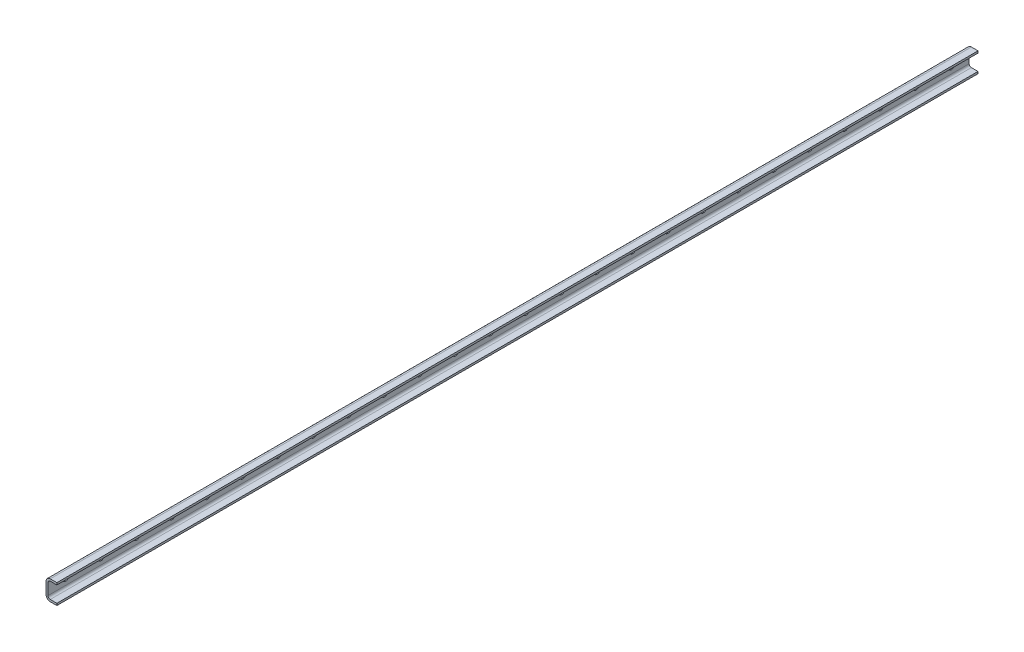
ISO-10303-21;
HEADER;
FILE_DESCRIPTION(('STEP AP214'),'2;1');
FILE_NAME('part.step','',(''),(''),'','','');
FILE_SCHEMA(('AUTOMOTIVE_DESIGN { 1 0 10303 214 1 1 1 1 }'));
ENDSEC;
DATA;
#1=APPLICATION_CONTEXT('core data for automotive mechanical design processes');
#2=APPLICATION_PROTOCOL_DEFINITION('international standard','automotive_design',2000,#1);
#3=PRODUCT_CONTEXT('',#1,'mechanical');
#4=PRODUCT('Part','Part','',(#3));
#5=PRODUCT_RELATED_PRODUCT_CATEGORY('part','',(#4));
#6=PRODUCT_DEFINITION_FORMATION('','',#4);
#7=PRODUCT_DEFINITION_CONTEXT('part definition',#1,'design');
#8=PRODUCT_DEFINITION('design','',#6,#7);
#9=PRODUCT_DEFINITION_SHAPE('','',#8);
#10=(LENGTH_UNIT() NAMED_UNIT(*) SI_UNIT(.MILLI.,.METRE.));
#11=(NAMED_UNIT(*) PLANE_ANGLE_UNIT() SI_UNIT($,.RADIAN.));
#12=(NAMED_UNIT(*) SI_UNIT($,.STERADIAN.) SOLID_ANGLE_UNIT());
#13=UNCERTAINTY_MEASURE_WITH_UNIT(LENGTH_MEASURE(1.E-05),#10,'distance_accuracy_value','');
#14=(GEOMETRIC_REPRESENTATION_CONTEXT(3) GLOBAL_UNCERTAINTY_ASSIGNED_CONTEXT((#13)) GLOBAL_UNIT_ASSIGNED_CONTEXT((#10,
#11,#12)) REPRESENTATION_CONTEXT('',''));
#15=CARTESIAN_POINT('',(0.,0.,0.));
#16=DIRECTION('',(0.,0.,1.));
#17=DIRECTION('',(1.,0.,0.));
#18=AXIS2_PLACEMENT_3D('',#15,#16,#17);
#19=CARTESIAN_POINT('',(9.5,17.9,-2080.));
#20=DIRECTION('',(0.,-1.,0.));
#21=DIRECTION('',(0.,0.,-1.));
#22=AXIS2_PLACEMENT_3D('',#19,#20,#21);
#23=PLANE('',#22);
#24=DIRECTION('',(1.,0.,0.));
#25=VECTOR('',#24,1.);
#26=CARTESIAN_POINT('',(9.5,17.9,0.));
#27=LINE('',#26,#25);
#28=CARTESIAN_POINT('',(9.5,17.9,0.));
#29=VERTEX_POINT('',#28);
#30=CARTESIAN_POINT('',(24.5,17.9,0.));
#31=VERTEX_POINT('',#30);
#32=EDGE_CURVE('E843',#29,#31,#27,.T.);
#33=ORIENTED_EDGE('',*,*,#32,.F.);
#34=DIRECTION('',(0.,0.,1.));
#35=VECTOR('',#34,1.);
#36=CARTESIAN_POINT('',(9.5,17.9,-2080.));
#37=LINE('',#36,#35);
#38=CARTESIAN_POINT('',(9.5,17.9,-2080.));
#39=VERTEX_POINT('',#38);
#40=EDGE_CURVE('E949',#39,#29,#37,.T.);
#41=ORIENTED_EDGE('',*,*,#40,.F.);
#42=DIRECTION('',(1.,0.,0.));
#43=VECTOR('',#42,1.);
#44=CARTESIAN_POINT('',(9.5,17.9,-2080.));
#45=LINE('',#44,#43);
#46=CARTESIAN_POINT('',(24.5,17.9,-2080.));
#47=VERTEX_POINT('',#46);
#48=EDGE_CURVE('E853',#39,#47,#45,.T.);
#49=ORIENTED_EDGE('',*,*,#48,.T.);
#50=DIRECTION('',(0.,0.,1.));
#51=VECTOR('',#50,1.);
#52=CARTESIAN_POINT('',(24.5,17.9,-2080.));
#53=LINE('',#52,#51);
#54=EDGE_CURVE('E902',#47,#31,#53,.T.);
#55=ORIENTED_EDGE('',*,*,#54,.T.);
#56=EDGE_LOOP('',(#33,#41,#49,#55));
#57=FACE_BOUND('',#56,.T.);
#58=ADVANCED_FACE('F39',(#57),#23,.T.);
#59=CARTESIAN_POINT('',(9.5,12.9,-2080.));
#60=DIRECTION('',(0.,0.,1.));
#61=DIRECTION('',(1.,0.,0.));
#62=AXIS2_PLACEMENT_3D('',#59,#60,#61);
#63=CYLINDRICAL_SURFACE('',#62,5.);
#64=CARTESIAN_POINT('',(9.5,12.9,0.));
#65=DIRECTION('',(0.,0.,-1.));
#66=DIRECTION('',(-1.,0.,0.));
#67=AXIS2_PLACEMENT_3D('',#64,#65,#66);
#68=CIRCLE('',#67,5.);
#69=CARTESIAN_POINT('',(4.5,12.9,0.));
#70=VERTEX_POINT('',#69);
#71=EDGE_CURVE('E858',#70,#29,#68,.T.);
#72=ORIENTED_EDGE('',*,*,#71,.F.);
#73=DIRECTION('',(0.,0.,1.));
#74=VECTOR('',#73,1.);
#75=CARTESIAN_POINT('',(4.5,12.9,-2080.));
#76=LINE('',#75,#74);
#77=CARTESIAN_POINT('',(4.5,12.9,-2080.));
#78=VERTEX_POINT('',#77);
#79=EDGE_CURVE('E953',#78,#70,#76,.T.);
#80=ORIENTED_EDGE('',*,*,#79,.F.);
#81=CARTESIAN_POINT('',(9.5,12.9,-2080.));
#82=DIRECTION('',(0.,0.,-1.));
#83=DIRECTION('',(-1.,0.,0.));
#84=AXIS2_PLACEMENT_3D('',#81,#82,#83);
#85=CIRCLE('',#84,5.);
#86=EDGE_CURVE('E898',#78,#39,#85,.T.);
#87=ORIENTED_EDGE('',*,*,#86,.T.);
#88=ORIENTED_EDGE('',*,*,#40,.T.);
#89=EDGE_LOOP('',(#72,#80,#87,#88));
#90=FACE_BOUND('',#89,.T.);
#91=ADVANCED_FACE('F2048',(#90),#63,.F.);
#92=CARTESIAN_POINT('',(4.5,-12.9,-2080.));
#93=DIRECTION('',(1.,0.,0.));
#94=DIRECTION('',(0.,0.,-1.));
#95=AXIS2_PLACEMENT_3D('',#92,#93,#94);
#96=PLANE('',#95);
#97=CARTESIAN_POINT('',(4.5,0.,-119.));
#98=DIRECTION('',(1.,0.,0.));
#99=DIRECTION('',(0.,0.,-1.));
#100=AXIS2_PLACEMENT_3D('',#97,#98,#99);
#101=CIRCLE('',#100,4.5);
#102=CARTESIAN_POINT('',(4.5,4.5,-119.));
#103=VERTEX_POINT('',#102);
#104=CARTESIAN_POINT('',(4.5,-4.5,-119.));
#105=VERTEX_POINT('',#104);
#106=EDGE_CURVE('E802',#103,#105,#101,.T.);
#107=ORIENTED_EDGE('',*,*,#106,.F.);
#108=DIRECTION('',(0.,0.,1.));
#109=VECTOR('',#108,1.);
#110=CARTESIAN_POINT('',(4.5,4.5,-119.));
#111=LINE('',#110,#109);
#112=CARTESIAN_POINT('',(4.5,4.5,-121.));
#113=VERTEX_POINT('',#112);
#114=EDGE_CURVE('E779',#113,#103,#111,.T.);
#115=ORIENTED_EDGE('',*,*,#114,.F.);
#116=CARTESIAN_POINT('',(4.5,0.,-121.));
#117=DIRECTION('',(1.,0.,0.));
#118=DIRECTION('',(0.,0.,1.));
#119=AXIS2_PLACEMENT_3D('',#116,#117,#118);
#120=CIRCLE('',#119,4.5);
#121=CARTESIAN_POINT('',(4.5,-4.5,-121.));
#122=VERTEX_POINT('',#121);
#123=EDGE_CURVE('E770',#122,#113,#120,.T.);
#124=ORIENTED_EDGE('',*,*,#123,.F.);
#125=DIRECTION('',(0.,0.,-1.));
#126=VECTOR('',#125,1.);
#127=CARTESIAN_POINT('',(4.5,-4.5,-119.));
#128=LINE('',#127,#126);
#129=EDGE_CURVE('E755',#105,#122,#128,.T.);
#130=ORIENTED_EDGE('',*,*,#129,.F.);
#131=EDGE_LOOP('',(#107,#115,#124,#130));
#132=FACE_BOUND('',#131,.T.);
#133=CARTESIAN_POINT('',(4.5,0.,-39.));
#134=DIRECTION('',(1.,0.,0.));
#135=DIRECTION('',(0.,0.,-1.));
#136=AXIS2_PLACEMENT_3D('',#133,#134,#135);
#137=CIRCLE('',#136,4.5);
#138=CARTESIAN_POINT('',(4.5,4.5,-39.));
#139=VERTEX_POINT('',#138);
#140=CARTESIAN_POINT('',(4.5,-4.5,-39.0000000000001));
#141=VERTEX_POINT('',#140);
#142=EDGE_CURVE('E809',#139,#141,#137,.T.);
#143=ORIENTED_EDGE('',*,*,#142,.F.);
#144=DIRECTION('',(0.,0.,1.));
#145=VECTOR('',#144,1.);
#146=CARTESIAN_POINT('',(4.5,4.5,-39.));
#147=LINE('',#146,#145);
#148=CARTESIAN_POINT('',(4.5,4.5,-41.));
#149=VERTEX_POINT('',#148);
#150=EDGE_CURVE('E815',#149,#139,#147,.T.);
#151=ORIENTED_EDGE('',*,*,#150,.F.);
#152=CARTESIAN_POINT('',(4.5,0.,-41.));
#153=DIRECTION('',(1.,0.,0.));
#154=DIRECTION('',(0.,0.,1.));
#155=AXIS2_PLACEMENT_3D('',#152,#153,#154);
#156=CIRCLE('',#155,4.5);
#157=CARTESIAN_POINT('',(4.5,-4.5,-41.));
#158=VERTEX_POINT('',#157);
#159=EDGE_CURVE('E834',#158,#149,#156,.T.);
#160=ORIENTED_EDGE('',*,*,#159,.F.);
#161=DIRECTION('',(0.,0.,-1.));
#162=VECTOR('',#161,1.);
#163=CARTESIAN_POINT('',(4.5,-4.5,-39.));
#164=LINE('',#163,#162);
#165=EDGE_CURVE('E830',#141,#158,#164,.T.);
#166=ORIENTED_EDGE('',*,*,#165,.F.);
#167=EDGE_LOOP('',(#143,#151,#160,#166));
#168=FACE_BOUND('',#167,.T.);
#169=DIRECTION('',(0.,1.,0.));
#170=VECTOR('',#169,1.);
#171=CARTESIAN_POINT('',(4.5,-12.9,0.));
#172=LINE('',#171,#170);
#173=CARTESIAN_POINT('',(4.5,-12.9,0.));
#174=VERTEX_POINT('',#173);
#175=EDGE_CURVE('E942',#174,#70,#172,.T.);
#176=ORIENTED_EDGE('',*,*,#175,.F.);
#177=DIRECTION('',(0.,0.,1.));
#178=VECTOR('',#177,1.);
#179=CARTESIAN_POINT('',(4.5,-12.9,-2080.));
#180=LINE('',#179,#178);
#181=CARTESIAN_POINT('',(4.5,-12.9,-2080.));
#182=VERTEX_POINT('',#181);
#183=EDGE_CURVE('E956',#182,#174,#180,.T.);
#184=ORIENTED_EDGE('',*,*,#183,.F.);
#185=DIRECTION('',(0.,1.,0.));
#186=VECTOR('',#185,1.);
#187=CARTESIAN_POINT('',(4.5,-12.9,-2080.));
#188=LINE('',#187,#186);
#189=EDGE_CURVE('E894',#182,#78,#188,.T.);
#190=ORIENTED_EDGE('',*,*,#189,.T.);
#191=ORIENTED_EDGE('',*,*,#79,.T.);
#192=EDGE_LOOP('',(#176,#184,#190,#191));
#193=FACE_BOUND('',#192,.T.);
#194=CARTESIAN_POINT('',(4.5,0.,-199.));
#195=DIRECTION('',(1.,0.,0.));
#196=DIRECTION('',(0.,0.,-1.));
#197=AXIS2_PLACEMENT_3D('',#194,#195,#196);
#198=CIRCLE('',#197,4.5);
#199=CARTESIAN_POINT('',(4.5,4.5,-199.));
#200=VERTEX_POINT('',#199);
#201=CARTESIAN_POINT('',(4.5,-4.5,-199.));
#202=VERTEX_POINT('',#201);
#203=EDGE_CURVE('E952',#200,#202,#198,.T.);
#204=ORIENTED_EDGE('',*,*,#203,.F.);
#205=DIRECTION('',(0.,0.,1.));
#206=VECTOR('',#205,1.);
#207=CARTESIAN_POINT('',(4.5,4.5,-199.));
#208=LINE('',#207,#206);
#209=CARTESIAN_POINT('',(4.5,4.5,-201.));
#210=VERTEX_POINT('',#209);
#211=EDGE_CURVE('E987',#210,#200,#208,.T.);
#212=ORIENTED_EDGE('',*,*,#211,.F.);
#213=CARTESIAN_POINT('',(4.5,0.,-201.));
#214=DIRECTION('',(1.,0.,0.));
#215=DIRECTION('',(0.,0.,1.));
#216=AXIS2_PLACEMENT_3D('',#213,#214,#215);
#217=CIRCLE('',#216,4.5);
#218=CARTESIAN_POINT('',(4.5,-4.5,-201.));
#219=VERTEX_POINT('',#218);
#220=EDGE_CURVE('E991',#219,#210,#217,.T.);
#221=ORIENTED_EDGE('',*,*,#220,.F.);
#222=DIRECTION('',(0.,0.,-1.));
#223=VECTOR('',#222,1.);
#224=CARTESIAN_POINT('',(4.5,-4.5,-199.));
#225=LINE('',#224,#223);
#226=EDGE_CURVE('E995',#202,#219,#225,.T.);
#227=ORIENTED_EDGE('',*,*,#226,.F.);
#228=EDGE_LOOP('',(#204,#212,#221,#227));
#229=FACE_BOUND('',#228,.T.);
#230=CARTESIAN_POINT('',(4.5,0.,-279.));
#231=DIRECTION('',(1.,0.,0.));
#232=DIRECTION('',(0.,0.,-1.));
#233=AXIS2_PLACEMENT_3D('',#230,#231,#232);
#234=CIRCLE('',#233,4.5);
#235=CARTESIAN_POINT('',(4.5,4.5,-279.));
#236=VERTEX_POINT('',#235);
#237=CARTESIAN_POINT('',(4.5,-4.5,-279.));
#238=VERTEX_POINT('',#237);
#239=EDGE_CURVE('E1028',#236,#238,#234,.T.);
#240=ORIENTED_EDGE('',*,*,#239,.F.);
#241=DIRECTION('',(0.,0.,1.));
#242=VECTOR('',#241,1.);
#243=CARTESIAN_POINT('',(4.5,4.5,-279.));
#244=LINE('',#243,#242);
#245=CARTESIAN_POINT('',(4.5,4.5,-281.));
#246=VERTEX_POINT('',#245);
#247=EDGE_CURVE('E1031',#246,#236,#244,.T.);
#248=ORIENTED_EDGE('',*,*,#247,.F.);
#249=CARTESIAN_POINT('',(4.5,0.,-281.));
#250=DIRECTION('',(1.,0.,0.));
#251=DIRECTION('',(0.,0.,1.));
#252=AXIS2_PLACEMENT_3D('',#249,#250,#251);
#253=CIRCLE('',#252,4.5);
#254=CARTESIAN_POINT('',(4.5,-4.5,-281.));
#255=VERTEX_POINT('',#254);
#256=EDGE_CURVE('E1035',#255,#246,#253,.T.);
#257=ORIENTED_EDGE('',*,*,#256,.F.);
#258=DIRECTION('',(0.,0.,-1.));
#259=VECTOR('',#258,1.);
#260=CARTESIAN_POINT('',(4.5,-4.5,-279.));
#261=LINE('',#260,#259);
#262=EDGE_CURVE('E1039',#238,#255,#261,.T.);
#263=ORIENTED_EDGE('',*,*,#262,.F.);
#264=EDGE_LOOP('',(#240,#248,#257,#263));
#265=FACE_BOUND('',#264,.T.);
#266=CARTESIAN_POINT('',(4.5,0.,-359.));
#267=DIRECTION('',(1.,0.,0.));
#268=DIRECTION('',(0.,0.,-1.));
#269=AXIS2_PLACEMENT_3D('',#266,#267,#268);
#270=CIRCLE('',#269,4.5);
#271=CARTESIAN_POINT('',(4.5,4.5,-359.));
#272=VERTEX_POINT('',#271);
#273=CARTESIAN_POINT('',(4.5,-4.5,-359.));
#274=VERTEX_POINT('',#273);
#275=EDGE_CURVE('E1072',#272,#274,#270,.T.);
#276=ORIENTED_EDGE('',*,*,#275,.F.);
#277=DIRECTION('',(0.,0.,1.));
#278=VECTOR('',#277,1.);
#279=CARTESIAN_POINT('',(4.5,4.5,-359.));
#280=LINE('',#279,#278);
#281=CARTESIAN_POINT('',(4.5,4.5,-361.));
#282=VERTEX_POINT('',#281);
#283=EDGE_CURVE('E1075',#282,#272,#280,.T.);
#284=ORIENTED_EDGE('',*,*,#283,.F.);
#285=CARTESIAN_POINT('',(4.5,0.,-361.));
#286=DIRECTION('',(1.,0.,0.));
#287=DIRECTION('',(0.,0.,1.));
#288=AXIS2_PLACEMENT_3D('',#285,#286,#287);
#289=CIRCLE('',#288,4.5);
#290=CARTESIAN_POINT('',(4.5,-4.5,-361.));
#291=VERTEX_POINT('',#290);
#292=EDGE_CURVE('E1079',#291,#282,#289,.T.);
#293=ORIENTED_EDGE('',*,*,#292,.F.);
#294=DIRECTION('',(0.,0.,-1.));
#295=VECTOR('',#294,1.);
#296=CARTESIAN_POINT('',(4.5,-4.5,-359.));
#297=LINE('',#296,#295);
#298=EDGE_CURVE('E1083',#274,#291,#297,.T.);
#299=ORIENTED_EDGE('',*,*,#298,.F.);
#300=EDGE_LOOP('',(#276,#284,#293,#299));
#301=FACE_BOUND('',#300,.T.);
#302=CARTESIAN_POINT('',(4.5,0.,-439.));
#303=DIRECTION('',(1.,0.,0.));
#304=DIRECTION('',(0.,0.,-1.));
#305=AXIS2_PLACEMENT_3D('',#302,#303,#304);
#306=CIRCLE('',#305,4.5);
#307=CARTESIAN_POINT('',(4.5,4.5,-439.));
#308=VERTEX_POINT('',#307);
#309=CARTESIAN_POINT('',(4.5,-4.5,-439.));
#310=VERTEX_POINT('',#309);
#311=EDGE_CURVE('E1116',#308,#310,#306,.T.);
#312=ORIENTED_EDGE('',*,*,#311,.F.);
#313=DIRECTION('',(0.,0.,1.));
#314=VECTOR('',#313,1.);
#315=CARTESIAN_POINT('',(4.5,4.5,-439.));
#316=LINE('',#315,#314);
#317=CARTESIAN_POINT('',(4.5,4.5,-441.));
#318=VERTEX_POINT('',#317);
#319=EDGE_CURVE('E1119',#318,#308,#316,.T.);
#320=ORIENTED_EDGE('',*,*,#319,.F.);
#321=CARTESIAN_POINT('',(4.5,0.,-441.));
#322=DIRECTION('',(1.,0.,0.));
#323=DIRECTION('',(0.,0.,1.));
#324=AXIS2_PLACEMENT_3D('',#321,#322,#323);
#325=CIRCLE('',#324,4.5);
#326=CARTESIAN_POINT('',(4.5,-4.5,-441.));
#327=VERTEX_POINT('',#326);
#328=EDGE_CURVE('E1123',#327,#318,#325,.T.);
#329=ORIENTED_EDGE('',*,*,#328,.F.);
#330=DIRECTION('',(0.,0.,-1.));
#331=VECTOR('',#330,1.);
#332=CARTESIAN_POINT('',(4.5,-4.5,-439.));
#333=LINE('',#332,#331);
#334=EDGE_CURVE('E1127',#310,#327,#333,.T.);
#335=ORIENTED_EDGE('',*,*,#334,.F.);
#336=EDGE_LOOP('',(#312,#320,#329,#335));
#337=FACE_BOUND('',#336,.T.);
#338=CARTESIAN_POINT('',(4.5,0.,-519.));
#339=DIRECTION('',(1.,0.,0.));
#340=DIRECTION('',(0.,0.,-1.));
#341=AXIS2_PLACEMENT_3D('',#338,#339,#340);
#342=CIRCLE('',#341,4.5);
#343=CARTESIAN_POINT('',(4.5,4.5,-519.));
#344=VERTEX_POINT('',#343);
#345=CARTESIAN_POINT('',(4.5,-4.5,-519.));
#346=VERTEX_POINT('',#345);
#347=EDGE_CURVE('E1160',#344,#346,#342,.T.);
#348=ORIENTED_EDGE('',*,*,#347,.F.);
#349=DIRECTION('',(0.,0.,1.));
#350=VECTOR('',#349,1.);
#351=CARTESIAN_POINT('',(4.5,4.5,-519.));
#352=LINE('',#351,#350);
#353=CARTESIAN_POINT('',(4.5,4.5,-521.));
#354=VERTEX_POINT('',#353);
#355=EDGE_CURVE('E1163',#354,#344,#352,.T.);
#356=ORIENTED_EDGE('',*,*,#355,.F.);
#357=CARTESIAN_POINT('',(4.5,0.,-521.));
#358=DIRECTION('',(1.,0.,0.));
#359=DIRECTION('',(0.,0.,1.));
#360=AXIS2_PLACEMENT_3D('',#357,#358,#359);
#361=CIRCLE('',#360,4.5);
#362=CARTESIAN_POINT('',(4.5,-4.5,-521.));
#363=VERTEX_POINT('',#362);
#364=EDGE_CURVE('E1167',#363,#354,#361,.T.);
#365=ORIENTED_EDGE('',*,*,#364,.F.);
#366=DIRECTION('',(0.,0.,-1.));
#367=VECTOR('',#366,1.);
#368=CARTESIAN_POINT('',(4.5,-4.5,-519.));
#369=LINE('',#368,#367);
#370=EDGE_CURVE('E1171',#346,#363,#369,.T.);
#371=ORIENTED_EDGE('',*,*,#370,.F.);
#372=EDGE_LOOP('',(#348,#356,#365,#371));
#373=FACE_BOUND('',#372,.T.);
#374=CARTESIAN_POINT('',(4.5,0.,-599.));
#375=DIRECTION('',(1.,0.,0.));
#376=DIRECTION('',(0.,0.,-1.));
#377=AXIS2_PLACEMENT_3D('',#374,#375,#376);
#378=CIRCLE('',#377,4.5);
#379=CARTESIAN_POINT('',(4.5,4.5,-599.));
#380=VERTEX_POINT('',#379);
#381=CARTESIAN_POINT('',(4.5,-4.5,-599.));
#382=VERTEX_POINT('',#381);
#383=EDGE_CURVE('E1204',#380,#382,#378,.T.);
#384=ORIENTED_EDGE('',*,*,#383,.F.);
#385=DIRECTION('',(0.,0.,1.));
#386=VECTOR('',#385,1.);
#387=CARTESIAN_POINT('',(4.5,4.5,-599.));
#388=LINE('',#387,#386);
#389=CARTESIAN_POINT('',(4.5,4.5,-601.));
#390=VERTEX_POINT('',#389);
#391=EDGE_CURVE('E1207',#390,#380,#388,.T.);
#392=ORIENTED_EDGE('',*,*,#391,.F.);
#393=CARTESIAN_POINT('',(4.5,0.,-601.));
#394=DIRECTION('',(1.,0.,0.));
#395=DIRECTION('',(0.,0.,1.));
#396=AXIS2_PLACEMENT_3D('',#393,#394,#395);
#397=CIRCLE('',#396,4.5);
#398=CARTESIAN_POINT('',(4.5,-4.5,-601.));
#399=VERTEX_POINT('',#398);
#400=EDGE_CURVE('E1211',#399,#390,#397,.T.);
#401=ORIENTED_EDGE('',*,*,#400,.F.);
#402=DIRECTION('',(0.,0.,-1.));
#403=VECTOR('',#402,1.);
#404=CARTESIAN_POINT('',(4.5,-4.5,-599.));
#405=LINE('',#404,#403);
#406=EDGE_CURVE('E1215',#382,#399,#405,.T.);
#407=ORIENTED_EDGE('',*,*,#406,.F.);
#408=EDGE_LOOP('',(#384,#392,#401,#407));
#409=FACE_BOUND('',#408,.T.);
#410=CARTESIAN_POINT('',(4.5,0.,-679.));
#411=DIRECTION('',(1.,0.,0.));
#412=DIRECTION('',(0.,0.,-1.));
#413=AXIS2_PLACEMENT_3D('',#410,#411,#412);
#414=CIRCLE('',#413,4.5);
#415=CARTESIAN_POINT('',(4.5,4.5,-679.));
#416=VERTEX_POINT('',#415);
#417=CARTESIAN_POINT('',(4.5,-4.5,-679.));
#418=VERTEX_POINT('',#417);
#419=EDGE_CURVE('E1248',#416,#418,#414,.T.);
#420=ORIENTED_EDGE('',*,*,#419,.F.);
#421=DIRECTION('',(0.,0.,1.));
#422=VECTOR('',#421,1.);
#423=CARTESIAN_POINT('',(4.5,4.5,-679.));
#424=LINE('',#423,#422);
#425=CARTESIAN_POINT('',(4.5,4.5,-681.));
#426=VERTEX_POINT('',#425);
#427=EDGE_CURVE('E1251',#426,#416,#424,.T.);
#428=ORIENTED_EDGE('',*,*,#427,.F.);
#429=CARTESIAN_POINT('',(4.5,0.,-681.));
#430=DIRECTION('',(1.,0.,0.));
#431=DIRECTION('',(0.,0.,1.));
#432=AXIS2_PLACEMENT_3D('',#429,#430,#431);
#433=CIRCLE('',#432,4.5);
#434=CARTESIAN_POINT('',(4.5,-4.5,-681.));
#435=VERTEX_POINT('',#434);
#436=EDGE_CURVE('E1255',#435,#426,#433,.T.);
#437=ORIENTED_EDGE('',*,*,#436,.F.);
#438=DIRECTION('',(0.,0.,-1.));
#439=VECTOR('',#438,1.);
#440=CARTESIAN_POINT('',(4.5,-4.5,-679.));
#441=LINE('',#440,#439);
#442=EDGE_CURVE('E1259',#418,#435,#441,.T.);
#443=ORIENTED_EDGE('',*,*,#442,.F.);
#444=EDGE_LOOP('',(#420,#428,#437,#443));
#445=FACE_BOUND('',#444,.T.);
#446=CARTESIAN_POINT('',(4.5,0.,-759.));
#447=DIRECTION('',(1.,0.,0.));
#448=DIRECTION('',(0.,0.,-1.));
#449=AXIS2_PLACEMENT_3D('',#446,#447,#448);
#450=CIRCLE('',#449,4.5);
#451=CARTESIAN_POINT('',(4.5,4.5,-759.));
#452=VERTEX_POINT('',#451);
#453=CARTESIAN_POINT('',(4.5,-4.5,-759.));
#454=VERTEX_POINT('',#453);
#455=EDGE_CURVE('E1292',#452,#454,#450,.T.);
#456=ORIENTED_EDGE('',*,*,#455,.F.);
#457=DIRECTION('',(0.,0.,1.));
#458=VECTOR('',#457,1.);
#459=CARTESIAN_POINT('',(4.5,4.5,-759.));
#460=LINE('',#459,#458);
#461=CARTESIAN_POINT('',(4.5,4.5,-761.));
#462=VERTEX_POINT('',#461);
#463=EDGE_CURVE('E1295',#462,#452,#460,.T.);
#464=ORIENTED_EDGE('',*,*,#463,.F.);
#465=CARTESIAN_POINT('',(4.5,0.,-761.));
#466=DIRECTION('',(1.,0.,0.));
#467=DIRECTION('',(0.,0.,1.));
#468=AXIS2_PLACEMENT_3D('',#465,#466,#467);
#469=CIRCLE('',#468,4.5);
#470=CARTESIAN_POINT('',(4.5,-4.5,-761.));
#471=VERTEX_POINT('',#470);
#472=EDGE_CURVE('E1299',#471,#462,#469,.T.);
#473=ORIENTED_EDGE('',*,*,#472,.F.);
#474=DIRECTION('',(0.,0.,-1.));
#475=VECTOR('',#474,1.);
#476=CARTESIAN_POINT('',(4.5,-4.5,-759.));
#477=LINE('',#476,#475);
#478=EDGE_CURVE('E1303',#454,#471,#477,.T.);
#479=ORIENTED_EDGE('',*,*,#478,.F.);
#480=EDGE_LOOP('',(#456,#464,#473,#479));
#481=FACE_BOUND('',#480,.T.);
#482=CARTESIAN_POINT('',(4.5,0.,-839.));
#483=DIRECTION('',(1.,0.,0.));
#484=DIRECTION('',(0.,0.,-1.));
#485=AXIS2_PLACEMENT_3D('',#482,#483,#484);
#486=CIRCLE('',#485,4.5);
#487=CARTESIAN_POINT('',(4.5,4.5,-839.));
#488=VERTEX_POINT('',#487);
#489=CARTESIAN_POINT('',(4.5,-4.5,-839.));
#490=VERTEX_POINT('',#489);
#491=EDGE_CURVE('E1336',#488,#490,#486,.T.);
#492=ORIENTED_EDGE('',*,*,#491,.F.);
#493=DIRECTION('',(0.,0.,1.));
#494=VECTOR('',#493,1.);
#495=CARTESIAN_POINT('',(4.5,4.5,-839.));
#496=LINE('',#495,#494);
#497=CARTESIAN_POINT('',(4.5,4.5,-841.));
#498=VERTEX_POINT('',#497);
#499=EDGE_CURVE('E1339',#498,#488,#496,.T.);
#500=ORIENTED_EDGE('',*,*,#499,.F.);
#501=CARTESIAN_POINT('',(4.5,0.,-841.));
#502=DIRECTION('',(1.,0.,0.));
#503=DIRECTION('',(0.,0.,1.));
#504=AXIS2_PLACEMENT_3D('',#501,#502,#503);
#505=CIRCLE('',#504,4.5);
#506=CARTESIAN_POINT('',(4.5,-4.5,-841.));
#507=VERTEX_POINT('',#506);
#508=EDGE_CURVE('E1343',#507,#498,#505,.T.);
#509=ORIENTED_EDGE('',*,*,#508,.F.);
#510=DIRECTION('',(0.,0.,-1.));
#511=VECTOR('',#510,1.);
#512=CARTESIAN_POINT('',(4.5,-4.5,-839.));
#513=LINE('',#512,#511);
#514=EDGE_CURVE('E1347',#490,#507,#513,.T.);
#515=ORIENTED_EDGE('',*,*,#514,.F.);
#516=EDGE_LOOP('',(#492,#500,#509,#515));
#517=FACE_BOUND('',#516,.T.);
#518=CARTESIAN_POINT('',(4.5,0.,-919.));
#519=DIRECTION('',(1.,0.,0.));
#520=DIRECTION('',(0.,0.,-1.));
#521=AXIS2_PLACEMENT_3D('',#518,#519,#520);
#522=CIRCLE('',#521,4.5);
#523=CARTESIAN_POINT('',(4.5,4.5,-919.));
#524=VERTEX_POINT('',#523);
#525=CARTESIAN_POINT('',(4.5,-4.5,-919.));
#526=VERTEX_POINT('',#525);
#527=EDGE_CURVE('E1380',#524,#526,#522,.T.);
#528=ORIENTED_EDGE('',*,*,#527,.F.);
#529=DIRECTION('',(0.,0.,1.));
#530=VECTOR('',#529,1.);
#531=CARTESIAN_POINT('',(4.5,4.5,-919.));
#532=LINE('',#531,#530);
#533=CARTESIAN_POINT('',(4.5,4.5,-921.));
#534=VERTEX_POINT('',#533);
#535=EDGE_CURVE('E1383',#534,#524,#532,.T.);
#536=ORIENTED_EDGE('',*,*,#535,.F.);
#537=CARTESIAN_POINT('',(4.5,0.,-921.));
#538=DIRECTION('',(1.,0.,0.));
#539=DIRECTION('',(0.,0.,1.));
#540=AXIS2_PLACEMENT_3D('',#537,#538,#539);
#541=CIRCLE('',#540,4.5);
#542=CARTESIAN_POINT('',(4.5,-4.5,-921.));
#543=VERTEX_POINT('',#542);
#544=EDGE_CURVE('E1387',#543,#534,#541,.T.);
#545=ORIENTED_EDGE('',*,*,#544,.F.);
#546=DIRECTION('',(0.,0.,-1.));
#547=VECTOR('',#546,1.);
#548=CARTESIAN_POINT('',(4.5,-4.5,-919.));
#549=LINE('',#548,#547);
#550=EDGE_CURVE('E1391',#526,#543,#549,.T.);
#551=ORIENTED_EDGE('',*,*,#550,.F.);
#552=EDGE_LOOP('',(#528,#536,#545,#551));
#553=FACE_BOUND('',#552,.T.);
#554=CARTESIAN_POINT('',(4.5,0.,-999.));
#555=DIRECTION('',(1.,0.,0.));
#556=DIRECTION('',(0.,0.,-1.));
#557=AXIS2_PLACEMENT_3D('',#554,#555,#556);
#558=CIRCLE('',#557,4.5);
#559=CARTESIAN_POINT('',(4.5,4.5,-999.));
#560=VERTEX_POINT('',#559);
#561=CARTESIAN_POINT('',(4.5,-4.5,-999.));
#562=VERTEX_POINT('',#561);
#563=EDGE_CURVE('E1424',#560,#562,#558,.T.);
#564=ORIENTED_EDGE('',*,*,#563,.F.);
#565=DIRECTION('',(0.,0.,1.));
#566=VECTOR('',#565,1.);
#567=CARTESIAN_POINT('',(4.5,4.5,-999.));
#568=LINE('',#567,#566);
#569=CARTESIAN_POINT('',(4.5,4.5,-1001.));
#570=VERTEX_POINT('',#569);
#571=EDGE_CURVE('E1427',#570,#560,#568,.T.);
#572=ORIENTED_EDGE('',*,*,#571,.F.);
#573=CARTESIAN_POINT('',(4.5,0.,-1001.));
#574=DIRECTION('',(1.,0.,0.));
#575=DIRECTION('',(0.,0.,1.));
#576=AXIS2_PLACEMENT_3D('',#573,#574,#575);
#577=CIRCLE('',#576,4.5);
#578=CARTESIAN_POINT('',(4.5,-4.5,-1001.));
#579=VERTEX_POINT('',#578);
#580=EDGE_CURVE('E1431',#579,#570,#577,.T.);
#581=ORIENTED_EDGE('',*,*,#580,.F.);
#582=DIRECTION('',(0.,0.,-1.));
#583=VECTOR('',#582,1.);
#584=CARTESIAN_POINT('',(4.5,-4.5,-999.));
#585=LINE('',#584,#583);
#586=EDGE_CURVE('E1435',#562,#579,#585,.T.);
#587=ORIENTED_EDGE('',*,*,#586,.F.);
#588=EDGE_LOOP('',(#564,#572,#581,#587));
#589=FACE_BOUND('',#588,.T.);
#590=CARTESIAN_POINT('',(4.5,0.,-1079.));
#591=DIRECTION('',(1.,0.,0.));
#592=DIRECTION('',(0.,0.,-1.));
#593=AXIS2_PLACEMENT_3D('',#590,#591,#592);
#594=CIRCLE('',#593,4.5);
#595=CARTESIAN_POINT('',(4.5,4.5,-1079.));
#596=VERTEX_POINT('',#595);
#597=CARTESIAN_POINT('',(4.5,-4.5,-1079.));
#598=VERTEX_POINT('',#597);
#599=EDGE_CURVE('E1468',#596,#598,#594,.T.);
#600=ORIENTED_EDGE('',*,*,#599,.F.);
#601=DIRECTION('',(0.,0.,1.));
#602=VECTOR('',#601,1.);
#603=CARTESIAN_POINT('',(4.5,4.5,-1079.));
#604=LINE('',#603,#602);
#605=CARTESIAN_POINT('',(4.5,4.5,-1081.));
#606=VERTEX_POINT('',#605);
#607=EDGE_CURVE('E1471',#606,#596,#604,.T.);
#608=ORIENTED_EDGE('',*,*,#607,.F.);
#609=CARTESIAN_POINT('',(4.5,0.,-1081.));
#610=DIRECTION('',(1.,0.,0.));
#611=DIRECTION('',(0.,0.,1.));
#612=AXIS2_PLACEMENT_3D('',#609,#610,#611);
#613=CIRCLE('',#612,4.5);
#614=CARTESIAN_POINT('',(4.5,-4.5,-1081.));
#615=VERTEX_POINT('',#614);
#616=EDGE_CURVE('E1475',#615,#606,#613,.T.);
#617=ORIENTED_EDGE('',*,*,#616,.F.);
#618=DIRECTION('',(0.,0.,-1.));
#619=VECTOR('',#618,1.);
#620=CARTESIAN_POINT('',(4.5,-4.5,-1079.));
#621=LINE('',#620,#619);
#622=EDGE_CURVE('E1479',#598,#615,#621,.T.);
#623=ORIENTED_EDGE('',*,*,#622,.F.);
#624=EDGE_LOOP('',(#600,#608,#617,#623));
#625=FACE_BOUND('',#624,.T.);
#626=CARTESIAN_POINT('',(4.5,0.,-1159.));
#627=DIRECTION('',(1.,0.,0.));
#628=DIRECTION('',(0.,0.,-1.));
#629=AXIS2_PLACEMENT_3D('',#626,#627,#628);
#630=CIRCLE('',#629,4.5);
#631=CARTESIAN_POINT('',(4.5,4.5,-1159.));
#632=VERTEX_POINT('',#631);
#633=CARTESIAN_POINT('',(4.5,-4.5,-1159.));
#634=VERTEX_POINT('',#633);
#635=EDGE_CURVE('E1512',#632,#634,#630,.T.);
#636=ORIENTED_EDGE('',*,*,#635,.F.);
#637=DIRECTION('',(0.,0.,1.));
#638=VECTOR('',#637,1.);
#639=CARTESIAN_POINT('',(4.5,4.5,-1159.));
#640=LINE('',#639,#638);
#641=CARTESIAN_POINT('',(4.5,4.5,-1161.));
#642=VERTEX_POINT('',#641);
#643=EDGE_CURVE('E1515',#642,#632,#640,.T.);
#644=ORIENTED_EDGE('',*,*,#643,.F.);
#645=CARTESIAN_POINT('',(4.5,0.,-1161.));
#646=DIRECTION('',(1.,0.,0.));
#647=DIRECTION('',(0.,0.,1.));
#648=AXIS2_PLACEMENT_3D('',#645,#646,#647);
#649=CIRCLE('',#648,4.5);
#650=CARTESIAN_POINT('',(4.5,-4.5,-1161.));
#651=VERTEX_POINT('',#650);
#652=EDGE_CURVE('E1519',#651,#642,#649,.T.);
#653=ORIENTED_EDGE('',*,*,#652,.F.);
#654=DIRECTION('',(0.,0.,-1.));
#655=VECTOR('',#654,1.);
#656=CARTESIAN_POINT('',(4.5,-4.5,-1159.));
#657=LINE('',#656,#655);
#658=EDGE_CURVE('E1523',#634,#651,#657,.T.);
#659=ORIENTED_EDGE('',*,*,#658,.F.);
#660=EDGE_LOOP('',(#636,#644,#653,#659));
#661=FACE_BOUND('',#660,.T.);
#662=CARTESIAN_POINT('',(4.5,0.,-1239.));
#663=DIRECTION('',(1.,0.,0.));
#664=DIRECTION('',(0.,0.,-1.));
#665=AXIS2_PLACEMENT_3D('',#662,#663,#664);
#666=CIRCLE('',#665,4.5);
#667=CARTESIAN_POINT('',(4.5,4.5,-1239.));
#668=VERTEX_POINT('',#667);
#669=CARTESIAN_POINT('',(4.5,-4.5,-1239.));
#670=VERTEX_POINT('',#669);
#671=EDGE_CURVE('E1556',#668,#670,#666,.T.);
#672=ORIENTED_EDGE('',*,*,#671,.F.);
#673=DIRECTION('',(0.,0.,1.));
#674=VECTOR('',#673,1.);
#675=CARTESIAN_POINT('',(4.5,4.5,-1239.));
#676=LINE('',#675,#674);
#677=CARTESIAN_POINT('',(4.5,4.5,-1241.));
#678=VERTEX_POINT('',#677);
#679=EDGE_CURVE('E1559',#678,#668,#676,.T.);
#680=ORIENTED_EDGE('',*,*,#679,.F.);
#681=CARTESIAN_POINT('',(4.5,0.,-1241.));
#682=DIRECTION('',(1.,0.,0.));
#683=DIRECTION('',(0.,0.,1.));
#684=AXIS2_PLACEMENT_3D('',#681,#682,#683);
#685=CIRCLE('',#684,4.5);
#686=CARTESIAN_POINT('',(4.5,-4.5,-1241.));
#687=VERTEX_POINT('',#686);
#688=EDGE_CURVE('E1563',#687,#678,#685,.T.);
#689=ORIENTED_EDGE('',*,*,#688,.F.);
#690=DIRECTION('',(0.,0.,-1.));
#691=VECTOR('',#690,1.);
#692=CARTESIAN_POINT('',(4.5,-4.5,-1239.));
#693=LINE('',#692,#691);
#694=EDGE_CURVE('E1567',#670,#687,#693,.T.);
#695=ORIENTED_EDGE('',*,*,#694,.F.);
#696=EDGE_LOOP('',(#672,#680,#689,#695));
#697=FACE_BOUND('',#696,.T.);
#698=CARTESIAN_POINT('',(4.5,0.,-1319.));
#699=DIRECTION('',(1.,0.,0.));
#700=DIRECTION('',(0.,0.,-1.));
#701=AXIS2_PLACEMENT_3D('',#698,#699,#700);
#702=CIRCLE('',#701,4.5);
#703=CARTESIAN_POINT('',(4.5,4.5,-1319.));
#704=VERTEX_POINT('',#703);
#705=CARTESIAN_POINT('',(4.5,-4.5,-1319.));
#706=VERTEX_POINT('',#705);
#707=EDGE_CURVE('E1600',#704,#706,#702,.T.);
#708=ORIENTED_EDGE('',*,*,#707,.F.);
#709=DIRECTION('',(0.,0.,1.));
#710=VECTOR('',#709,1.);
#711=CARTESIAN_POINT('',(4.5,4.5,-1319.));
#712=LINE('',#711,#710);
#713=CARTESIAN_POINT('',(4.5,4.5,-1321.));
#714=VERTEX_POINT('',#713);
#715=EDGE_CURVE('E1603',#714,#704,#712,.T.);
#716=ORIENTED_EDGE('',*,*,#715,.F.);
#717=CARTESIAN_POINT('',(4.5,0.,-1321.));
#718=DIRECTION('',(1.,0.,0.));
#719=DIRECTION('',(0.,0.,1.));
#720=AXIS2_PLACEMENT_3D('',#717,#718,#719);
#721=CIRCLE('',#720,4.5);
#722=CARTESIAN_POINT('',(4.5,-4.5,-1321.));
#723=VERTEX_POINT('',#722);
#724=EDGE_CURVE('E1607',#723,#714,#721,.T.);
#725=ORIENTED_EDGE('',*,*,#724,.F.);
#726=DIRECTION('',(0.,0.,-1.));
#727=VECTOR('',#726,1.);
#728=CARTESIAN_POINT('',(4.5,-4.5,-1319.));
#729=LINE('',#728,#727);
#730=EDGE_CURVE('E1611',#706,#723,#729,.T.);
#731=ORIENTED_EDGE('',*,*,#730,.F.);
#732=EDGE_LOOP('',(#708,#716,#725,#731));
#733=FACE_BOUND('',#732,.T.);
#734=CARTESIAN_POINT('',(4.5,0.,-1399.));
#735=DIRECTION('',(1.,0.,0.));
#736=DIRECTION('',(0.,0.,-1.));
#737=AXIS2_PLACEMENT_3D('',#734,#735,#736);
#738=CIRCLE('',#737,4.5);
#739=CARTESIAN_POINT('',(4.5,4.5,-1399.));
#740=VERTEX_POINT('',#739);
#741=CARTESIAN_POINT('',(4.5,-4.5,-1399.));
#742=VERTEX_POINT('',#741);
#743=EDGE_CURVE('E1644',#740,#742,#738,.T.);
#744=ORIENTED_EDGE('',*,*,#743,.F.);
#745=DIRECTION('',(0.,0.,1.));
#746=VECTOR('',#745,1.);
#747=CARTESIAN_POINT('',(4.5,4.5,-1399.));
#748=LINE('',#747,#746);
#749=CARTESIAN_POINT('',(4.5,4.5,-1401.));
#750=VERTEX_POINT('',#749);
#751=EDGE_CURVE('E1647',#750,#740,#748,.T.);
#752=ORIENTED_EDGE('',*,*,#751,.F.);
#753=CARTESIAN_POINT('',(4.5,0.,-1401.));
#754=DIRECTION('',(1.,0.,0.));
#755=DIRECTION('',(0.,0.,1.));
#756=AXIS2_PLACEMENT_3D('',#753,#754,#755);
#757=CIRCLE('',#756,4.5);
#758=CARTESIAN_POINT('',(4.5,-4.5,-1401.));
#759=VERTEX_POINT('',#758);
#760=EDGE_CURVE('E1651',#759,#750,#757,.T.);
#761=ORIENTED_EDGE('',*,*,#760,.F.);
#762=DIRECTION('',(0.,0.,-1.));
#763=VECTOR('',#762,1.);
#764=CARTESIAN_POINT('',(4.5,-4.5,-1399.));
#765=LINE('',#764,#763);
#766=EDGE_CURVE('E1655',#742,#759,#765,.T.);
#767=ORIENTED_EDGE('',*,*,#766,.F.);
#768=EDGE_LOOP('',(#744,#752,#761,#767));
#769=FACE_BOUND('',#768,.T.);
#770=CARTESIAN_POINT('',(4.5,0.,-1479.));
#771=DIRECTION('',(1.,0.,0.));
#772=DIRECTION('',(0.,0.,-1.));
#773=AXIS2_PLACEMENT_3D('',#770,#771,#772);
#774=CIRCLE('',#773,4.5);
#775=CARTESIAN_POINT('',(4.5,4.5,-1479.));
#776=VERTEX_POINT('',#775);
#777=CARTESIAN_POINT('',(4.5,-4.5,-1479.));
#778=VERTEX_POINT('',#777);
#779=EDGE_CURVE('E1688',#776,#778,#774,.T.);
#780=ORIENTED_EDGE('',*,*,#779,.F.);
#781=DIRECTION('',(0.,0.,1.));
#782=VECTOR('',#781,1.);
#783=CARTESIAN_POINT('',(4.5,4.5,-1479.));
#784=LINE('',#783,#782);
#785=CARTESIAN_POINT('',(4.5,4.5,-1481.));
#786=VERTEX_POINT('',#785);
#787=EDGE_CURVE('E1691',#786,#776,#784,.T.);
#788=ORIENTED_EDGE('',*,*,#787,.F.);
#789=CARTESIAN_POINT('',(4.5,0.,-1481.));
#790=DIRECTION('',(1.,0.,0.));
#791=DIRECTION('',(0.,0.,1.));
#792=AXIS2_PLACEMENT_3D('',#789,#790,#791);
#793=CIRCLE('',#792,4.5);
#794=CARTESIAN_POINT('',(4.5,-4.5,-1481.));
#795=VERTEX_POINT('',#794);
#796=EDGE_CURVE('E1695',#795,#786,#793,.T.);
#797=ORIENTED_EDGE('',*,*,#796,.F.);
#798=DIRECTION('',(0.,0.,-1.));
#799=VECTOR('',#798,1.);
#800=CARTESIAN_POINT('',(4.5,-4.5,-1479.));
#801=LINE('',#800,#799);
#802=EDGE_CURVE('E1699',#778,#795,#801,.T.);
#803=ORIENTED_EDGE('',*,*,#802,.F.);
#804=EDGE_LOOP('',(#780,#788,#797,#803));
#805=FACE_BOUND('',#804,.T.);
#806=CARTESIAN_POINT('',(4.5,0.,-1559.));
#807=DIRECTION('',(1.,0.,0.));
#808=DIRECTION('',(0.,0.,-1.));
#809=AXIS2_PLACEMENT_3D('',#806,#807,#808);
#810=CIRCLE('',#809,4.5);
#811=CARTESIAN_POINT('',(4.5,4.5,-1559.));
#812=VERTEX_POINT('',#811);
#813=CARTESIAN_POINT('',(4.5,-4.5,-1559.));
#814=VERTEX_POINT('',#813);
#815=EDGE_CURVE('E1732',#812,#814,#810,.T.);
#816=ORIENTED_EDGE('',*,*,#815,.F.);
#817=DIRECTION('',(0.,0.,1.));
#818=VECTOR('',#817,1.);
#819=CARTESIAN_POINT('',(4.5,4.5,-1559.));
#820=LINE('',#819,#818);
#821=CARTESIAN_POINT('',(4.5,4.5,-1561.));
#822=VERTEX_POINT('',#821);
#823=EDGE_CURVE('E1735',#822,#812,#820,.T.);
#824=ORIENTED_EDGE('',*,*,#823,.F.);
#825=CARTESIAN_POINT('',(4.5,0.,-1561.));
#826=DIRECTION('',(1.,0.,0.));
#827=DIRECTION('',(0.,0.,1.));
#828=AXIS2_PLACEMENT_3D('',#825,#826,#827);
#829=CIRCLE('',#828,4.5);
#830=CARTESIAN_POINT('',(4.5,-4.5,-1561.));
#831=VERTEX_POINT('',#830);
#832=EDGE_CURVE('E1739',#831,#822,#829,.T.);
#833=ORIENTED_EDGE('',*,*,#832,.F.);
#834=DIRECTION('',(0.,0.,-1.));
#835=VECTOR('',#834,1.);
#836=CARTESIAN_POINT('',(4.5,-4.5,-1559.));
#837=LINE('',#836,#835);
#838=EDGE_CURVE('E1743',#814,#831,#837,.T.);
#839=ORIENTED_EDGE('',*,*,#838,.F.);
#840=EDGE_LOOP('',(#816,#824,#833,#839));
#841=FACE_BOUND('',#840,.T.);
#842=CARTESIAN_POINT('',(4.5,0.,-1639.));
#843=DIRECTION('',(1.,0.,0.));
#844=DIRECTION('',(0.,0.,-1.));
#845=AXIS2_PLACEMENT_3D('',#842,#843,#844);
#846=CIRCLE('',#845,4.5);
#847=CARTESIAN_POINT('',(4.5,4.5,-1639.));
#848=VERTEX_POINT('',#847);
#849=CARTESIAN_POINT('',(4.5,-4.5,-1639.));
#850=VERTEX_POINT('',#849);
#851=EDGE_CURVE('E1776',#848,#850,#846,.T.);
#852=ORIENTED_EDGE('',*,*,#851,.F.);
#853=DIRECTION('',(0.,0.,1.));
#854=VECTOR('',#853,1.);
#855=CARTESIAN_POINT('',(4.5,4.5,-1639.));
#856=LINE('',#855,#854);
#857=CARTESIAN_POINT('',(4.5,4.5,-1641.));
#858=VERTEX_POINT('',#857);
#859=EDGE_CURVE('E1779',#858,#848,#856,.T.);
#860=ORIENTED_EDGE('',*,*,#859,.F.);
#861=CARTESIAN_POINT('',(4.5,0.,-1641.));
#862=DIRECTION('',(1.,0.,0.));
#863=DIRECTION('',(0.,0.,1.));
#864=AXIS2_PLACEMENT_3D('',#861,#862,#863);
#865=CIRCLE('',#864,4.5);
#866=CARTESIAN_POINT('',(4.5,-4.5,-1641.));
#867=VERTEX_POINT('',#866);
#868=EDGE_CURVE('E1783',#867,#858,#865,.T.);
#869=ORIENTED_EDGE('',*,*,#868,.F.);
#870=DIRECTION('',(0.,0.,-1.));
#871=VECTOR('',#870,1.);
#872=CARTESIAN_POINT('',(4.5,-4.5,-1639.));
#873=LINE('',#872,#871);
#874=EDGE_CURVE('E1787',#850,#867,#873,.T.);
#875=ORIENTED_EDGE('',*,*,#874,.F.);
#876=EDGE_LOOP('',(#852,#860,#869,#875));
#877=FACE_BOUND('',#876,.T.);
#878=CARTESIAN_POINT('',(4.5,0.,-1719.));
#879=DIRECTION('',(1.,0.,0.));
#880=DIRECTION('',(0.,0.,-1.));
#881=AXIS2_PLACEMENT_3D('',#878,#879,#880);
#882=CIRCLE('',#881,4.5);
#883=CARTESIAN_POINT('',(4.5,4.5,-1719.));
#884=VERTEX_POINT('',#883);
#885=CARTESIAN_POINT('',(4.5,-4.5,-1719.));
#886=VERTEX_POINT('',#885);
#887=EDGE_CURVE('E1820',#884,#886,#882,.T.);
#888=ORIENTED_EDGE('',*,*,#887,.F.);
#889=DIRECTION('',(0.,0.,1.));
#890=VECTOR('',#889,1.);
#891=CARTESIAN_POINT('',(4.5,4.5,-1719.));
#892=LINE('',#891,#890);
#893=CARTESIAN_POINT('',(4.5,4.5,-1721.));
#894=VERTEX_POINT('',#893);
#895=EDGE_CURVE('E1823',#894,#884,#892,.T.);
#896=ORIENTED_EDGE('',*,*,#895,.F.);
#897=CARTESIAN_POINT('',(4.5,0.,-1721.));
#898=DIRECTION('',(1.,0.,0.));
#899=DIRECTION('',(0.,0.,1.));
#900=AXIS2_PLACEMENT_3D('',#897,#898,#899);
#901=CIRCLE('',#900,4.5);
#902=CARTESIAN_POINT('',(4.5,-4.5,-1721.));
#903=VERTEX_POINT('',#902);
#904=EDGE_CURVE('E1827',#903,#894,#901,.T.);
#905=ORIENTED_EDGE('',*,*,#904,.F.);
#906=DIRECTION('',(0.,0.,-1.));
#907=VECTOR('',#906,1.);
#908=CARTESIAN_POINT('',(4.5,-4.5,-1719.));
#909=LINE('',#908,#907);
#910=EDGE_CURVE('E1831',#886,#903,#909,.T.);
#911=ORIENTED_EDGE('',*,*,#910,.F.);
#912=EDGE_LOOP('',(#888,#896,#905,#911));
#913=FACE_BOUND('',#912,.T.);
#914=CARTESIAN_POINT('',(4.5,0.,-1799.));
#915=DIRECTION('',(1.,0.,0.));
#916=DIRECTION('',(0.,0.,-1.));
#917=AXIS2_PLACEMENT_3D('',#914,#915,#916);
#918=CIRCLE('',#917,4.5);
#919=CARTESIAN_POINT('',(4.5,4.5,-1799.));
#920=VERTEX_POINT('',#919);
#921=CARTESIAN_POINT('',(4.5,-4.5,-1799.));
#922=VERTEX_POINT('',#921);
#923=EDGE_CURVE('E1864',#920,#922,#918,.T.);
#924=ORIENTED_EDGE('',*,*,#923,.F.);
#925=DIRECTION('',(0.,0.,1.));
#926=VECTOR('',#925,1.);
#927=CARTESIAN_POINT('',(4.5,4.5,-1799.));
#928=LINE('',#927,#926);
#929=CARTESIAN_POINT('',(4.5,4.5,-1801.));
#930=VERTEX_POINT('',#929);
#931=EDGE_CURVE('E1867',#930,#920,#928,.T.);
#932=ORIENTED_EDGE('',*,*,#931,.F.);
#933=CARTESIAN_POINT('',(4.5,0.,-1801.));
#934=DIRECTION('',(1.,0.,0.));
#935=DIRECTION('',(0.,0.,1.));
#936=AXIS2_PLACEMENT_3D('',#933,#934,#935);
#937=CIRCLE('',#936,4.5);
#938=CARTESIAN_POINT('',(4.5,-4.5,-1801.));
#939=VERTEX_POINT('',#938);
#940=EDGE_CURVE('E1871',#939,#930,#937,.T.);
#941=ORIENTED_EDGE('',*,*,#940,.F.);
#942=DIRECTION('',(0.,0.,-1.));
#943=VECTOR('',#942,1.);
#944=CARTESIAN_POINT('',(4.5,-4.5,-1799.));
#945=LINE('',#944,#943);
#946=EDGE_CURVE('E1875',#922,#939,#945,.T.);
#947=ORIENTED_EDGE('',*,*,#946,.F.);
#948=EDGE_LOOP('',(#924,#932,#941,#947));
#949=FACE_BOUND('',#948,.T.);
#950=CARTESIAN_POINT('',(4.5,0.,-1879.));
#951=DIRECTION('',(1.,0.,0.));
#952=DIRECTION('',(0.,0.,-1.));
#953=AXIS2_PLACEMENT_3D('',#950,#951,#952);
#954=CIRCLE('',#953,4.5);
#955=CARTESIAN_POINT('',(4.5,4.5,-1879.));
#956=VERTEX_POINT('',#955);
#957=CARTESIAN_POINT('',(4.5,-4.5,-1879.));
#958=VERTEX_POINT('',#957);
#959=EDGE_CURVE('E1908',#956,#958,#954,.T.);
#960=ORIENTED_EDGE('',*,*,#959,.F.);
#961=DIRECTION('',(0.,0.,1.));
#962=VECTOR('',#961,1.);
#963=CARTESIAN_POINT('',(4.5,4.5,-1879.));
#964=LINE('',#963,#962);
#965=CARTESIAN_POINT('',(4.5,4.5,-1881.));
#966=VERTEX_POINT('',#965);
#967=EDGE_CURVE('E1911',#966,#956,#964,.T.);
#968=ORIENTED_EDGE('',*,*,#967,.F.);
#969=CARTESIAN_POINT('',(4.5,0.,-1881.));
#970=DIRECTION('',(1.,0.,0.));
#971=DIRECTION('',(0.,0.,1.));
#972=AXIS2_PLACEMENT_3D('',#969,#970,#971);
#973=CIRCLE('',#972,4.5);
#974=CARTESIAN_POINT('',(4.5,-4.5,-1881.));
#975=VERTEX_POINT('',#974);
#976=EDGE_CURVE('E1915',#975,#966,#973,.T.);
#977=ORIENTED_EDGE('',*,*,#976,.F.);
#978=DIRECTION('',(0.,0.,-1.));
#979=VECTOR('',#978,1.);
#980=CARTESIAN_POINT('',(4.5,-4.5,-1879.));
#981=LINE('',#980,#979);
#982=EDGE_CURVE('E1919',#958,#975,#981,.T.);
#983=ORIENTED_EDGE('',*,*,#982,.F.);
#984=EDGE_LOOP('',(#960,#968,#977,#983));
#985=FACE_BOUND('',#984,.T.);
#986=CARTESIAN_POINT('',(4.5,0.,-1959.));
#987=DIRECTION('',(1.,0.,0.));
#988=DIRECTION('',(0.,0.,-1.));
#989=AXIS2_PLACEMENT_3D('',#986,#987,#988);
#990=CIRCLE('',#989,4.5);
#991=CARTESIAN_POINT('',(4.5,4.5,-1959.));
#992=VERTEX_POINT('',#991);
#993=CARTESIAN_POINT('',(4.5,-4.5,-1959.));
#994=VERTEX_POINT('',#993);
#995=EDGE_CURVE('E1951',#992,#994,#990,.T.);
#996=ORIENTED_EDGE('',*,*,#995,.F.);
#997=DIRECTION('',(0.,0.,1.));
#998=VECTOR('',#997,1.);
#999=CARTESIAN_POINT('',(4.5,4.5,-1959.));
#1000=LINE('',#999,#998);
#1001=CARTESIAN_POINT('',(4.5,4.5,-1961.));
#1002=VERTEX_POINT('',#1001);
#1003=EDGE_CURVE('E1954',#1002,#992,#1000,.T.);
#1004=ORIENTED_EDGE('',*,*,#1003,.F.);
#1005=CARTESIAN_POINT('',(4.5,0.,-1961.));
#1006=DIRECTION('',(1.,0.,0.));
#1007=DIRECTION('',(0.,0.,1.));
#1008=AXIS2_PLACEMENT_3D('',#1005,#1006,#1007);
#1009=CIRCLE('',#1008,4.5);
#1010=CARTESIAN_POINT('',(4.5,-4.5,-1961.));
#1011=VERTEX_POINT('',#1010);
#1012=EDGE_CURVE('E1958',#1011,#1002,#1009,.T.);
#1013=ORIENTED_EDGE('',*,*,#1012,.F.);
#1014=DIRECTION('',(0.,0.,-1.));
#1015=VECTOR('',#1014,1.);
#1016=CARTESIAN_POINT('',(4.5,-4.5,-1959.));
#1017=LINE('',#1016,#1015);
#1018=EDGE_CURVE('E1962',#994,#1011,#1017,.T.);
#1019=ORIENTED_EDGE('',*,*,#1018,.F.);
#1020=EDGE_LOOP('',(#996,#1004,#1013,#1019));
#1021=FACE_BOUND('',#1020,.T.);
#1022=CARTESIAN_POINT('',(4.5,0.,-2039.));
#1023=DIRECTION('',(1.,0.,0.));
#1024=DIRECTION('',(0.,0.,-1.));
#1025=AXIS2_PLACEMENT_3D('',#1022,#1023,#1024);
#1026=CIRCLE('',#1025,4.5);
#1027=CARTESIAN_POINT('',(4.5,4.5,-2039.));
#1028=VERTEX_POINT('',#1027);
#1029=CARTESIAN_POINT('',(4.5,-4.5,-2039.));
#1030=VERTEX_POINT('',#1029);
#1031=EDGE_CURVE('E1995',#1028,#1030,#1026,.T.);
#1032=ORIENTED_EDGE('',*,*,#1031,.F.);
#1033=DIRECTION('',(0.,0.,1.));
#1034=VECTOR('',#1033,1.);
#1035=CARTESIAN_POINT('',(4.5,4.5,-2039.));
#1036=LINE('',#1035,#1034);
#1037=CARTESIAN_POINT('',(4.5,4.5,-2041.));
#1038=VERTEX_POINT('',#1037);
#1039=EDGE_CURVE('E1998',#1038,#1028,#1036,.T.);
#1040=ORIENTED_EDGE('',*,*,#1039,.F.);
#1041=CARTESIAN_POINT('',(4.5,0.,-2041.));
#1042=DIRECTION('',(1.,0.,0.));
#1043=DIRECTION('',(0.,0.,1.));
#1044=AXIS2_PLACEMENT_3D('',#1041,#1042,#1043);
#1045=CIRCLE('',#1044,4.5);
#1046=CARTESIAN_POINT('',(4.5,-4.5,-2041.));
#1047=VERTEX_POINT('',#1046);
#1048=EDGE_CURVE('E2002',#1047,#1038,#1045,.T.);
#1049=ORIENTED_EDGE('',*,*,#1048,.F.);
#1050=DIRECTION('',(0.,0.,-1.));
#1051=VECTOR('',#1050,1.);
#1052=CARTESIAN_POINT('',(4.5,-4.5,-2039.));
#1053=LINE('',#1052,#1051);
#1054=EDGE_CURVE('E2006',#1030,#1047,#1053,.T.);
#1055=ORIENTED_EDGE('',*,*,#1054,.F.);
#1056=EDGE_LOOP('',(#1032,#1040,#1049,#1055));
#1057=FACE_BOUND('',#1056,.T.);
#1058=ADVANCED_FACE('F777',(#132,#168,#193,#229,#265,#301,#337,#373,#409,#445,#481,#517,#553,
#589,#625,#661,#697,#733,#769,#805,#841,#877,#913,#949,#985,#1021,#1057),#96,.T.);
#1059=CARTESIAN_POINT('',(9.49999999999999,-12.9,-2080.));
#1060=DIRECTION('',(0.,0.,1.));
#1061=DIRECTION('',(1.,0.,0.));
#1062=AXIS2_PLACEMENT_3D('',#1059,#1060,#1061);
#1063=CYLINDRICAL_SURFACE('',#1062,4.99999999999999);
#1064=CARTESIAN_POINT('',(9.49999999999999,-12.9,0.));
#1065=DIRECTION('',(0.,0.,-1.));
#1066=DIRECTION('',(-1.,0.,0.));
#1067=AXIS2_PLACEMENT_3D('',#1064,#1065,#1066);
#1068=CIRCLE('',#1067,4.99999999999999);
#1069=CARTESIAN_POINT('',(9.49999999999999,-17.9,0.));
#1070=VERTEX_POINT('',#1069);
#1071=EDGE_CURVE('E938',#1070,#174,#1068,.T.);
#1072=ORIENTED_EDGE('',*,*,#1071,.F.);
#1073=DIRECTION('',(0.,0.,1.));
#1074=VECTOR('',#1073,1.);
#1075=CARTESIAN_POINT('',(9.49999999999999,-17.9,-2080.));
#1076=LINE('',#1075,#1074);
#1077=CARTESIAN_POINT('',(9.49999999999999,-17.9,-2080.));
#1078=VERTEX_POINT('',#1077);
#1079=EDGE_CURVE('E959',#1078,#1070,#1076,.T.);
#1080=ORIENTED_EDGE('',*,*,#1079,.F.);
#1081=CARTESIAN_POINT('',(9.49999999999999,-12.9,-2080.));
#1082=DIRECTION('',(0.,0.,-1.));
#1083=DIRECTION('',(-1.,0.,0.));
#1084=AXIS2_PLACEMENT_3D('',#1081,#1082,#1083);
#1085=CIRCLE('',#1084,4.99999999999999);
#1086=EDGE_CURVE('E890',#1078,#182,#1085,.T.);
#1087=ORIENTED_EDGE('',*,*,#1086,.T.);
#1088=ORIENTED_EDGE('',*,*,#183,.T.);
#1089=EDGE_LOOP('',(#1072,#1080,#1087,#1088));
#1090=FACE_BOUND('',#1089,.T.);
#1091=ADVANCED_FACE('F2441',(#1090),#1063,.F.);
#1092=CARTESIAN_POINT('',(24.5,-17.9,-2080.));
#1093=DIRECTION('',(0.,1.,0.));
#1094=DIRECTION('',(0.,0.,1.));
#1095=AXIS2_PLACEMENT_3D('',#1092,#1093,#1094);
#1096=PLANE('',#1095);
#1097=DIRECTION('',(-1.,0.,0.));
#1098=VECTOR('',#1097,1.);
#1099=CARTESIAN_POINT('',(24.5,-17.9,0.));
#1100=LINE('',#1099,#1098);
#1101=CARTESIAN_POINT('',(24.5,-17.9,0.));
#1102=VERTEX_POINT('',#1101);
#1103=EDGE_CURVE('E934',#1102,#1070,#1100,.T.);
#1104=ORIENTED_EDGE('',*,*,#1103,.F.);
#1105=DIRECTION('',(0.,0.,1.));
#1106=VECTOR('',#1105,1.);
#1107=CARTESIAN_POINT('',(24.5,-17.9,-2080.));
#1108=LINE('',#1107,#1106);
#1109=CARTESIAN_POINT('',(24.5,-17.9,-2080.));
#1110=VERTEX_POINT('',#1109);
#1111=EDGE_CURVE('E962',#1110,#1102,#1108,.T.);
#1112=ORIENTED_EDGE('',*,*,#1111,.F.);
#1113=DIRECTION('',(-1.,0.,0.));
#1114=VECTOR('',#1113,1.);
#1115=CARTESIAN_POINT('',(24.5,-17.9,-2080.));
#1116=LINE('',#1115,#1114);
#1117=EDGE_CURVE('E886',#1110,#1078,#1116,.T.);
#1118=ORIENTED_EDGE('',*,*,#1117,.T.);
#1119=ORIENTED_EDGE('',*,*,#1079,.T.);
#1120=EDGE_LOOP('',(#1104,#1112,#1118,#1119));
#1121=FACE_BOUND('',#1120,.T.);
#1122=ADVANCED_FACE('F2446',(#1121),#1096,.T.);
#1123=CARTESIAN_POINT('',(24.5,-22.4,-2080.));
#1124=DIRECTION('',(1.,0.,0.));
#1125=DIRECTION('',(0.,0.,-1.));
#1126=AXIS2_PLACEMENT_3D('',#1123,#1124,#1125);
#1127=PLANE('',#1126);
#1128=DIRECTION('',(0.,1.,0.));
#1129=VECTOR('',#1128,1.);
#1130=CARTESIAN_POINT('',(24.5,-22.4,0.));
#1131=LINE('',#1130,#1129);
#1132=CARTESIAN_POINT('',(24.5,-22.4,0.));
#1133=VERTEX_POINT('',#1132);
#1134=EDGE_CURVE('E930',#1133,#1102,#1131,.T.);
#1135=ORIENTED_EDGE('',*,*,#1134,.F.);
#1136=DIRECTION('',(0.,0.,1.));
#1137=VECTOR('',#1136,1.);
#1138=CARTESIAN_POINT('',(24.5,-22.4,-2080.));
#1139=LINE('',#1138,#1137);
#1140=CARTESIAN_POINT('',(24.5,-22.4,-2080.));
#1141=VERTEX_POINT('',#1140);
#1142=EDGE_CURVE('E965',#1141,#1133,#1139,.T.);
#1143=ORIENTED_EDGE('',*,*,#1142,.F.);
#1144=DIRECTION('',(0.,1.,0.));
#1145=VECTOR('',#1144,1.);
#1146=CARTESIAN_POINT('',(24.5,-22.4,-2080.));
#1147=LINE('',#1146,#1145);
#1148=EDGE_CURVE('E882',#1141,#1110,#1147,.T.);
#1149=ORIENTED_EDGE('',*,*,#1148,.T.);
#1150=ORIENTED_EDGE('',*,*,#1111,.T.);
#1151=EDGE_LOOP('',(#1135,#1143,#1149,#1150));
#1152=FACE_BOUND('',#1151,.T.);
#1153=ADVANCED_FACE('F2453',(#1152),#1127,.T.);
#1154=CARTESIAN_POINT('',(9.5,-22.4,-2080.));
#1155=DIRECTION('',(0.,-1.,0.));
#1156=DIRECTION('',(1.,0.,0.));
#1157=AXIS2_PLACEMENT_3D('',#1154,#1155,#1156);
#1158=PLANE('',#1157);
#1159=DIRECTION('',(1.,0.,0.));
#1160=VECTOR('',#1159,1.);
#1161=CARTESIAN_POINT('',(9.5,-22.4,0.));
#1162=LINE('',#1161,#1160);
#1163=CARTESIAN_POINT('',(9.5,-22.4,0.));
#1164=VERTEX_POINT('',#1163);
#1165=EDGE_CURVE('E926',#1164,#1133,#1162,.T.);
#1166=ORIENTED_EDGE('',*,*,#1165,.F.);
#1167=DIRECTION('',(0.,0.,1.));
#1168=VECTOR('',#1167,1.);
#1169=CARTESIAN_POINT('',(9.5,-22.4,-2080.));
#1170=LINE('',#1169,#1168);
#1171=CARTESIAN_POINT('',(9.5,-22.4,-2080.));
#1172=VERTEX_POINT('',#1171);
#1173=EDGE_CURVE('E968',#1172,#1164,#1170,.T.);
#1174=ORIENTED_EDGE('',*,*,#1173,.F.);
#1175=DIRECTION('',(1.,0.,0.));
#1176=VECTOR('',#1175,1.);
#1177=CARTESIAN_POINT('',(9.5,-22.4,-2080.));
#1178=LINE('',#1177,#1176);
#1179=EDGE_CURVE('E878',#1172,#1141,#1178,.T.);
#1180=ORIENTED_EDGE('',*,*,#1179,.T.);
#1181=ORIENTED_EDGE('',*,*,#1142,.T.);
#1182=EDGE_LOOP('',(#1166,#1174,#1180,#1181));
#1183=FACE_BOUND('',#1182,.T.);
#1184=ADVANCED_FACE('F2457',(#1183),#1158,.T.);
#1185=CARTESIAN_POINT('',(9.5,-12.9,-2080.));
#1186=DIRECTION('',(0.,0.,1.));
#1187=DIRECTION('',(1.,0.,0.));
#1188=AXIS2_PLACEMENT_3D('',#1185,#1186,#1187);
#1189=CYLINDRICAL_SURFACE('',#1188,9.5);
#1190=CARTESIAN_POINT('',(9.5,-12.9,0.));
#1191=DIRECTION('',(0.,0.,1.));
#1192=DIRECTION('',(1.,0.,0.));
#1193=AXIS2_PLACEMENT_3D('',#1190,#1191,#1192);
#1194=CIRCLE('',#1193,9.5);
#1195=CARTESIAN_POINT('',(0.,-12.9,0.));
#1196=VERTEX_POINT('',#1195);
#1197=EDGE_CURVE('E922',#1196,#1164,#1194,.T.);
#1198=ORIENTED_EDGE('',*,*,#1197,.F.);
#1199=DIRECTION('',(0.,0.,1.));
#1200=VECTOR('',#1199,1.);
#1201=CARTESIAN_POINT('',(0.,-12.9,-2080.));
#1202=LINE('',#1201,#1200);
#1203=CARTESIAN_POINT('',(0.,-12.9,-2080.));
#1204=VERTEX_POINT('',#1203);
#1205=EDGE_CURVE('E971',#1204,#1196,#1202,.T.);
#1206=ORIENTED_EDGE('',*,*,#1205,.F.);
#1207=CARTESIAN_POINT('',(9.5,-12.9,-2080.));
#1208=DIRECTION('',(0.,0.,1.));
#1209=DIRECTION('',(1.,0.,0.));
#1210=AXIS2_PLACEMENT_3D('',#1207,#1208,#1209);
#1211=CIRCLE('',#1210,9.5);
#1212=EDGE_CURVE('E874',#1204,#1172,#1211,.T.);
#1213=ORIENTED_EDGE('',*,*,#1212,.T.);
#1214=ORIENTED_EDGE('',*,*,#1173,.T.);
#1215=EDGE_LOOP('',(#1198,#1206,#1213,#1214));
#1216=FACE_BOUND('',#1215,.T.);
#1217=ADVANCED_FACE('F2461',(#1216),#1189,.T.);
#1218=CARTESIAN_POINT('',(0.,12.9,-2080.));
#1219=DIRECTION('',(-1.,0.,0.));
#1220=DIRECTION('',(0.,0.,1.));
#1221=AXIS2_PLACEMENT_3D('',#1218,#1219,#1220);
#1222=PLANE('',#1221);
#1223=CARTESIAN_POINT('',(0.,0.,-119.));
#1224=DIRECTION('',(1.,0.,0.));
#1225=DIRECTION('',(0.,0.,-1.));
#1226=AXIS2_PLACEMENT_3D('',#1223,#1224,#1225);
#1227=CIRCLE('',#1226,4.5);
#1228=CARTESIAN_POINT('',(0.,4.5,-119.));
#1229=VERTEX_POINT('',#1228);
#1230=CARTESIAN_POINT('',(0.,-4.5,-119.));
#1231=VERTEX_POINT('',#1230);
#1232=EDGE_CURVE('E805',#1229,#1231,#1227,.T.);
#1233=ORIENTED_EDGE('',*,*,#1232,.T.);
#1234=DIRECTION('',(0.,0.,-1.));
#1235=VECTOR('',#1234,1.);
#1236=CARTESIAN_POINT('',(0.,-4.5,-119.));
#1237=LINE('',#1236,#1235);
#1238=CARTESIAN_POINT('',(0.,-4.5,-121.));
#1239=VERTEX_POINT('',#1238);
#1240=EDGE_CURVE('E766',#1231,#1239,#1237,.T.);
#1241=ORIENTED_EDGE('',*,*,#1240,.T.);
#1242=CARTESIAN_POINT('',(0.,0.,-121.));
#1243=DIRECTION('',(1.,0.,0.));
#1244=DIRECTION('',(0.,0.,1.));
#1245=AXIS2_PLACEMENT_3D('',#1242,#1243,#1244);
#1246=CIRCLE('',#1245,4.5);
#1247=CARTESIAN_POINT('',(0.,4.5,-121.));
#1248=VERTEX_POINT('',#1247);
#1249=EDGE_CURVE('E773',#1239,#1248,#1246,.T.);
#1250=ORIENTED_EDGE('',*,*,#1249,.T.);
#1251=DIRECTION('',(0.,0.,1.));
#1252=VECTOR('',#1251,1.);
#1253=CARTESIAN_POINT('',(0.,4.5,-119.));
#1254=LINE('',#1253,#1252);
#1255=EDGE_CURVE('E798',#1248,#1229,#1254,.T.);
#1256=ORIENTED_EDGE('',*,*,#1255,.T.);
#1257=EDGE_LOOP('',(#1233,#1241,#1250,#1256));
#1258=FACE_BOUND('',#1257,.T.);
#1259=CARTESIAN_POINT('',(0.,0.,-39.));
#1260=DIRECTION('',(1.,0.,0.));
#1261=DIRECTION('',(0.,0.,-1.));
#1262=AXIS2_PLACEMENT_3D('',#1259,#1260,#1261);
#1263=CIRCLE('',#1262,4.5);
#1264=CARTESIAN_POINT('',(0.,4.5,-39.));
#1265=VERTEX_POINT('',#1264);
#1266=CARTESIAN_POINT('',(0.,-4.5,-39.));
#1267=VERTEX_POINT('',#1266);
#1268=EDGE_CURVE('E810',#1265,#1267,#1263,.T.);
#1269=ORIENTED_EDGE('',*,*,#1268,.T.);
#1270=DIRECTION('',(0.,0.,-1.));
#1271=VECTOR('',#1270,1.);
#1272=CARTESIAN_POINT('',(0.,-4.5,-39.));
#1273=LINE('',#1272,#1271);
#1274=CARTESIAN_POINT('',(0.,-4.5,-40.9999999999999));
#1275=VERTEX_POINT('',#1274);
#1276=EDGE_CURVE('E814',#1267,#1275,#1273,.T.);
#1277=ORIENTED_EDGE('',*,*,#1276,.T.);
#1278=CARTESIAN_POINT('',(0.,0.,-41.));
#1279=DIRECTION('',(1.,0.,0.));
#1280=DIRECTION('',(0.,0.,1.));
#1281=AXIS2_PLACEMENT_3D('',#1278,#1279,#1280);
#1282=CIRCLE('',#1281,4.5);
#1283=CARTESIAN_POINT('',(0.,4.5,-41.));
#1284=VERTEX_POINT('',#1283);
#1285=EDGE_CURVE('E819',#1275,#1284,#1282,.T.);
#1286=ORIENTED_EDGE('',*,*,#1285,.T.);
#1287=DIRECTION('',(0.,0.,1.));
#1288=VECTOR('',#1287,1.);
#1289=CARTESIAN_POINT('',(0.,4.5,-39.));
#1290=LINE('',#1289,#1288);
#1291=EDGE_CURVE('E823',#1284,#1265,#1290,.T.);
#1292=ORIENTED_EDGE('',*,*,#1291,.T.);
#1293=EDGE_LOOP('',(#1269,#1277,#1286,#1292));
#1294=FACE_BOUND('',#1293,.T.);
#1295=DIRECTION('',(0.,-1.,0.));
#1296=VECTOR('',#1295,1.);
#1297=CARTESIAN_POINT('',(0.,12.9,0.));
#1298=LINE('',#1297,#1296);
#1299=CARTESIAN_POINT('',(0.,12.9,0.));
#1300=VERTEX_POINT('',#1299);
#1301=EDGE_CURVE('E918',#1300,#1196,#1298,.T.);
#1302=ORIENTED_EDGE('',*,*,#1301,.F.);
#1303=DIRECTION('',(0.,0.,1.));
#1304=VECTOR('',#1303,1.);
#1305=CARTESIAN_POINT('',(0.,12.9,-2080.));
#1306=LINE('',#1305,#1304);
#1307=CARTESIAN_POINT('',(0.,12.9,-2080.));
#1308=VERTEX_POINT('',#1307);
#1309=EDGE_CURVE('E974',#1308,#1300,#1306,.T.);
#1310=ORIENTED_EDGE('',*,*,#1309,.F.);
#1311=DIRECTION('',(0.,-1.,0.));
#1312=VECTOR('',#1311,1.);
#1313=CARTESIAN_POINT('',(0.,12.9,-2080.));
#1314=LINE('',#1313,#1312);
#1315=EDGE_CURVE('E870',#1308,#1204,#1314,.T.);
#1316=ORIENTED_EDGE('',*,*,#1315,.T.);
#1317=ORIENTED_EDGE('',*,*,#1205,.T.);
#1318=EDGE_LOOP('',(#1302,#1310,#1316,#1317));
#1319=FACE_BOUND('',#1318,.T.);
#1320=CARTESIAN_POINT('',(0.,0.,-199.));
#1321=DIRECTION('',(1.,0.,0.));
#1322=DIRECTION('',(0.,0.,-1.));
#1323=AXIS2_PLACEMENT_3D('',#1320,#1321,#1322);
#1324=CIRCLE('',#1323,4.5);
#1325=CARTESIAN_POINT('',(0.,4.5,-199.));
#1326=VERTEX_POINT('',#1325);
#1327=CARTESIAN_POINT('',(0.,-4.5,-199.));
#1328=VERTEX_POINT('',#1327);
#1329=EDGE_CURVE('E999',#1326,#1328,#1324,.T.);
#1330=ORIENTED_EDGE('',*,*,#1329,.T.);
#1331=DIRECTION('',(0.,0.,-1.));
#1332=VECTOR('',#1331,1.);
#1333=CARTESIAN_POINT('',(0.,-4.5,-199.));
#1334=LINE('',#1333,#1332);
#1335=CARTESIAN_POINT('',(0.,-4.5,-201.));
#1336=VERTEX_POINT('',#1335);
#1337=EDGE_CURVE('E1002',#1328,#1336,#1334,.T.);
#1338=ORIENTED_EDGE('',*,*,#1337,.T.);
#1339=CARTESIAN_POINT('',(0.,0.,-201.));
#1340=DIRECTION('',(1.,0.,0.));
#1341=DIRECTION('',(0.,0.,1.));
#1342=AXIS2_PLACEMENT_3D('',#1339,#1340,#1341);
#1343=CIRCLE('',#1342,4.5);
#1344=CARTESIAN_POINT('',(0.,4.5,-201.));
#1345=VERTEX_POINT('',#1344);
#1346=EDGE_CURVE('E1005',#1336,#1345,#1343,.T.);
#1347=ORIENTED_EDGE('',*,*,#1346,.T.);
#1348=DIRECTION('',(0.,0.,1.));
#1349=VECTOR('',#1348,1.);
#1350=CARTESIAN_POINT('',(0.,4.5,-199.));
#1351=LINE('',#1350,#1349);
#1352=EDGE_CURVE('E1008',#1345,#1326,#1351,.T.);
#1353=ORIENTED_EDGE('',*,*,#1352,.T.);
#1354=EDGE_LOOP('',(#1330,#1338,#1347,#1353));
#1355=FACE_BOUND('',#1354,.T.);
#1356=CARTESIAN_POINT('',(0.,0.,-279.));
#1357=DIRECTION('',(1.,0.,0.));
#1358=DIRECTION('',(0.,0.,-1.));
#1359=AXIS2_PLACEMENT_3D('',#1356,#1357,#1358);
#1360=CIRCLE('',#1359,4.5);
#1361=CARTESIAN_POINT('',(0.,4.5,-279.));
#1362=VERTEX_POINT('',#1361);
#1363=CARTESIAN_POINT('',(0.,-4.5,-279.));
#1364=VERTEX_POINT('',#1363);
#1365=EDGE_CURVE('E1043',#1362,#1364,#1360,.T.);
#1366=ORIENTED_EDGE('',*,*,#1365,.T.);
#1367=DIRECTION('',(0.,0.,-1.));
#1368=VECTOR('',#1367,1.);
#1369=CARTESIAN_POINT('',(0.,-4.5,-279.));
#1370=LINE('',#1369,#1368);
#1371=CARTESIAN_POINT('',(0.,-4.5,-281.));
#1372=VERTEX_POINT('',#1371);
#1373=EDGE_CURVE('E1046',#1364,#1372,#1370,.T.);
#1374=ORIENTED_EDGE('',*,*,#1373,.T.);
#1375=CARTESIAN_POINT('',(0.,0.,-281.));
#1376=DIRECTION('',(1.,0.,0.));
#1377=DIRECTION('',(0.,0.,1.));
#1378=AXIS2_PLACEMENT_3D('',#1375,#1376,#1377);
#1379=CIRCLE('',#1378,4.5);
#1380=CARTESIAN_POINT('',(0.,4.5,-281.));
#1381=VERTEX_POINT('',#1380);
#1382=EDGE_CURVE('E1049',#1372,#1381,#1379,.T.);
#1383=ORIENTED_EDGE('',*,*,#1382,.T.);
#1384=DIRECTION('',(0.,0.,1.));
#1385=VECTOR('',#1384,1.);
#1386=CARTESIAN_POINT('',(0.,4.5,-279.));
#1387=LINE('',#1386,#1385);
#1388=EDGE_CURVE('E1052',#1381,#1362,#1387,.T.);
#1389=ORIENTED_EDGE('',*,*,#1388,.T.);
#1390=EDGE_LOOP('',(#1366,#1374,#1383,#1389));
#1391=FACE_BOUND('',#1390,.T.);
#1392=CARTESIAN_POINT('',(0.,0.,-359.));
#1393=DIRECTION('',(1.,0.,0.));
#1394=DIRECTION('',(0.,0.,-1.));
#1395=AXIS2_PLACEMENT_3D('',#1392,#1393,#1394);
#1396=CIRCLE('',#1395,4.5);
#1397=CARTESIAN_POINT('',(0.,4.5,-359.));
#1398=VERTEX_POINT('',#1397);
#1399=CARTESIAN_POINT('',(0.,-4.5,-359.));
#1400=VERTEX_POINT('',#1399);
#1401=EDGE_CURVE('E1087',#1398,#1400,#1396,.T.);
#1402=ORIENTED_EDGE('',*,*,#1401,.T.);
#1403=DIRECTION('',(0.,0.,-1.));
#1404=VECTOR('',#1403,1.);
#1405=CARTESIAN_POINT('',(0.,-4.5,-359.));
#1406=LINE('',#1405,#1404);
#1407=CARTESIAN_POINT('',(0.,-4.5,-361.));
#1408=VERTEX_POINT('',#1407);
#1409=EDGE_CURVE('E1090',#1400,#1408,#1406,.T.);
#1410=ORIENTED_EDGE('',*,*,#1409,.T.);
#1411=CARTESIAN_POINT('',(0.,0.,-361.));
#1412=DIRECTION('',(1.,0.,0.));
#1413=DIRECTION('',(0.,0.,1.));
#1414=AXIS2_PLACEMENT_3D('',#1411,#1412,#1413);
#1415=CIRCLE('',#1414,4.5);
#1416=CARTESIAN_POINT('',(0.,4.5,-361.));
#1417=VERTEX_POINT('',#1416);
#1418=EDGE_CURVE('E1093',#1408,#1417,#1415,.T.);
#1419=ORIENTED_EDGE('',*,*,#1418,.T.);
#1420=DIRECTION('',(0.,0.,1.));
#1421=VECTOR('',#1420,1.);
#1422=CARTESIAN_POINT('',(0.,4.5,-359.));
#1423=LINE('',#1422,#1421);
#1424=EDGE_CURVE('E1096',#1417,#1398,#1423,.T.);
#1425=ORIENTED_EDGE('',*,*,#1424,.T.);
#1426=EDGE_LOOP('',(#1402,#1410,#1419,#1425));
#1427=FACE_BOUND('',#1426,.T.);
#1428=CARTESIAN_POINT('',(0.,0.,-439.));
#1429=DIRECTION('',(1.,0.,0.));
#1430=DIRECTION('',(0.,0.,-1.));
#1431=AXIS2_PLACEMENT_3D('',#1428,#1429,#1430);
#1432=CIRCLE('',#1431,4.5);
#1433=CARTESIAN_POINT('',(0.,4.5,-439.));
#1434=VERTEX_POINT('',#1433);
#1435=CARTESIAN_POINT('',(0.,-4.5,-439.));
#1436=VERTEX_POINT('',#1435);
#1437=EDGE_CURVE('E1131',#1434,#1436,#1432,.T.);
#1438=ORIENTED_EDGE('',*,*,#1437,.T.);
#1439=DIRECTION('',(0.,0.,-1.));
#1440=VECTOR('',#1439,1.);
#1441=CARTESIAN_POINT('',(0.,-4.5,-439.));
#1442=LINE('',#1441,#1440);
#1443=CARTESIAN_POINT('',(0.,-4.5,-441.));
#1444=VERTEX_POINT('',#1443);
#1445=EDGE_CURVE('E1134',#1436,#1444,#1442,.T.);
#1446=ORIENTED_EDGE('',*,*,#1445,.T.);
#1447=CARTESIAN_POINT('',(0.,0.,-441.));
#1448=DIRECTION('',(1.,0.,0.));
#1449=DIRECTION('',(0.,0.,1.));
#1450=AXIS2_PLACEMENT_3D('',#1447,#1448,#1449);
#1451=CIRCLE('',#1450,4.5);
#1452=CARTESIAN_POINT('',(0.,4.5,-441.));
#1453=VERTEX_POINT('',#1452);
#1454=EDGE_CURVE('E1137',#1444,#1453,#1451,.T.);
#1455=ORIENTED_EDGE('',*,*,#1454,.T.);
#1456=DIRECTION('',(0.,0.,1.));
#1457=VECTOR('',#1456,1.);
#1458=CARTESIAN_POINT('',(0.,4.5,-439.));
#1459=LINE('',#1458,#1457);
#1460=EDGE_CURVE('E1140',#1453,#1434,#1459,.T.);
#1461=ORIENTED_EDGE('',*,*,#1460,.T.);
#1462=EDGE_LOOP('',(#1438,#1446,#1455,#1461));
#1463=FACE_BOUND('',#1462,.T.);
#1464=CARTESIAN_POINT('',(0.,0.,-519.));
#1465=DIRECTION('',(1.,0.,0.));
#1466=DIRECTION('',(0.,0.,-1.));
#1467=AXIS2_PLACEMENT_3D('',#1464,#1465,#1466);
#1468=CIRCLE('',#1467,4.5);
#1469=CARTESIAN_POINT('',(0.,4.5,-519.));
#1470=VERTEX_POINT('',#1469);
#1471=CARTESIAN_POINT('',(0.,-4.5,-519.));
#1472=VERTEX_POINT('',#1471);
#1473=EDGE_CURVE('E1175',#1470,#1472,#1468,.T.);
#1474=ORIENTED_EDGE('',*,*,#1473,.T.);
#1475=DIRECTION('',(0.,0.,-1.));
#1476=VECTOR('',#1475,1.);
#1477=CARTESIAN_POINT('',(0.,-4.5,-519.));
#1478=LINE('',#1477,#1476);
#1479=CARTESIAN_POINT('',(0.,-4.5,-521.));
#1480=VERTEX_POINT('',#1479);
#1481=EDGE_CURVE('E1178',#1472,#1480,#1478,.T.);
#1482=ORIENTED_EDGE('',*,*,#1481,.T.);
#1483=CARTESIAN_POINT('',(0.,0.,-521.));
#1484=DIRECTION('',(1.,0.,0.));
#1485=DIRECTION('',(0.,0.,1.));
#1486=AXIS2_PLACEMENT_3D('',#1483,#1484,#1485);
#1487=CIRCLE('',#1486,4.5);
#1488=CARTESIAN_POINT('',(0.,4.5,-521.));
#1489=VERTEX_POINT('',#1488);
#1490=EDGE_CURVE('E1181',#1480,#1489,#1487,.T.);
#1491=ORIENTED_EDGE('',*,*,#1490,.T.);
#1492=DIRECTION('',(0.,0.,1.));
#1493=VECTOR('',#1492,1.);
#1494=CARTESIAN_POINT('',(0.,4.5,-519.));
#1495=LINE('',#1494,#1493);
#1496=EDGE_CURVE('E1184',#1489,#1470,#1495,.T.);
#1497=ORIENTED_EDGE('',*,*,#1496,.T.);
#1498=EDGE_LOOP('',(#1474,#1482,#1491,#1497));
#1499=FACE_BOUND('',#1498,.T.);
#1500=CARTESIAN_POINT('',(0.,0.,-599.));
#1501=DIRECTION('',(1.,0.,0.));
#1502=DIRECTION('',(0.,0.,-1.));
#1503=AXIS2_PLACEMENT_3D('',#1500,#1501,#1502);
#1504=CIRCLE('',#1503,4.5);
#1505=CARTESIAN_POINT('',(0.,4.5,-599.));
#1506=VERTEX_POINT('',#1505);
#1507=CARTESIAN_POINT('',(0.,-4.5,-599.));
#1508=VERTEX_POINT('',#1507);
#1509=EDGE_CURVE('E1219',#1506,#1508,#1504,.T.);
#1510=ORIENTED_EDGE('',*,*,#1509,.T.);
#1511=DIRECTION('',(0.,0.,-1.));
#1512=VECTOR('',#1511,1.);
#1513=CARTESIAN_POINT('',(0.,-4.5,-599.));
#1514=LINE('',#1513,#1512);
#1515=CARTESIAN_POINT('',(0.,-4.5,-601.));
#1516=VERTEX_POINT('',#1515);
#1517=EDGE_CURVE('E1222',#1508,#1516,#1514,.T.);
#1518=ORIENTED_EDGE('',*,*,#1517,.T.);
#1519=CARTESIAN_POINT('',(0.,0.,-601.));
#1520=DIRECTION('',(1.,0.,0.));
#1521=DIRECTION('',(0.,0.,1.));
#1522=AXIS2_PLACEMENT_3D('',#1519,#1520,#1521);
#1523=CIRCLE('',#1522,4.5);
#1524=CARTESIAN_POINT('',(0.,4.5,-601.));
#1525=VERTEX_POINT('',#1524);
#1526=EDGE_CURVE('E1225',#1516,#1525,#1523,.T.);
#1527=ORIENTED_EDGE('',*,*,#1526,.T.);
#1528=DIRECTION('',(0.,0.,1.));
#1529=VECTOR('',#1528,1.);
#1530=CARTESIAN_POINT('',(0.,4.5,-599.));
#1531=LINE('',#1530,#1529);
#1532=EDGE_CURVE('E1228',#1525,#1506,#1531,.T.);
#1533=ORIENTED_EDGE('',*,*,#1532,.T.);
#1534=EDGE_LOOP('',(#1510,#1518,#1527,#1533));
#1535=FACE_BOUND('',#1534,.T.);
#1536=CARTESIAN_POINT('',(0.,0.,-679.));
#1537=DIRECTION('',(1.,0.,0.));
#1538=DIRECTION('',(0.,0.,-1.));
#1539=AXIS2_PLACEMENT_3D('',#1536,#1537,#1538);
#1540=CIRCLE('',#1539,4.5);
#1541=CARTESIAN_POINT('',(0.,4.5,-679.));
#1542=VERTEX_POINT('',#1541);
#1543=CARTESIAN_POINT('',(0.,-4.5,-679.));
#1544=VERTEX_POINT('',#1543);
#1545=EDGE_CURVE('E1263',#1542,#1544,#1540,.T.);
#1546=ORIENTED_EDGE('',*,*,#1545,.T.);
#1547=DIRECTION('',(0.,0.,-1.));
#1548=VECTOR('',#1547,1.);
#1549=CARTESIAN_POINT('',(0.,-4.5,-679.));
#1550=LINE('',#1549,#1548);
#1551=CARTESIAN_POINT('',(0.,-4.5,-681.));
#1552=VERTEX_POINT('',#1551);
#1553=EDGE_CURVE('E1266',#1544,#1552,#1550,.T.);
#1554=ORIENTED_EDGE('',*,*,#1553,.T.);
#1555=CARTESIAN_POINT('',(0.,0.,-681.));
#1556=DIRECTION('',(1.,0.,0.));
#1557=DIRECTION('',(0.,0.,1.));
#1558=AXIS2_PLACEMENT_3D('',#1555,#1556,#1557);
#1559=CIRCLE('',#1558,4.5);
#1560=CARTESIAN_POINT('',(0.,4.5,-681.));
#1561=VERTEX_POINT('',#1560);
#1562=EDGE_CURVE('E1269',#1552,#1561,#1559,.T.);
#1563=ORIENTED_EDGE('',*,*,#1562,.T.);
#1564=DIRECTION('',(0.,0.,1.));
#1565=VECTOR('',#1564,1.);
#1566=CARTESIAN_POINT('',(0.,4.5,-679.));
#1567=LINE('',#1566,#1565);
#1568=EDGE_CURVE('E1272',#1561,#1542,#1567,.T.);
#1569=ORIENTED_EDGE('',*,*,#1568,.T.);
#1570=EDGE_LOOP('',(#1546,#1554,#1563,#1569));
#1571=FACE_BOUND('',#1570,.T.);
#1572=CARTESIAN_POINT('',(0.,0.,-759.));
#1573=DIRECTION('',(1.,0.,0.));
#1574=DIRECTION('',(0.,0.,-1.));
#1575=AXIS2_PLACEMENT_3D('',#1572,#1573,#1574);
#1576=CIRCLE('',#1575,4.5);
#1577=CARTESIAN_POINT('',(0.,4.5,-759.));
#1578=VERTEX_POINT('',#1577);
#1579=CARTESIAN_POINT('',(0.,-4.5,-759.));
#1580=VERTEX_POINT('',#1579);
#1581=EDGE_CURVE('E1307',#1578,#1580,#1576,.T.);
#1582=ORIENTED_EDGE('',*,*,#1581,.T.);
#1583=DIRECTION('',(0.,0.,-1.));
#1584=VECTOR('',#1583,1.);
#1585=CARTESIAN_POINT('',(0.,-4.5,-759.));
#1586=LINE('',#1585,#1584);
#1587=CARTESIAN_POINT('',(0.,-4.5,-761.));
#1588=VERTEX_POINT('',#1587);
#1589=EDGE_CURVE('E1310',#1580,#1588,#1586,.T.);
#1590=ORIENTED_EDGE('',*,*,#1589,.T.);
#1591=CARTESIAN_POINT('',(0.,0.,-761.));
#1592=DIRECTION('',(1.,0.,0.));
#1593=DIRECTION('',(0.,0.,1.));
#1594=AXIS2_PLACEMENT_3D('',#1591,#1592,#1593);
#1595=CIRCLE('',#1594,4.5);
#1596=CARTESIAN_POINT('',(0.,4.5,-761.));
#1597=VERTEX_POINT('',#1596);
#1598=EDGE_CURVE('E1313',#1588,#1597,#1595,.T.);
#1599=ORIENTED_EDGE('',*,*,#1598,.T.);
#1600=DIRECTION('',(0.,0.,1.));
#1601=VECTOR('',#1600,1.);
#1602=CARTESIAN_POINT('',(0.,4.5,-759.));
#1603=LINE('',#1602,#1601);
#1604=EDGE_CURVE('E1316',#1597,#1578,#1603,.T.);
#1605=ORIENTED_EDGE('',*,*,#1604,.T.);
#1606=EDGE_LOOP('',(#1582,#1590,#1599,#1605));
#1607=FACE_BOUND('',#1606,.T.);
#1608=CARTESIAN_POINT('',(0.,0.,-839.));
#1609=DIRECTION('',(1.,0.,0.));
#1610=DIRECTION('',(0.,0.,-1.));
#1611=AXIS2_PLACEMENT_3D('',#1608,#1609,#1610);
#1612=CIRCLE('',#1611,4.5);
#1613=CARTESIAN_POINT('',(0.,4.5,-839.));
#1614=VERTEX_POINT('',#1613);
#1615=CARTESIAN_POINT('',(0.,-4.5,-839.));
#1616=VERTEX_POINT('',#1615);
#1617=EDGE_CURVE('E1351',#1614,#1616,#1612,.T.);
#1618=ORIENTED_EDGE('',*,*,#1617,.T.);
#1619=DIRECTION('',(0.,0.,-1.));
#1620=VECTOR('',#1619,1.);
#1621=CARTESIAN_POINT('',(0.,-4.5,-839.));
#1622=LINE('',#1621,#1620);
#1623=CARTESIAN_POINT('',(0.,-4.5,-841.));
#1624=VERTEX_POINT('',#1623);
#1625=EDGE_CURVE('E1354',#1616,#1624,#1622,.T.);
#1626=ORIENTED_EDGE('',*,*,#1625,.T.);
#1627=CARTESIAN_POINT('',(0.,0.,-841.));
#1628=DIRECTION('',(1.,0.,0.));
#1629=DIRECTION('',(0.,0.,1.));
#1630=AXIS2_PLACEMENT_3D('',#1627,#1628,#1629);
#1631=CIRCLE('',#1630,4.5);
#1632=CARTESIAN_POINT('',(0.,4.5,-841.));
#1633=VERTEX_POINT('',#1632);
#1634=EDGE_CURVE('E1357',#1624,#1633,#1631,.T.);
#1635=ORIENTED_EDGE('',*,*,#1634,.T.);
#1636=DIRECTION('',(0.,0.,1.));
#1637=VECTOR('',#1636,1.);
#1638=CARTESIAN_POINT('',(0.,4.5,-839.));
#1639=LINE('',#1638,#1637);
#1640=EDGE_CURVE('E1360',#1633,#1614,#1639,.T.);
#1641=ORIENTED_EDGE('',*,*,#1640,.T.);
#1642=EDGE_LOOP('',(#1618,#1626,#1635,#1641));
#1643=FACE_BOUND('',#1642,.T.);
#1644=CARTESIAN_POINT('',(0.,0.,-919.));
#1645=DIRECTION('',(1.,0.,0.));
#1646=DIRECTION('',(0.,0.,-1.));
#1647=AXIS2_PLACEMENT_3D('',#1644,#1645,#1646);
#1648=CIRCLE('',#1647,4.5);
#1649=CARTESIAN_POINT('',(0.,4.5,-919.));
#1650=VERTEX_POINT('',#1649);
#1651=CARTESIAN_POINT('',(0.,-4.5,-919.));
#1652=VERTEX_POINT('',#1651);
#1653=EDGE_CURVE('E1395',#1650,#1652,#1648,.T.);
#1654=ORIENTED_EDGE('',*,*,#1653,.T.);
#1655=DIRECTION('',(0.,0.,-1.));
#1656=VECTOR('',#1655,1.);
#1657=CARTESIAN_POINT('',(0.,-4.5,-919.));
#1658=LINE('',#1657,#1656);
#1659=CARTESIAN_POINT('',(0.,-4.5,-921.));
#1660=VERTEX_POINT('',#1659);
#1661=EDGE_CURVE('E1398',#1652,#1660,#1658,.T.);
#1662=ORIENTED_EDGE('',*,*,#1661,.T.);
#1663=CARTESIAN_POINT('',(0.,0.,-921.));
#1664=DIRECTION('',(1.,0.,0.));
#1665=DIRECTION('',(0.,0.,1.));
#1666=AXIS2_PLACEMENT_3D('',#1663,#1664,#1665);
#1667=CIRCLE('',#1666,4.5);
#1668=CARTESIAN_POINT('',(0.,4.5,-921.));
#1669=VERTEX_POINT('',#1668);
#1670=EDGE_CURVE('E1401',#1660,#1669,#1667,.T.);
#1671=ORIENTED_EDGE('',*,*,#1670,.T.);
#1672=DIRECTION('',(0.,0.,1.));
#1673=VECTOR('',#1672,1.);
#1674=CARTESIAN_POINT('',(0.,4.5,-919.));
#1675=LINE('',#1674,#1673);
#1676=EDGE_CURVE('E1404',#1669,#1650,#1675,.T.);
#1677=ORIENTED_EDGE('',*,*,#1676,.T.);
#1678=EDGE_LOOP('',(#1654,#1662,#1671,#1677));
#1679=FACE_BOUND('',#1678,.T.);
#1680=CARTESIAN_POINT('',(0.,0.,-999.));
#1681=DIRECTION('',(1.,0.,0.));
#1682=DIRECTION('',(0.,0.,-1.));
#1683=AXIS2_PLACEMENT_3D('',#1680,#1681,#1682);
#1684=CIRCLE('',#1683,4.5);
#1685=CARTESIAN_POINT('',(0.,4.5,-999.));
#1686=VERTEX_POINT('',#1685);
#1687=CARTESIAN_POINT('',(0.,-4.5,-999.));
#1688=VERTEX_POINT('',#1687);
#1689=EDGE_CURVE('E1439',#1686,#1688,#1684,.T.);
#1690=ORIENTED_EDGE('',*,*,#1689,.T.);
#1691=DIRECTION('',(0.,0.,-1.));
#1692=VECTOR('',#1691,1.);
#1693=CARTESIAN_POINT('',(0.,-4.5,-999.));
#1694=LINE('',#1693,#1692);
#1695=CARTESIAN_POINT('',(0.,-4.5,-1001.));
#1696=VERTEX_POINT('',#1695);
#1697=EDGE_CURVE('E1442',#1688,#1696,#1694,.T.);
#1698=ORIENTED_EDGE('',*,*,#1697,.T.);
#1699=CARTESIAN_POINT('',(0.,0.,-1001.));
#1700=DIRECTION('',(1.,0.,0.));
#1701=DIRECTION('',(0.,0.,1.));
#1702=AXIS2_PLACEMENT_3D('',#1699,#1700,#1701);
#1703=CIRCLE('',#1702,4.5);
#1704=CARTESIAN_POINT('',(0.,4.5,-1001.));
#1705=VERTEX_POINT('',#1704);
#1706=EDGE_CURVE('E1445',#1696,#1705,#1703,.T.);
#1707=ORIENTED_EDGE('',*,*,#1706,.T.);
#1708=DIRECTION('',(0.,0.,1.));
#1709=VECTOR('',#1708,1.);
#1710=CARTESIAN_POINT('',(0.,4.5,-999.));
#1711=LINE('',#1710,#1709);
#1712=EDGE_CURVE('E1448',#1705,#1686,#1711,.T.);
#1713=ORIENTED_EDGE('',*,*,#1712,.T.);
#1714=EDGE_LOOP('',(#1690,#1698,#1707,#1713));
#1715=FACE_BOUND('',#1714,.T.);
#1716=CARTESIAN_POINT('',(0.,0.,-1079.));
#1717=DIRECTION('',(1.,0.,0.));
#1718=DIRECTION('',(0.,0.,-1.));
#1719=AXIS2_PLACEMENT_3D('',#1716,#1717,#1718);
#1720=CIRCLE('',#1719,4.5);
#1721=CARTESIAN_POINT('',(0.,4.5,-1079.));
#1722=VERTEX_POINT('',#1721);
#1723=CARTESIAN_POINT('',(0.,-4.5,-1079.));
#1724=VERTEX_POINT('',#1723);
#1725=EDGE_CURVE('E1483',#1722,#1724,#1720,.T.);
#1726=ORIENTED_EDGE('',*,*,#1725,.T.);
#1727=DIRECTION('',(0.,0.,-1.));
#1728=VECTOR('',#1727,1.);
#1729=CARTESIAN_POINT('',(0.,-4.5,-1079.));
#1730=LINE('',#1729,#1728);
#1731=CARTESIAN_POINT('',(0.,-4.5,-1081.));
#1732=VERTEX_POINT('',#1731);
#1733=EDGE_CURVE('E1486',#1724,#1732,#1730,.T.);
#1734=ORIENTED_EDGE('',*,*,#1733,.T.);
#1735=CARTESIAN_POINT('',(0.,0.,-1081.));
#1736=DIRECTION('',(1.,0.,0.));
#1737=DIRECTION('',(0.,0.,1.));
#1738=AXIS2_PLACEMENT_3D('',#1735,#1736,#1737);
#1739=CIRCLE('',#1738,4.5);
#1740=CARTESIAN_POINT('',(0.,4.5,-1081.));
#1741=VERTEX_POINT('',#1740);
#1742=EDGE_CURVE('E1489',#1732,#1741,#1739,.T.);
#1743=ORIENTED_EDGE('',*,*,#1742,.T.);
#1744=DIRECTION('',(0.,0.,1.));
#1745=VECTOR('',#1744,1.);
#1746=CARTESIAN_POINT('',(0.,4.5,-1079.));
#1747=LINE('',#1746,#1745);
#1748=EDGE_CURVE('E1492',#1741,#1722,#1747,.T.);
#1749=ORIENTED_EDGE('',*,*,#1748,.T.);
#1750=EDGE_LOOP('',(#1726,#1734,#1743,#1749));
#1751=FACE_BOUND('',#1750,.T.);
#1752=CARTESIAN_POINT('',(0.,0.,-1159.));
#1753=DIRECTION('',(1.,0.,0.));
#1754=DIRECTION('',(0.,0.,-1.));
#1755=AXIS2_PLACEMENT_3D('',#1752,#1753,#1754);
#1756=CIRCLE('',#1755,4.5);
#1757=CARTESIAN_POINT('',(0.,4.5,-1159.));
#1758=VERTEX_POINT('',#1757);
#1759=CARTESIAN_POINT('',(0.,-4.5,-1159.));
#1760=VERTEX_POINT('',#1759);
#1761=EDGE_CURVE('E1527',#1758,#1760,#1756,.T.);
#1762=ORIENTED_EDGE('',*,*,#1761,.T.);
#1763=DIRECTION('',(0.,0.,-1.));
#1764=VECTOR('',#1763,1.);
#1765=CARTESIAN_POINT('',(0.,-4.5,-1159.));
#1766=LINE('',#1765,#1764);
#1767=CARTESIAN_POINT('',(0.,-4.5,-1161.));
#1768=VERTEX_POINT('',#1767);
#1769=EDGE_CURVE('E1530',#1760,#1768,#1766,.T.);
#1770=ORIENTED_EDGE('',*,*,#1769,.T.);
#1771=CARTESIAN_POINT('',(0.,0.,-1161.));
#1772=DIRECTION('',(1.,0.,0.));
#1773=DIRECTION('',(0.,0.,1.));
#1774=AXIS2_PLACEMENT_3D('',#1771,#1772,#1773);
#1775=CIRCLE('',#1774,4.5);
#1776=CARTESIAN_POINT('',(0.,4.5,-1161.));
#1777=VERTEX_POINT('',#1776);
#1778=EDGE_CURVE('E1533',#1768,#1777,#1775,.T.);
#1779=ORIENTED_EDGE('',*,*,#1778,.T.);
#1780=DIRECTION('',(0.,0.,1.));
#1781=VECTOR('',#1780,1.);
#1782=CARTESIAN_POINT('',(0.,4.5,-1159.));
#1783=LINE('',#1782,#1781);
#1784=EDGE_CURVE('E1536',#1777,#1758,#1783,.T.);
#1785=ORIENTED_EDGE('',*,*,#1784,.T.);
#1786=EDGE_LOOP('',(#1762,#1770,#1779,#1785));
#1787=FACE_BOUND('',#1786,.T.);
#1788=CARTESIAN_POINT('',(0.,0.,-1239.));
#1789=DIRECTION('',(1.,0.,0.));
#1790=DIRECTION('',(0.,0.,-1.));
#1791=AXIS2_PLACEMENT_3D('',#1788,#1789,#1790);
#1792=CIRCLE('',#1791,4.5);
#1793=CARTESIAN_POINT('',(0.,4.5,-1239.));
#1794=VERTEX_POINT('',#1793);
#1795=CARTESIAN_POINT('',(0.,-4.5,-1239.));
#1796=VERTEX_POINT('',#1795);
#1797=EDGE_CURVE('E1571',#1794,#1796,#1792,.T.);
#1798=ORIENTED_EDGE('',*,*,#1797,.T.);
#1799=DIRECTION('',(0.,0.,-1.));
#1800=VECTOR('',#1799,1.);
#1801=CARTESIAN_POINT('',(0.,-4.5,-1239.));
#1802=LINE('',#1801,#1800);
#1803=CARTESIAN_POINT('',(0.,-4.5,-1241.));
#1804=VERTEX_POINT('',#1803);
#1805=EDGE_CURVE('E1574',#1796,#1804,#1802,.T.);
#1806=ORIENTED_EDGE('',*,*,#1805,.T.);
#1807=CARTESIAN_POINT('',(0.,0.,-1241.));
#1808=DIRECTION('',(1.,0.,0.));
#1809=DIRECTION('',(0.,0.,1.));
#1810=AXIS2_PLACEMENT_3D('',#1807,#1808,#1809);
#1811=CIRCLE('',#1810,4.5);
#1812=CARTESIAN_POINT('',(0.,4.5,-1241.));
#1813=VERTEX_POINT('',#1812);
#1814=EDGE_CURVE('E1577',#1804,#1813,#1811,.T.);
#1815=ORIENTED_EDGE('',*,*,#1814,.T.);
#1816=DIRECTION('',(0.,0.,1.));
#1817=VECTOR('',#1816,1.);
#1818=CARTESIAN_POINT('',(0.,4.5,-1239.));
#1819=LINE('',#1818,#1817);
#1820=EDGE_CURVE('E1580',#1813,#1794,#1819,.T.);
#1821=ORIENTED_EDGE('',*,*,#1820,.T.);
#1822=EDGE_LOOP('',(#1798,#1806,#1815,#1821));
#1823=FACE_BOUND('',#1822,.T.);
#1824=CARTESIAN_POINT('',(0.,0.,-1319.));
#1825=DIRECTION('',(1.,0.,0.));
#1826=DIRECTION('',(0.,0.,-1.));
#1827=AXIS2_PLACEMENT_3D('',#1824,#1825,#1826);
#1828=CIRCLE('',#1827,4.5);
#1829=CARTESIAN_POINT('',(0.,4.5,-1319.));
#1830=VERTEX_POINT('',#1829);
#1831=CARTESIAN_POINT('',(0.,-4.5,-1319.));
#1832=VERTEX_POINT('',#1831);
#1833=EDGE_CURVE('E1615',#1830,#1832,#1828,.T.);
#1834=ORIENTED_EDGE('',*,*,#1833,.T.);
#1835=DIRECTION('',(0.,0.,-1.));
#1836=VECTOR('',#1835,1.);
#1837=CARTESIAN_POINT('',(0.,-4.5,-1319.));
#1838=LINE('',#1837,#1836);
#1839=CARTESIAN_POINT('',(0.,-4.5,-1321.));
#1840=VERTEX_POINT('',#1839);
#1841=EDGE_CURVE('E1618',#1832,#1840,#1838,.T.);
#1842=ORIENTED_EDGE('',*,*,#1841,.T.);
#1843=CARTESIAN_POINT('',(0.,0.,-1321.));
#1844=DIRECTION('',(1.,0.,0.));
#1845=DIRECTION('',(0.,0.,1.));
#1846=AXIS2_PLACEMENT_3D('',#1843,#1844,#1845);
#1847=CIRCLE('',#1846,4.5);
#1848=CARTESIAN_POINT('',(0.,4.5,-1321.));
#1849=VERTEX_POINT('',#1848);
#1850=EDGE_CURVE('E1621',#1840,#1849,#1847,.T.);
#1851=ORIENTED_EDGE('',*,*,#1850,.T.);
#1852=DIRECTION('',(0.,0.,1.));
#1853=VECTOR('',#1852,1.);
#1854=CARTESIAN_POINT('',(0.,4.5,-1319.));
#1855=LINE('',#1854,#1853);
#1856=EDGE_CURVE('E1624',#1849,#1830,#1855,.T.);
#1857=ORIENTED_EDGE('',*,*,#1856,.T.);
#1858=EDGE_LOOP('',(#1834,#1842,#1851,#1857));
#1859=FACE_BOUND('',#1858,.T.);
#1860=CARTESIAN_POINT('',(0.,0.,-1399.));
#1861=DIRECTION('',(1.,0.,0.));
#1862=DIRECTION('',(0.,0.,-1.));
#1863=AXIS2_PLACEMENT_3D('',#1860,#1861,#1862);
#1864=CIRCLE('',#1863,4.5);
#1865=CARTESIAN_POINT('',(0.,4.5,-1399.));
#1866=VERTEX_POINT('',#1865);
#1867=CARTESIAN_POINT('',(0.,-4.5,-1399.));
#1868=VERTEX_POINT('',#1867);
#1869=EDGE_CURVE('E1659',#1866,#1868,#1864,.T.);
#1870=ORIENTED_EDGE('',*,*,#1869,.T.);
#1871=DIRECTION('',(0.,0.,-1.));
#1872=VECTOR('',#1871,1.);
#1873=CARTESIAN_POINT('',(0.,-4.5,-1399.));
#1874=LINE('',#1873,#1872);
#1875=CARTESIAN_POINT('',(0.,-4.5,-1401.));
#1876=VERTEX_POINT('',#1875);
#1877=EDGE_CURVE('E1662',#1868,#1876,#1874,.T.);
#1878=ORIENTED_EDGE('',*,*,#1877,.T.);
#1879=CARTESIAN_POINT('',(0.,0.,-1401.));
#1880=DIRECTION('',(1.,0.,0.));
#1881=DIRECTION('',(0.,0.,1.));
#1882=AXIS2_PLACEMENT_3D('',#1879,#1880,#1881);
#1883=CIRCLE('',#1882,4.5);
#1884=CARTESIAN_POINT('',(0.,4.5,-1401.));
#1885=VERTEX_POINT('',#1884);
#1886=EDGE_CURVE('E1665',#1876,#1885,#1883,.T.);
#1887=ORIENTED_EDGE('',*,*,#1886,.T.);
#1888=DIRECTION('',(0.,0.,1.));
#1889=VECTOR('',#1888,1.);
#1890=CARTESIAN_POINT('',(0.,4.5,-1399.));
#1891=LINE('',#1890,#1889);
#1892=EDGE_CURVE('E1668',#1885,#1866,#1891,.T.);
#1893=ORIENTED_EDGE('',*,*,#1892,.T.);
#1894=EDGE_LOOP('',(#1870,#1878,#1887,#1893));
#1895=FACE_BOUND('',#1894,.T.);
#1896=CARTESIAN_POINT('',(0.,0.,-1479.));
#1897=DIRECTION('',(1.,0.,0.));
#1898=DIRECTION('',(0.,0.,-1.));
#1899=AXIS2_PLACEMENT_3D('',#1896,#1897,#1898);
#1900=CIRCLE('',#1899,4.5);
#1901=CARTESIAN_POINT('',(0.,4.5,-1479.));
#1902=VERTEX_POINT('',#1901);
#1903=CARTESIAN_POINT('',(0.,-4.5,-1479.));
#1904=VERTEX_POINT('',#1903);
#1905=EDGE_CURVE('E1703',#1902,#1904,#1900,.T.);
#1906=ORIENTED_EDGE('',*,*,#1905,.T.);
#1907=DIRECTION('',(0.,0.,-1.));
#1908=VECTOR('',#1907,1.);
#1909=CARTESIAN_POINT('',(0.,-4.5,-1479.));
#1910=LINE('',#1909,#1908);
#1911=CARTESIAN_POINT('',(0.,-4.5,-1481.));
#1912=VERTEX_POINT('',#1911);
#1913=EDGE_CURVE('E1706',#1904,#1912,#1910,.T.);
#1914=ORIENTED_EDGE('',*,*,#1913,.T.);
#1915=CARTESIAN_POINT('',(0.,0.,-1481.));
#1916=DIRECTION('',(1.,0.,0.));
#1917=DIRECTION('',(0.,0.,1.));
#1918=AXIS2_PLACEMENT_3D('',#1915,#1916,#1917);
#1919=CIRCLE('',#1918,4.5);
#1920=CARTESIAN_POINT('',(0.,4.5,-1481.));
#1921=VERTEX_POINT('',#1920);
#1922=EDGE_CURVE('E1709',#1912,#1921,#1919,.T.);
#1923=ORIENTED_EDGE('',*,*,#1922,.T.);
#1924=DIRECTION('',(0.,0.,1.));
#1925=VECTOR('',#1924,1.);
#1926=CARTESIAN_POINT('',(0.,4.5,-1479.));
#1927=LINE('',#1926,#1925);
#1928=EDGE_CURVE('E1712',#1921,#1902,#1927,.T.);
#1929=ORIENTED_EDGE('',*,*,#1928,.T.);
#1930=EDGE_LOOP('',(#1906,#1914,#1923,#1929));
#1931=FACE_BOUND('',#1930,.T.);
#1932=CARTESIAN_POINT('',(0.,0.,-1559.));
#1933=DIRECTION('',(1.,0.,0.));
#1934=DIRECTION('',(0.,0.,-1.));
#1935=AXIS2_PLACEMENT_3D('',#1932,#1933,#1934);
#1936=CIRCLE('',#1935,4.5);
#1937=CARTESIAN_POINT('',(0.,4.5,-1559.));
#1938=VERTEX_POINT('',#1937);
#1939=CARTESIAN_POINT('',(0.,-4.5,-1559.));
#1940=VERTEX_POINT('',#1939);
#1941=EDGE_CURVE('E1747',#1938,#1940,#1936,.T.);
#1942=ORIENTED_EDGE('',*,*,#1941,.T.);
#1943=DIRECTION('',(0.,0.,-1.));
#1944=VECTOR('',#1943,1.);
#1945=CARTESIAN_POINT('',(0.,-4.5,-1559.));
#1946=LINE('',#1945,#1944);
#1947=CARTESIAN_POINT('',(0.,-4.5,-1561.));
#1948=VERTEX_POINT('',#1947);
#1949=EDGE_CURVE('E1750',#1940,#1948,#1946,.T.);
#1950=ORIENTED_EDGE('',*,*,#1949,.T.);
#1951=CARTESIAN_POINT('',(0.,0.,-1561.));
#1952=DIRECTION('',(1.,0.,0.));
#1953=DIRECTION('',(0.,0.,1.));
#1954=AXIS2_PLACEMENT_3D('',#1951,#1952,#1953);
#1955=CIRCLE('',#1954,4.5);
#1956=CARTESIAN_POINT('',(0.,4.5,-1561.));
#1957=VERTEX_POINT('',#1956);
#1958=EDGE_CURVE('E1753',#1948,#1957,#1955,.T.);
#1959=ORIENTED_EDGE('',*,*,#1958,.T.);
#1960=DIRECTION('',(0.,0.,1.));
#1961=VECTOR('',#1960,1.);
#1962=CARTESIAN_POINT('',(0.,4.5,-1559.));
#1963=LINE('',#1962,#1961);
#1964=EDGE_CURVE('E1756',#1957,#1938,#1963,.T.);
#1965=ORIENTED_EDGE('',*,*,#1964,.T.);
#1966=EDGE_LOOP('',(#1942,#1950,#1959,#1965));
#1967=FACE_BOUND('',#1966,.T.);
#1968=CARTESIAN_POINT('',(0.,0.,-1639.));
#1969=DIRECTION('',(1.,0.,0.));
#1970=DIRECTION('',(0.,0.,-1.));
#1971=AXIS2_PLACEMENT_3D('',#1968,#1969,#1970);
#1972=CIRCLE('',#1971,4.5);
#1973=CARTESIAN_POINT('',(0.,4.5,-1639.));
#1974=VERTEX_POINT('',#1973);
#1975=CARTESIAN_POINT('',(0.,-4.5,-1639.));
#1976=VERTEX_POINT('',#1975);
#1977=EDGE_CURVE('E1791',#1974,#1976,#1972,.T.);
#1978=ORIENTED_EDGE('',*,*,#1977,.T.);
#1979=DIRECTION('',(0.,0.,-1.));
#1980=VECTOR('',#1979,1.);
#1981=CARTESIAN_POINT('',(0.,-4.5,-1639.));
#1982=LINE('',#1981,#1980);
#1983=CARTESIAN_POINT('',(0.,-4.5,-1641.));
#1984=VERTEX_POINT('',#1983);
#1985=EDGE_CURVE('E1794',#1976,#1984,#1982,.T.);
#1986=ORIENTED_EDGE('',*,*,#1985,.T.);
#1987=CARTESIAN_POINT('',(0.,0.,-1641.));
#1988=DIRECTION('',(1.,0.,0.));
#1989=DIRECTION('',(0.,0.,1.));
#1990=AXIS2_PLACEMENT_3D('',#1987,#1988,#1989);
#1991=CIRCLE('',#1990,4.5);
#1992=CARTESIAN_POINT('',(0.,4.5,-1641.));
#1993=VERTEX_POINT('',#1992);
#1994=EDGE_CURVE('E1797',#1984,#1993,#1991,.T.);
#1995=ORIENTED_EDGE('',*,*,#1994,.T.);
#1996=DIRECTION('',(0.,0.,1.));
#1997=VECTOR('',#1996,1.);
#1998=CARTESIAN_POINT('',(0.,4.5,-1639.));
#1999=LINE('',#1998,#1997);
#2000=EDGE_CURVE('E1800',#1993,#1974,#1999,.T.);
#2001=ORIENTED_EDGE('',*,*,#2000,.T.);
#2002=EDGE_LOOP('',(#1978,#1986,#1995,#2001));
#2003=FACE_BOUND('',#2002,.T.);
#2004=CARTESIAN_POINT('',(0.,0.,-1719.));
#2005=DIRECTION('',(1.,0.,0.));
#2006=DIRECTION('',(0.,0.,-1.));
#2007=AXIS2_PLACEMENT_3D('',#2004,#2005,#2006);
#2008=CIRCLE('',#2007,4.5);
#2009=CARTESIAN_POINT('',(0.,4.5,-1719.));
#2010=VERTEX_POINT('',#2009);
#2011=CARTESIAN_POINT('',(0.,-4.5,-1719.));
#2012=VERTEX_POINT('',#2011);
#2013=EDGE_CURVE('E1835',#2010,#2012,#2008,.T.);
#2014=ORIENTED_EDGE('',*,*,#2013,.T.);
#2015=DIRECTION('',(0.,0.,-1.));
#2016=VECTOR('',#2015,1.);
#2017=CARTESIAN_POINT('',(0.,-4.5,-1719.));
#2018=LINE('',#2017,#2016);
#2019=CARTESIAN_POINT('',(0.,-4.5,-1721.));
#2020=VERTEX_POINT('',#2019);
#2021=EDGE_CURVE('E1838',#2012,#2020,#2018,.T.);
#2022=ORIENTED_EDGE('',*,*,#2021,.T.);
#2023=CARTESIAN_POINT('',(0.,0.,-1721.));
#2024=DIRECTION('',(1.,0.,0.));
#2025=DIRECTION('',(0.,0.,1.));
#2026=AXIS2_PLACEMENT_3D('',#2023,#2024,#2025);
#2027=CIRCLE('',#2026,4.5);
#2028=CARTESIAN_POINT('',(0.,4.5,-1721.));
#2029=VERTEX_POINT('',#2028);
#2030=EDGE_CURVE('E1841',#2020,#2029,#2027,.T.);
#2031=ORIENTED_EDGE('',*,*,#2030,.T.);
#2032=DIRECTION('',(0.,0.,1.));
#2033=VECTOR('',#2032,1.);
#2034=CARTESIAN_POINT('',(0.,4.5,-1719.));
#2035=LINE('',#2034,#2033);
#2036=EDGE_CURVE('E1844',#2029,#2010,#2035,.T.);
#2037=ORIENTED_EDGE('',*,*,#2036,.T.);
#2038=EDGE_LOOP('',(#2014,#2022,#2031,#2037));
#2039=FACE_BOUND('',#2038,.T.);
#2040=CARTESIAN_POINT('',(0.,0.,-1799.));
#2041=DIRECTION('',(1.,0.,0.));
#2042=DIRECTION('',(0.,0.,-1.));
#2043=AXIS2_PLACEMENT_3D('',#2040,#2041,#2042);
#2044=CIRCLE('',#2043,4.5);
#2045=CARTESIAN_POINT('',(0.,4.5,-1799.));
#2046=VERTEX_POINT('',#2045);
#2047=CARTESIAN_POINT('',(0.,-4.5,-1799.));
#2048=VERTEX_POINT('',#2047);
#2049=EDGE_CURVE('E1879',#2046,#2048,#2044,.T.);
#2050=ORIENTED_EDGE('',*,*,#2049,.T.);
#2051=DIRECTION('',(0.,0.,-1.));
#2052=VECTOR('',#2051,1.);
#2053=CARTESIAN_POINT('',(0.,-4.5,-1799.));
#2054=LINE('',#2053,#2052);
#2055=CARTESIAN_POINT('',(0.,-4.5,-1801.));
#2056=VERTEX_POINT('',#2055);
#2057=EDGE_CURVE('E1882',#2048,#2056,#2054,.T.);
#2058=ORIENTED_EDGE('',*,*,#2057,.T.);
#2059=CARTESIAN_POINT('',(0.,0.,-1801.));
#2060=DIRECTION('',(1.,0.,0.));
#2061=DIRECTION('',(0.,0.,1.));
#2062=AXIS2_PLACEMENT_3D('',#2059,#2060,#2061);
#2063=CIRCLE('',#2062,4.5);
#2064=CARTESIAN_POINT('',(0.,4.5,-1801.));
#2065=VERTEX_POINT('',#2064);
#2066=EDGE_CURVE('E1885',#2056,#2065,#2063,.T.);
#2067=ORIENTED_EDGE('',*,*,#2066,.T.);
#2068=DIRECTION('',(0.,0.,1.));
#2069=VECTOR('',#2068,1.);
#2070=CARTESIAN_POINT('',(0.,4.5,-1799.));
#2071=LINE('',#2070,#2069);
#2072=EDGE_CURVE('E1888',#2065,#2046,#2071,.T.);
#2073=ORIENTED_EDGE('',*,*,#2072,.T.);
#2074=EDGE_LOOP('',(#2050,#2058,#2067,#2073));
#2075=FACE_BOUND('',#2074,.T.);
#2076=CARTESIAN_POINT('',(0.,0.,-1879.));
#2077=DIRECTION('',(1.,0.,0.));
#2078=DIRECTION('',(0.,0.,-1.));
#2079=AXIS2_PLACEMENT_3D('',#2076,#2077,#2078);
#2080=CIRCLE('',#2079,4.5);
#2081=CARTESIAN_POINT('',(0.,4.5,-1879.));
#2082=VERTEX_POINT('',#2081);
#2083=CARTESIAN_POINT('',(0.,-4.5,-1879.));
#2084=VERTEX_POINT('',#2083);
#2085=EDGE_CURVE('E1923',#2082,#2084,#2080,.T.);
#2086=ORIENTED_EDGE('',*,*,#2085,.T.);
#2087=DIRECTION('',(0.,0.,-1.));
#2088=VECTOR('',#2087,1.);
#2089=CARTESIAN_POINT('',(0.,-4.5,-1879.));
#2090=LINE('',#2089,#2088);
#2091=CARTESIAN_POINT('',(0.,-4.5,-1881.));
#2092=VERTEX_POINT('',#2091);
#2093=EDGE_CURVE('E1926',#2084,#2092,#2090,.T.);
#2094=ORIENTED_EDGE('',*,*,#2093,.T.);
#2095=CARTESIAN_POINT('',(0.,0.,-1881.));
#2096=DIRECTION('',(1.,0.,0.));
#2097=DIRECTION('',(0.,0.,1.));
#2098=AXIS2_PLACEMENT_3D('',#2095,#2096,#2097);
#2099=CIRCLE('',#2098,4.5);
#2100=CARTESIAN_POINT('',(0.,4.5,-1881.));
#2101=VERTEX_POINT('',#2100);
#2102=EDGE_CURVE('E1929',#2092,#2101,#2099,.T.);
#2103=ORIENTED_EDGE('',*,*,#2102,.T.);
#2104=DIRECTION('',(0.,0.,1.));
#2105=VECTOR('',#2104,1.);
#2106=CARTESIAN_POINT('',(0.,4.5,-1879.));
#2107=LINE('',#2106,#2105);
#2108=EDGE_CURVE('E1932',#2101,#2082,#2107,.T.);
#2109=ORIENTED_EDGE('',*,*,#2108,.T.);
#2110=EDGE_LOOP('',(#2086,#2094,#2103,#2109));
#2111=FACE_BOUND('',#2110,.T.);
#2112=CARTESIAN_POINT('',(0.,0.,-1959.));
#2113=DIRECTION('',(1.,0.,0.));
#2114=DIRECTION('',(0.,0.,-1.));
#2115=AXIS2_PLACEMENT_3D('',#2112,#2113,#2114);
#2116=CIRCLE('',#2115,4.5);
#2117=CARTESIAN_POINT('',(0.,4.5,-1959.));
#2118=VERTEX_POINT('',#2117);
#2119=CARTESIAN_POINT('',(0.,-4.5,-1959.));
#2120=VERTEX_POINT('',#2119);
#2121=EDGE_CURVE('E1966',#2118,#2120,#2116,.T.);
#2122=ORIENTED_EDGE('',*,*,#2121,.T.);
#2123=DIRECTION('',(0.,0.,-1.));
#2124=VECTOR('',#2123,1.);
#2125=CARTESIAN_POINT('',(0.,-4.5,-1959.));
#2126=LINE('',#2125,#2124);
#2127=CARTESIAN_POINT('',(0.,-4.5,-1961.));
#2128=VERTEX_POINT('',#2127);
#2129=EDGE_CURVE('E1969',#2120,#2128,#2126,.T.);
#2130=ORIENTED_EDGE('',*,*,#2129,.T.);
#2131=CARTESIAN_POINT('',(0.,0.,-1961.));
#2132=DIRECTION('',(1.,0.,0.));
#2133=DIRECTION('',(0.,0.,1.));
#2134=AXIS2_PLACEMENT_3D('',#2131,#2132,#2133);
#2135=CIRCLE('',#2134,4.5);
#2136=CARTESIAN_POINT('',(0.,4.5,-1961.));
#2137=VERTEX_POINT('',#2136);
#2138=EDGE_CURVE('E1972',#2128,#2137,#2135,.T.);
#2139=ORIENTED_EDGE('',*,*,#2138,.T.);
#2140=DIRECTION('',(0.,0.,1.));
#2141=VECTOR('',#2140,1.);
#2142=CARTESIAN_POINT('',(0.,4.5,-1959.));
#2143=LINE('',#2142,#2141);
#2144=EDGE_CURVE('E1975',#2137,#2118,#2143,.T.);
#2145=ORIENTED_EDGE('',*,*,#2144,.T.);
#2146=EDGE_LOOP('',(#2122,#2130,#2139,#2145));
#2147=FACE_BOUND('',#2146,.T.);
#2148=CARTESIAN_POINT('',(0.,0.,-2039.));
#2149=DIRECTION('',(1.,0.,0.));
#2150=DIRECTION('',(0.,0.,-1.));
#2151=AXIS2_PLACEMENT_3D('',#2148,#2149,#2150);
#2152=CIRCLE('',#2151,4.5);
#2153=CARTESIAN_POINT('',(0.,4.5,-2039.));
#2154=VERTEX_POINT('',#2153);
#2155=CARTESIAN_POINT('',(0.,-4.5,-2039.));
#2156=VERTEX_POINT('',#2155);
#2157=EDGE_CURVE('E55',#2154,#2156,#2152,.T.);
#2158=ORIENTED_EDGE('',*,*,#2157,.T.);
#2159=DIRECTION('',(0.,0.,-1.));
#2160=VECTOR('',#2159,1.);
#2161=CARTESIAN_POINT('',(0.,-4.5,-2039.));
#2162=LINE('',#2161,#2160);
#2163=CARTESIAN_POINT('',(0.,-4.5,-2041.));
#2164=VERTEX_POINT('',#2163);
#2165=EDGE_CURVE('E2012',#2156,#2164,#2162,.T.);
#2166=ORIENTED_EDGE('',*,*,#2165,.T.);
#2167=CARTESIAN_POINT('',(0.,0.,-2041.));
#2168=DIRECTION('',(1.,0.,0.));
#2169=DIRECTION('',(0.,0.,1.));
#2170=AXIS2_PLACEMENT_3D('',#2167,#2168,#2169);
#2171=CIRCLE('',#2170,4.5);
#2172=CARTESIAN_POINT('',(0.,4.5,-2041.));
#2173=VERTEX_POINT('',#2172);
#2174=EDGE_CURVE('E62',#2164,#2173,#2171,.T.);
#2175=ORIENTED_EDGE('',*,*,#2174,.T.);
#2176=DIRECTION('',(0.,0.,1.));
#2177=VECTOR('',#2176,1.);
#2178=CARTESIAN_POINT('',(0.,4.5,-2039.));
#2179=LINE('',#2178,#2177);
#2180=EDGE_CURVE('E2017',#2173,#2154,#2179,.T.);
#2181=ORIENTED_EDGE('',*,*,#2180,.T.);
#2182=EDGE_LOOP('',(#2158,#2166,#2175,#2181));
#2183=FACE_BOUND('',#2182,.T.);
#2184=ADVANCED_FACE('F2438',(#1258,#1294,#1319,#1355,#1391,#1427,#1463,#1499,#1535,#1571,#1607,
#1643,#1679,#1715,#1751,#1787,#1823,#1859,#1895,#1931,#1967,#2003,#2039,#2075,#2111,#2147,
#2183),#1222,.T.);
#2185=CARTESIAN_POINT('',(9.5,12.9,-2080.));
#2186=DIRECTION('',(0.,0.,1.));
#2187=DIRECTION('',(1.,0.,0.));
#2188=AXIS2_PLACEMENT_3D('',#2185,#2186,#2187);
#2189=CYLINDRICAL_SURFACE('',#2188,9.5);
#2190=CARTESIAN_POINT('',(9.5,12.9,0.));
#2191=DIRECTION('',(0.,0.,1.));
#2192=DIRECTION('',(1.,0.,0.));
#2193=AXIS2_PLACEMENT_3D('',#2190,#2191,#2192);
#2194=CIRCLE('',#2193,9.5);
#2195=CARTESIAN_POINT('',(9.5,22.4,0.));
#2196=VERTEX_POINT('',#2195);
#2197=EDGE_CURVE('E914',#2196,#1300,#2194,.T.);
#2198=ORIENTED_EDGE('',*,*,#2197,.F.);
#2199=DIRECTION('',(0.,0.,1.));
#2200=VECTOR('',#2199,1.);
#2201=CARTESIAN_POINT('',(9.5,22.4,-2080.));
#2202=LINE('',#2201,#2200);
#2203=CARTESIAN_POINT('',(9.5,22.4,-2080.));
#2204=VERTEX_POINT('',#2203);
#2205=EDGE_CURVE('E977',#2204,#2196,#2202,.T.);
#2206=ORIENTED_EDGE('',*,*,#2205,.F.);
#2207=CARTESIAN_POINT('',(9.5,12.9,-2080.));
#2208=DIRECTION('',(0.,0.,1.));
#2209=DIRECTION('',(1.,0.,0.));
#2210=AXIS2_PLACEMENT_3D('',#2207,#2208,#2209);
#2211=CIRCLE('',#2210,9.5);
#2212=EDGE_CURVE('E866',#2204,#1308,#2211,.T.);
#2213=ORIENTED_EDGE('',*,*,#2212,.T.);
#2214=ORIENTED_EDGE('',*,*,#1309,.T.);
#2215=EDGE_LOOP('',(#2198,#2206,#2213,#2214));
#2216=FACE_BOUND('',#2215,.T.);
#2217=ADVANCED_FACE('F2468',(#2216),#2189,.T.);
#2218=CARTESIAN_POINT('',(24.5,22.4,-2080.));
#2219=DIRECTION('',(0.,1.,0.));
#2220=DIRECTION('',(-1.,0.,0.));
#2221=AXIS2_PLACEMENT_3D('',#2218,#2219,#2220);
#2222=PLANE('',#2221);
#2223=DIRECTION('',(-1.,0.,0.));
#2224=VECTOR('',#2223,1.);
#2225=CARTESIAN_POINT('',(24.5,22.4,0.));
#2226=LINE('',#2225,#2224);
#2227=CARTESIAN_POINT('',(24.5,22.4,0.));
#2228=VERTEX_POINT('',#2227);
#2229=EDGE_CURVE('E910',#2228,#2196,#2226,.T.);
#2230=ORIENTED_EDGE('',*,*,#2229,.F.);
#2231=DIRECTION('',(0.,0.,1.));
#2232=VECTOR('',#2231,1.);
#2233=CARTESIAN_POINT('',(24.5,22.4,-2080.));
#2234=LINE('',#2233,#2232);
#2235=CARTESIAN_POINT('',(24.5,22.4,-2080.));
#2236=VERTEX_POINT('',#2235);
#2237=EDGE_CURVE('E980',#2236,#2228,#2234,.T.);
#2238=ORIENTED_EDGE('',*,*,#2237,.F.);
#2239=DIRECTION('',(-1.,0.,0.));
#2240=VECTOR('',#2239,1.);
#2241=CARTESIAN_POINT('',(24.5,22.4,-2080.));
#2242=LINE('',#2241,#2240);
#2243=EDGE_CURVE('E862',#2236,#2204,#2242,.T.);
#2244=ORIENTED_EDGE('',*,*,#2243,.T.);
#2245=ORIENTED_EDGE('',*,*,#2205,.T.);
#2246=EDGE_LOOP('',(#2230,#2238,#2244,#2245));
#2247=FACE_BOUND('',#2246,.T.);
#2248=ADVANCED_FACE('F2471',(#2247),#2222,.T.);
#2249=CARTESIAN_POINT('',(24.5,17.9,-2080.));
#2250=DIRECTION('',(1.,0.,0.));
#2251=DIRECTION('',(0.,0.,-1.));
#2252=AXIS2_PLACEMENT_3D('',#2249,#2250,#2251);
#2253=PLANE('',#2252);
#2254=DIRECTION('',(0.,1.,0.));
#2255=VECTOR('',#2254,1.);
#2256=CARTESIAN_POINT('',(24.5,17.9,0.));
#2257=LINE('',#2256,#2255);
#2258=EDGE_CURVE('E906',#31,#2228,#2257,.T.);
#2259=ORIENTED_EDGE('',*,*,#2258,.F.);
#2260=ORIENTED_EDGE('',*,*,#54,.F.);
#2261=DIRECTION('',(0.,1.,0.));
#2262=VECTOR('',#2261,1.);
#2263=CARTESIAN_POINT('',(24.5,17.9,-2080.));
#2264=LINE('',#2263,#2262);
#2265=EDGE_CURVE('E857',#47,#2236,#2264,.T.);
#2266=ORIENTED_EDGE('',*,*,#2265,.T.);
#2267=ORIENTED_EDGE('',*,*,#2237,.T.);
#2268=EDGE_LOOP('',(#2259,#2260,#2266,#2267));
#2269=FACE_BOUND('',#2268,.T.);
#2270=ADVANCED_FACE('F2059',(#2269),#2253,.T.);
#2271=CARTESIAN_POINT('',(9.5,12.9,-2080.));
#2272=DIRECTION('',(0.,0.,1.));
#2273=DIRECTION('',(1.,0.,0.));
#2274=AXIS2_PLACEMENT_3D('',#2271,#2272,#2273);
#2275=PLANE('',#2274);
#2276=ORIENTED_EDGE('',*,*,#48,.F.);
#2277=ORIENTED_EDGE('',*,*,#86,.F.);
#2278=ORIENTED_EDGE('',*,*,#189,.F.);
#2279=ORIENTED_EDGE('',*,*,#1086,.F.);
#2280=ORIENTED_EDGE('',*,*,#1117,.F.);
#2281=ORIENTED_EDGE('',*,*,#1148,.F.);
#2282=ORIENTED_EDGE('',*,*,#1179,.F.);
#2283=ORIENTED_EDGE('',*,*,#1212,.F.);
#2284=ORIENTED_EDGE('',*,*,#1315,.F.);
#2285=ORIENTED_EDGE('',*,*,#2212,.F.);
#2286=ORIENTED_EDGE('',*,*,#2243,.F.);
#2287=ORIENTED_EDGE('',*,*,#2265,.F.);
#2288=EDGE_LOOP('',(#2276,#2277,#2278,#2279,#2280,#2281,#2282,#2283,#2284,#2285,#2286,#2287));
#2289=FACE_BOUND('',#2288,.T.);
#2290=ADVANCED_FACE('F2478',(#2289),#2275,.F.);
#2291=CARTESIAN_POINT('',(9.5,12.9,0.));
#2292=DIRECTION('',(0.,0.,1.));
#2293=DIRECTION('',(1.,0.,0.));
#2294=AXIS2_PLACEMENT_3D('',#2291,#2292,#2293);
#2295=PLANE('',#2294);
#2296=ORIENTED_EDGE('',*,*,#32,.T.);
#2297=ORIENTED_EDGE('',*,*,#2258,.T.);
#2298=ORIENTED_EDGE('',*,*,#2229,.T.);
#2299=ORIENTED_EDGE('',*,*,#2197,.T.);
#2300=ORIENTED_EDGE('',*,*,#1301,.T.);
#2301=ORIENTED_EDGE('',*,*,#1197,.T.);
#2302=ORIENTED_EDGE('',*,*,#1165,.T.);
#2303=ORIENTED_EDGE('',*,*,#1134,.T.);
#2304=ORIENTED_EDGE('',*,*,#1103,.T.);
#2305=ORIENTED_EDGE('',*,*,#1071,.T.);
#2306=ORIENTED_EDGE('',*,*,#175,.T.);
#2307=ORIENTED_EDGE('',*,*,#71,.T.);
#2308=EDGE_LOOP('',(#2296,#2297,#2298,#2299,#2300,#2301,#2302,#2303,#2304,#2305,#2306,#2307));
#2309=FACE_BOUND('',#2308,.T.);
#2310=ADVANCED_FACE('F2485',(#2309),#2295,.T.);
#2311=CARTESIAN_POINT('',(0.,0.,-39.));
#2312=DIRECTION('',(1.,0.,0.));
#2313=DIRECTION('',(0.,0.,-1.));
#2314=AXIS2_PLACEMENT_3D('',#2311,#2312,#2313);
#2315=CYLINDRICAL_SURFACE('',#2314,4.5);
#2316=ORIENTED_EDGE('',*,*,#142,.T.);
#2317=DIRECTION('',(1.,0.,0.));
#2318=VECTOR('',#2317,1.);
#2319=CARTESIAN_POINT('',(0.,-4.5,-39.));
#2320=LINE('',#2319,#2318);
#2321=EDGE_CURVE('E827',#1267,#141,#2320,.T.);
#2322=ORIENTED_EDGE('',*,*,#2321,.F.);
#2323=ORIENTED_EDGE('',*,*,#1268,.F.);
#2324=DIRECTION('',(1.,0.,0.));
#2325=VECTOR('',#2324,1.);
#2326=CARTESIAN_POINT('',(0.,4.5,-39.));
#2327=LINE('',#2326,#2325);
#2328=EDGE_CURVE('E840',#1265,#139,#2327,.T.);
#2329=ORIENTED_EDGE('',*,*,#2328,.T.);
#2330=EDGE_LOOP('',(#2316,#2322,#2323,#2329));
#2331=FACE_BOUND('',#2330,.T.);
#2332=ADVANCED_FACE('F2733',(#2331),#2315,.F.);
#2333=CARTESIAN_POINT('',(0.,4.5,-39.));
#2334=DIRECTION('',(0.,1.,0.));
#2335=DIRECTION('',(0.,0.,1.));
#2336=AXIS2_PLACEMENT_3D('',#2333,#2334,#2335);
#2337=PLANE('',#2336);
#2338=ORIENTED_EDGE('',*,*,#150,.T.);
#2339=ORIENTED_EDGE('',*,*,#2328,.F.);
#2340=ORIENTED_EDGE('',*,*,#1291,.F.);
#2341=DIRECTION('',(1.,0.,0.));
#2342=VECTOR('',#2341,1.);
#2343=CARTESIAN_POINT('',(0.,4.5,-41.));
#2344=LINE('',#2343,#2342);
#2345=EDGE_CURVE('E844',#1284,#149,#2344,.T.);
#2346=ORIENTED_EDGE('',*,*,#2345,.T.);
#2347=EDGE_LOOP('',(#2338,#2339,#2340,#2346));
#2348=FACE_BOUND('',#2347,.T.);
#2349=ADVANCED_FACE('F2737',(#2348),#2337,.F.);
#2350=CARTESIAN_POINT('',(0.,0.,-41.));
#2351=DIRECTION('',(1.,0.,0.));
#2352=DIRECTION('',(0.,0.,-1.));
#2353=AXIS2_PLACEMENT_3D('',#2350,#2351,#2352);
#2354=CYLINDRICAL_SURFACE('',#2353,4.5);
#2355=ORIENTED_EDGE('',*,*,#159,.T.);
#2356=ORIENTED_EDGE('',*,*,#2345,.F.);
#2357=ORIENTED_EDGE('',*,*,#1285,.F.);
#2358=DIRECTION('',(1.,0.,0.));
#2359=VECTOR('',#2358,1.);
#2360=CARTESIAN_POINT('',(0.,-4.5,-41.));
#2361=LINE('',#2360,#2359);
#2362=EDGE_CURVE('E847',#1275,#158,#2361,.T.);
#2363=ORIENTED_EDGE('',*,*,#2362,.T.);
#2364=EDGE_LOOP('',(#2355,#2356,#2357,#2363));
#2365=FACE_BOUND('',#2364,.T.);
#2366=ADVANCED_FACE('F2743',(#2365),#2354,.F.);
#2367=CARTESIAN_POINT('',(0.,-4.5,-39.));
#2368=DIRECTION('',(0.,-1.,0.));
#2369=DIRECTION('',(0.,0.,-1.));
#2370=AXIS2_PLACEMENT_3D('',#2367,#2368,#2369);
#2371=PLANE('',#2370);
#2372=ORIENTED_EDGE('',*,*,#165,.T.);
#2373=ORIENTED_EDGE('',*,*,#2362,.F.);
#2374=ORIENTED_EDGE('',*,*,#1276,.F.);
#2375=ORIENTED_EDGE('',*,*,#2321,.T.);
#2376=EDGE_LOOP('',(#2372,#2373,#2374,#2375));
#2377=FACE_BOUND('',#2376,.T.);
#2378=ADVANCED_FACE('F2739',(#2377),#2371,.F.);
#2379=CARTESIAN_POINT('',(0.,0.,-119.));
#2380=DIRECTION('',(1.,0.,0.));
#2381=DIRECTION('',(0.,0.,-1.));
#2382=AXIS2_PLACEMENT_3D('',#2379,#2380,#2381);
#2383=CYLINDRICAL_SURFACE('',#2382,4.5);
#2384=ORIENTED_EDGE('',*,*,#106,.T.);
#2385=DIRECTION('',(1.,0.,0.));
#2386=VECTOR('',#2385,1.);
#2387=CARTESIAN_POINT('',(0.,-4.5,-119.));
#2388=LINE('',#2387,#2386);
#2389=EDGE_CURVE('E761',#1231,#105,#2388,.T.);
#2390=ORIENTED_EDGE('',*,*,#2389,.F.);
#2391=ORIENTED_EDGE('',*,*,#1232,.F.);
#2392=DIRECTION('',(1.,0.,0.));
#2393=VECTOR('',#2392,1.);
#2394=CARTESIAN_POINT('',(0.,4.5,-119.));
#2395=LINE('',#2394,#2393);
#2396=EDGE_CURVE('E794',#1229,#103,#2395,.T.);
#2397=ORIENTED_EDGE('',*,*,#2396,.T.);
#2398=EDGE_LOOP('',(#2384,#2390,#2391,#2397));
#2399=FACE_BOUND('',#2398,.T.);
#2400=ADVANCED_FACE('F2742',(#2399),#2383,.F.);
#2401=CARTESIAN_POINT('',(0.,4.5,-119.));
#2402=DIRECTION('',(0.,1.,0.));
#2403=DIRECTION('',(0.,0.,1.));
#2404=AXIS2_PLACEMENT_3D('',#2401,#2402,#2403);
#2405=PLANE('',#2404);
#2406=ORIENTED_EDGE('',*,*,#114,.T.);
#2407=ORIENTED_EDGE('',*,*,#2396,.F.);
#2408=ORIENTED_EDGE('',*,*,#1255,.F.);
#2409=DIRECTION('',(1.,0.,0.));
#2410=VECTOR('',#2409,1.);
#2411=CARTESIAN_POINT('',(0.,4.5,-121.));
#2412=LINE('',#2411,#2410);
#2413=EDGE_CURVE('E781',#1248,#113,#2412,.T.);
#2414=ORIENTED_EDGE('',*,*,#2413,.T.);
#2415=EDGE_LOOP('',(#2406,#2407,#2408,#2414));
#2416=FACE_BOUND('',#2415,.T.);
#2417=ADVANCED_FACE('F2753',(#2416),#2405,.F.);
#2418=CARTESIAN_POINT('',(0.,0.,-121.));
#2419=DIRECTION('',(1.,0.,0.));
#2420=DIRECTION('',(0.,0.,-1.));
#2421=AXIS2_PLACEMENT_3D('',#2418,#2419,#2420);
#2422=CYLINDRICAL_SURFACE('',#2421,4.5);
#2423=ORIENTED_EDGE('',*,*,#123,.T.);
#2424=ORIENTED_EDGE('',*,*,#2413,.F.);
#2425=ORIENTED_EDGE('',*,*,#1249,.F.);
#2426=DIRECTION('',(1.,0.,0.));
#2427=VECTOR('',#2426,1.);
#2428=CARTESIAN_POINT('',(0.,-4.5,-121.));
#2429=LINE('',#2428,#2427);
#2430=EDGE_CURVE('E758',#1239,#122,#2429,.T.);
#2431=ORIENTED_EDGE('',*,*,#2430,.T.);
#2432=EDGE_LOOP('',(#2423,#2424,#2425,#2431));
#2433=FACE_BOUND('',#2432,.T.);
#2434=ADVANCED_FACE('F769',(#2433),#2422,.F.);
#2435=CARTESIAN_POINT('',(0.,-4.5,-119.));
#2436=DIRECTION('',(0.,-1.,0.));
#2437=DIRECTION('',(0.,0.,-1.));
#2438=AXIS2_PLACEMENT_3D('',#2435,#2436,#2437);
#2439=PLANE('',#2438);
#2440=ORIENTED_EDGE('',*,*,#129,.T.);
#2441=ORIENTED_EDGE('',*,*,#2430,.F.);
#2442=ORIENTED_EDGE('',*,*,#1240,.F.);
#2443=ORIENTED_EDGE('',*,*,#2389,.T.);
#2444=EDGE_LOOP('',(#2440,#2441,#2442,#2443));
#2445=FACE_BOUND('',#2444,.T.);
#2446=ADVANCED_FACE('F757',(#2445),#2439,.F.);
#2447=CARTESIAN_POINT('',(0.,-4.5,-199.));
#2448=DIRECTION('',(0.,-1.,0.));
#2449=DIRECTION('',(0.,0.,-1.));
#2450=AXIS2_PLACEMENT_3D('',#2447,#2448,#2449);
#2451=PLANE('',#2450);
#2452=ORIENTED_EDGE('',*,*,#226,.T.);
#2453=DIRECTION('',(1.,0.,0.));
#2454=VECTOR('',#2453,1.);
#2455=CARTESIAN_POINT('',(0.,-4.5,-201.));
#2456=LINE('',#2455,#2454);
#2457=EDGE_CURVE('E1024',#1336,#219,#2456,.T.);
#2458=ORIENTED_EDGE('',*,*,#2457,.F.);
#2459=ORIENTED_EDGE('',*,*,#1337,.F.);
#2460=DIRECTION('',(1.,0.,0.));
#2461=VECTOR('',#2460,1.);
#2462=CARTESIAN_POINT('',(0.,-4.5,-199.));
#2463=LINE('',#2462,#2461);
#2464=EDGE_CURVE('E1012',#1328,#202,#2463,.T.);
#2465=ORIENTED_EDGE('',*,*,#2464,.T.);
#2466=EDGE_LOOP('',(#2452,#2458,#2459,#2465));
#2467=FACE_BOUND('',#2466,.T.);
#2468=ADVANCED_FACE('F2073',(#2467),#2451,.F.);
#2469=CARTESIAN_POINT('',(0.,0.,-201.));
#2470=DIRECTION('',(1.,0.,0.));
#2471=DIRECTION('',(0.,0.,-1.));
#2472=AXIS2_PLACEMENT_3D('',#2469,#2470,#2471);
#2473=CYLINDRICAL_SURFACE('',#2472,4.5);
#2474=ORIENTED_EDGE('',*,*,#220,.T.);
#2475=DIRECTION('',(1.,0.,0.));
#2476=VECTOR('',#2475,1.);
#2477=CARTESIAN_POINT('',(0.,4.5,-201.));
#2478=LINE('',#2477,#2476);
#2479=EDGE_CURVE('E1020',#1345,#210,#2478,.T.);
#2480=ORIENTED_EDGE('',*,*,#2479,.F.);
#2481=ORIENTED_EDGE('',*,*,#1346,.F.);
#2482=ORIENTED_EDGE('',*,*,#2457,.T.);
#2483=EDGE_LOOP('',(#2474,#2480,#2481,#2482));
#2484=FACE_BOUND('',#2483,.T.);
#2485=ADVANCED_FACE('F2069',(#2484),#2473,.F.);
#2486=CARTESIAN_POINT('',(0.,4.5,-199.));
#2487=DIRECTION('',(0.,1.,0.));
#2488=DIRECTION('',(0.,0.,1.));
#2489=AXIS2_PLACEMENT_3D('',#2486,#2487,#2488);
#2490=PLANE('',#2489);
#2491=ORIENTED_EDGE('',*,*,#211,.T.);
#2492=DIRECTION('',(1.,0.,0.));
#2493=VECTOR('',#2492,1.);
#2494=CARTESIAN_POINT('',(0.,4.5,-199.));
#2495=LINE('',#2494,#2493);
#2496=EDGE_CURVE('E1016',#1326,#200,#2495,.T.);
#2497=ORIENTED_EDGE('',*,*,#2496,.F.);
#2498=ORIENTED_EDGE('',*,*,#1352,.F.);
#2499=ORIENTED_EDGE('',*,*,#2479,.T.);
#2500=EDGE_LOOP('',(#2491,#2497,#2498,#2499));
#2501=FACE_BOUND('',#2500,.T.);
#2502=ADVANCED_FACE('F2065',(#2501),#2490,.F.);
#2503=CARTESIAN_POINT('',(0.,0.,-199.));
#2504=DIRECTION('',(1.,0.,0.));
#2505=DIRECTION('',(0.,0.,-1.));
#2506=AXIS2_PLACEMENT_3D('',#2503,#2504,#2505);
#2507=CYLINDRICAL_SURFACE('',#2506,4.5);
#2508=ORIENTED_EDGE('',*,*,#203,.T.);
#2509=ORIENTED_EDGE('',*,*,#2464,.F.);
#2510=ORIENTED_EDGE('',*,*,#1329,.F.);
#2511=ORIENTED_EDGE('',*,*,#2496,.T.);
#2512=EDGE_LOOP('',(#2508,#2509,#2510,#2511));
#2513=FACE_BOUND('',#2512,.T.);
#2514=ADVANCED_FACE('F2061',(#2513),#2507,.F.);
#2515=CARTESIAN_POINT('',(0.,-4.5,-279.));
#2516=DIRECTION('',(0.,-1.,0.));
#2517=DIRECTION('',(0.,0.,-1.));
#2518=AXIS2_PLACEMENT_3D('',#2515,#2516,#2517);
#2519=PLANE('',#2518);
#2520=ORIENTED_EDGE('',*,*,#262,.T.);
#2521=DIRECTION('',(1.,0.,0.));
#2522=VECTOR('',#2521,1.);
#2523=CARTESIAN_POINT('',(0.,-4.5,-281.));
#2524=LINE('',#2523,#2522);
#2525=EDGE_CURVE('E1068',#1372,#255,#2524,.T.);
#2526=ORIENTED_EDGE('',*,*,#2525,.F.);
#2527=ORIENTED_EDGE('',*,*,#1373,.F.);
#2528=DIRECTION('',(1.,0.,0.));
#2529=VECTOR('',#2528,1.);
#2530=CARTESIAN_POINT('',(0.,-4.5,-279.));
#2531=LINE('',#2530,#2529);
#2532=EDGE_CURVE('E1056',#1364,#238,#2531,.T.);
#2533=ORIENTED_EDGE('',*,*,#2532,.T.);
#2534=EDGE_LOOP('',(#2520,#2526,#2527,#2533));
#2535=FACE_BOUND('',#2534,.T.);
#2536=ADVANCED_FACE('F2064',(#2535),#2519,.F.);
#2537=CARTESIAN_POINT('',(0.,0.,-281.));
#2538=DIRECTION('',(1.,0.,0.));
#2539=DIRECTION('',(0.,0.,-1.));
#2540=AXIS2_PLACEMENT_3D('',#2537,#2538,#2539);
#2541=CYLINDRICAL_SURFACE('',#2540,4.5);
#2542=ORIENTED_EDGE('',*,*,#256,.T.);
#2543=DIRECTION('',(1.,0.,0.));
#2544=VECTOR('',#2543,1.);
#2545=CARTESIAN_POINT('',(0.,4.5,-281.));
#2546=LINE('',#2545,#2544);
#2547=EDGE_CURVE('E1064',#1381,#246,#2546,.T.);
#2548=ORIENTED_EDGE('',*,*,#2547,.F.);
#2549=ORIENTED_EDGE('',*,*,#1382,.F.);
#2550=ORIENTED_EDGE('',*,*,#2525,.T.);
#2551=EDGE_LOOP('',(#2542,#2548,#2549,#2550));
#2552=FACE_BOUND('',#2551,.T.);
#2553=ADVANCED_FACE('F2086',(#2552),#2541,.F.);
#2554=CARTESIAN_POINT('',(0.,4.5,-279.));
#2555=DIRECTION('',(0.,1.,0.));
#2556=DIRECTION('',(0.,0.,1.));
#2557=AXIS2_PLACEMENT_3D('',#2554,#2555,#2556);
#2558=PLANE('',#2557);
#2559=ORIENTED_EDGE('',*,*,#247,.T.);
#2560=DIRECTION('',(1.,0.,0.));
#2561=VECTOR('',#2560,1.);
#2562=CARTESIAN_POINT('',(0.,4.5,-279.));
#2563=LINE('',#2562,#2561);
#2564=EDGE_CURVE('E1060',#1362,#236,#2563,.T.);
#2565=ORIENTED_EDGE('',*,*,#2564,.F.);
#2566=ORIENTED_EDGE('',*,*,#1388,.F.);
#2567=ORIENTED_EDGE('',*,*,#2547,.T.);
#2568=EDGE_LOOP('',(#2559,#2565,#2566,#2567));
#2569=FACE_BOUND('',#2568,.T.);
#2570=ADVANCED_FACE('F2082',(#2569),#2558,.F.);
#2571=CARTESIAN_POINT('',(0.,0.,-279.));
#2572=DIRECTION('',(1.,0.,0.));
#2573=DIRECTION('',(0.,0.,-1.));
#2574=AXIS2_PLACEMENT_3D('',#2571,#2572,#2573);
#2575=CYLINDRICAL_SURFACE('',#2574,4.5);
#2576=ORIENTED_EDGE('',*,*,#239,.T.);
#2577=ORIENTED_EDGE('',*,*,#2532,.F.);
#2578=ORIENTED_EDGE('',*,*,#1365,.F.);
#2579=ORIENTED_EDGE('',*,*,#2564,.T.);
#2580=EDGE_LOOP('',(#2576,#2577,#2578,#2579));
#2581=FACE_BOUND('',#2580,.T.);
#2582=ADVANCED_FACE('F2078',(#2581),#2575,.F.);
#2583=CARTESIAN_POINT('',(0.,-4.5,-359.));
#2584=DIRECTION('',(0.,-1.,0.));
#2585=DIRECTION('',(0.,0.,-1.));
#2586=AXIS2_PLACEMENT_3D('',#2583,#2584,#2585);
#2587=PLANE('',#2586);
#2588=ORIENTED_EDGE('',*,*,#298,.T.);
#2589=DIRECTION('',(1.,0.,0.));
#2590=VECTOR('',#2589,1.);
#2591=CARTESIAN_POINT('',(0.,-4.5,-361.));
#2592=LINE('',#2591,#2590);
#2593=EDGE_CURVE('E1112',#1408,#291,#2592,.T.);
#2594=ORIENTED_EDGE('',*,*,#2593,.F.);
#2595=ORIENTED_EDGE('',*,*,#1409,.F.);
#2596=DIRECTION('',(1.,0.,0.));
#2597=VECTOR('',#2596,1.);
#2598=CARTESIAN_POINT('',(0.,-4.5,-359.));
#2599=LINE('',#2598,#2597);
#2600=EDGE_CURVE('E1100',#1400,#274,#2599,.T.);
#2601=ORIENTED_EDGE('',*,*,#2600,.T.);
#2602=EDGE_LOOP('',(#2588,#2594,#2595,#2601));
#2603=FACE_BOUND('',#2602,.T.);
#2604=ADVANCED_FACE('F2081',(#2603),#2587,.F.);
#2605=CARTESIAN_POINT('',(0.,0.,-361.));
#2606=DIRECTION('',(1.,0.,0.));
#2607=DIRECTION('',(0.,0.,-1.));
#2608=AXIS2_PLACEMENT_3D('',#2605,#2606,#2607);
#2609=CYLINDRICAL_SURFACE('',#2608,4.5);
#2610=ORIENTED_EDGE('',*,*,#292,.T.);
#2611=DIRECTION('',(1.,0.,0.));
#2612=VECTOR('',#2611,1.);
#2613=CARTESIAN_POINT('',(0.,4.5,-361.));
#2614=LINE('',#2613,#2612);
#2615=EDGE_CURVE('E1108',#1417,#282,#2614,.T.);
#2616=ORIENTED_EDGE('',*,*,#2615,.F.);
#2617=ORIENTED_EDGE('',*,*,#1418,.F.);
#2618=ORIENTED_EDGE('',*,*,#2593,.T.);
#2619=EDGE_LOOP('',(#2610,#2616,#2617,#2618));
#2620=FACE_BOUND('',#2619,.T.);
#2621=ADVANCED_FACE('F2102',(#2620),#2609,.F.);
#2622=CARTESIAN_POINT('',(0.,4.5,-359.));
#2623=DIRECTION('',(0.,1.,0.));
#2624=DIRECTION('',(0.,0.,1.));
#2625=AXIS2_PLACEMENT_3D('',#2622,#2623,#2624);
#2626=PLANE('',#2625);
#2627=ORIENTED_EDGE('',*,*,#283,.T.);
#2628=DIRECTION('',(1.,0.,0.));
#2629=VECTOR('',#2628,1.);
#2630=CARTESIAN_POINT('',(0.,4.5,-359.));
#2631=LINE('',#2630,#2629);
#2632=EDGE_CURVE('E1104',#1398,#272,#2631,.T.);
#2633=ORIENTED_EDGE('',*,*,#2632,.F.);
#2634=ORIENTED_EDGE('',*,*,#1424,.F.);
#2635=ORIENTED_EDGE('',*,*,#2615,.T.);
#2636=EDGE_LOOP('',(#2627,#2633,#2634,#2635));
#2637=FACE_BOUND('',#2636,.T.);
#2638=ADVANCED_FACE('F2098',(#2637),#2626,.F.);
#2639=CARTESIAN_POINT('',(0.,0.,-359.));
#2640=DIRECTION('',(1.,0.,0.));
#2641=DIRECTION('',(0.,0.,-1.));
#2642=AXIS2_PLACEMENT_3D('',#2639,#2640,#2641);
#2643=CYLINDRICAL_SURFACE('',#2642,4.5);
#2644=ORIENTED_EDGE('',*,*,#275,.T.);
#2645=ORIENTED_EDGE('',*,*,#2600,.F.);
#2646=ORIENTED_EDGE('',*,*,#1401,.F.);
#2647=ORIENTED_EDGE('',*,*,#2632,.T.);
#2648=EDGE_LOOP('',(#2644,#2645,#2646,#2647));
#2649=FACE_BOUND('',#2648,.T.);
#2650=ADVANCED_FACE('F2094',(#2649),#2643,.F.);
#2651=CARTESIAN_POINT('',(0.,-4.5,-439.));
#2652=DIRECTION('',(0.,-1.,0.));
#2653=DIRECTION('',(0.,0.,-1.));
#2654=AXIS2_PLACEMENT_3D('',#2651,#2652,#2653);
#2655=PLANE('',#2654);
#2656=ORIENTED_EDGE('',*,*,#334,.T.);
#2657=DIRECTION('',(1.,0.,0.));
#2658=VECTOR('',#2657,1.);
#2659=CARTESIAN_POINT('',(0.,-4.5,-441.));
#2660=LINE('',#2659,#2658);
#2661=EDGE_CURVE('E1156',#1444,#327,#2660,.T.);
#2662=ORIENTED_EDGE('',*,*,#2661,.F.);
#2663=ORIENTED_EDGE('',*,*,#1445,.F.);
#2664=DIRECTION('',(1.,0.,0.));
#2665=VECTOR('',#2664,1.);
#2666=CARTESIAN_POINT('',(0.,-4.5,-439.));
#2667=LINE('',#2666,#2665);
#2668=EDGE_CURVE('E1144',#1436,#310,#2667,.T.);
#2669=ORIENTED_EDGE('',*,*,#2668,.T.);
#2670=EDGE_LOOP('',(#2656,#2662,#2663,#2669));
#2671=FACE_BOUND('',#2670,.T.);
#2672=ADVANCED_FACE('F2097',(#2671),#2655,.F.);
#2673=CARTESIAN_POINT('',(0.,0.,-441.));
#2674=DIRECTION('',(1.,0.,0.));
#2675=DIRECTION('',(0.,0.,-1.));
#2676=AXIS2_PLACEMENT_3D('',#2673,#2674,#2675);
#2677=CYLINDRICAL_SURFACE('',#2676,4.5);
#2678=ORIENTED_EDGE('',*,*,#328,.T.);
#2679=DIRECTION('',(1.,0.,0.));
#2680=VECTOR('',#2679,1.);
#2681=CARTESIAN_POINT('',(0.,4.5,-441.));
#2682=LINE('',#2681,#2680);
#2683=EDGE_CURVE('E1152',#1453,#318,#2682,.T.);
#2684=ORIENTED_EDGE('',*,*,#2683,.F.);
#2685=ORIENTED_EDGE('',*,*,#1454,.F.);
#2686=ORIENTED_EDGE('',*,*,#2661,.T.);
#2687=EDGE_LOOP('',(#2678,#2684,#2685,#2686));
#2688=FACE_BOUND('',#2687,.T.);
#2689=ADVANCED_FACE('F2118',(#2688),#2677,.F.);
#2690=CARTESIAN_POINT('',(0.,4.5,-439.));
#2691=DIRECTION('',(0.,1.,0.));
#2692=DIRECTION('',(0.,0.,1.));
#2693=AXIS2_PLACEMENT_3D('',#2690,#2691,#2692);
#2694=PLANE('',#2693);
#2695=ORIENTED_EDGE('',*,*,#319,.T.);
#2696=DIRECTION('',(1.,0.,0.));
#2697=VECTOR('',#2696,1.);
#2698=CARTESIAN_POINT('',(0.,4.5,-439.));
#2699=LINE('',#2698,#2697);
#2700=EDGE_CURVE('E1148',#1434,#308,#2699,.T.);
#2701=ORIENTED_EDGE('',*,*,#2700,.F.);
#2702=ORIENTED_EDGE('',*,*,#1460,.F.);
#2703=ORIENTED_EDGE('',*,*,#2683,.T.);
#2704=EDGE_LOOP('',(#2695,#2701,#2702,#2703));
#2705=FACE_BOUND('',#2704,.T.);
#2706=ADVANCED_FACE('F2114',(#2705),#2694,.F.);
#2707=CARTESIAN_POINT('',(0.,0.,-439.));
#2708=DIRECTION('',(1.,0.,0.));
#2709=DIRECTION('',(0.,0.,-1.));
#2710=AXIS2_PLACEMENT_3D('',#2707,#2708,#2709);
#2711=CYLINDRICAL_SURFACE('',#2710,4.5);
#2712=ORIENTED_EDGE('',*,*,#311,.T.);
#2713=ORIENTED_EDGE('',*,*,#2668,.F.);
#2714=ORIENTED_EDGE('',*,*,#1437,.F.);
#2715=ORIENTED_EDGE('',*,*,#2700,.T.);
#2716=EDGE_LOOP('',(#2712,#2713,#2714,#2715));
#2717=FACE_BOUND('',#2716,.T.);
#2718=ADVANCED_FACE('F2110',(#2717),#2711,.F.);
#2719=CARTESIAN_POINT('',(0.,-4.5,-519.));
#2720=DIRECTION('',(0.,-1.,0.));
#2721=DIRECTION('',(0.,0.,-1.));
#2722=AXIS2_PLACEMENT_3D('',#2719,#2720,#2721);
#2723=PLANE('',#2722);
#2724=ORIENTED_EDGE('',*,*,#370,.T.);
#2725=DIRECTION('',(1.,0.,0.));
#2726=VECTOR('',#2725,1.);
#2727=CARTESIAN_POINT('',(0.,-4.5,-521.));
#2728=LINE('',#2727,#2726);
#2729=EDGE_CURVE('E1200',#1480,#363,#2728,.T.);
#2730=ORIENTED_EDGE('',*,*,#2729,.F.);
#2731=ORIENTED_EDGE('',*,*,#1481,.F.);
#2732=DIRECTION('',(1.,0.,0.));
#2733=VECTOR('',#2732,1.);
#2734=CARTESIAN_POINT('',(0.,-4.5,-519.));
#2735=LINE('',#2734,#2733);
#2736=EDGE_CURVE('E1188',#1472,#346,#2735,.T.);
#2737=ORIENTED_EDGE('',*,*,#2736,.T.);
#2738=EDGE_LOOP('',(#2724,#2730,#2731,#2737));
#2739=FACE_BOUND('',#2738,.T.);
#2740=ADVANCED_FACE('F2113',(#2739),#2723,.F.);
#2741=CARTESIAN_POINT('',(0.,0.,-521.));
#2742=DIRECTION('',(1.,0.,0.));
#2743=DIRECTION('',(0.,0.,-1.));
#2744=AXIS2_PLACEMENT_3D('',#2741,#2742,#2743);
#2745=CYLINDRICAL_SURFACE('',#2744,4.5);
#2746=ORIENTED_EDGE('',*,*,#364,.T.);
#2747=DIRECTION('',(1.,0.,0.));
#2748=VECTOR('',#2747,1.);
#2749=CARTESIAN_POINT('',(0.,4.5,-521.));
#2750=LINE('',#2749,#2748);
#2751=EDGE_CURVE('E1196',#1489,#354,#2750,.T.);
#2752=ORIENTED_EDGE('',*,*,#2751,.F.);
#2753=ORIENTED_EDGE('',*,*,#1490,.F.);
#2754=ORIENTED_EDGE('',*,*,#2729,.T.);
#2755=EDGE_LOOP('',(#2746,#2752,#2753,#2754));
#2756=FACE_BOUND('',#2755,.T.);
#2757=ADVANCED_FACE('F2134',(#2756),#2745,.F.);
#2758=CARTESIAN_POINT('',(0.,4.5,-519.));
#2759=DIRECTION('',(0.,1.,0.));
#2760=DIRECTION('',(0.,0.,1.));
#2761=AXIS2_PLACEMENT_3D('',#2758,#2759,#2760);
#2762=PLANE('',#2761);
#2763=ORIENTED_EDGE('',*,*,#355,.T.);
#2764=DIRECTION('',(1.,0.,0.));
#2765=VECTOR('',#2764,1.);
#2766=CARTESIAN_POINT('',(0.,4.5,-519.));
#2767=LINE('',#2766,#2765);
#2768=EDGE_CURVE('E1192',#1470,#344,#2767,.T.);
#2769=ORIENTED_EDGE('',*,*,#2768,.F.);
#2770=ORIENTED_EDGE('',*,*,#1496,.F.);
#2771=ORIENTED_EDGE('',*,*,#2751,.T.);
#2772=EDGE_LOOP('',(#2763,#2769,#2770,#2771));
#2773=FACE_BOUND('',#2772,.T.);
#2774=ADVANCED_FACE('F2130',(#2773),#2762,.F.);
#2775=CARTESIAN_POINT('',(0.,0.,-519.));
#2776=DIRECTION('',(1.,0.,0.));
#2777=DIRECTION('',(0.,0.,-1.));
#2778=AXIS2_PLACEMENT_3D('',#2775,#2776,#2777);
#2779=CYLINDRICAL_SURFACE('',#2778,4.5);
#2780=ORIENTED_EDGE('',*,*,#347,.T.);
#2781=ORIENTED_EDGE('',*,*,#2736,.F.);
#2782=ORIENTED_EDGE('',*,*,#1473,.F.);
#2783=ORIENTED_EDGE('',*,*,#2768,.T.);
#2784=EDGE_LOOP('',(#2780,#2781,#2782,#2783));
#2785=FACE_BOUND('',#2784,.T.);
#2786=ADVANCED_FACE('F2126',(#2785),#2779,.F.);
#2787=CARTESIAN_POINT('',(0.,-4.5,-599.));
#2788=DIRECTION('',(0.,-1.,0.));
#2789=DIRECTION('',(0.,0.,-1.));
#2790=AXIS2_PLACEMENT_3D('',#2787,#2788,#2789);
#2791=PLANE('',#2790);
#2792=ORIENTED_EDGE('',*,*,#406,.T.);
#2793=DIRECTION('',(1.,0.,0.));
#2794=VECTOR('',#2793,1.);
#2795=CARTESIAN_POINT('',(0.,-4.5,-601.));
#2796=LINE('',#2795,#2794);
#2797=EDGE_CURVE('E1244',#1516,#399,#2796,.T.);
#2798=ORIENTED_EDGE('',*,*,#2797,.F.);
#2799=ORIENTED_EDGE('',*,*,#1517,.F.);
#2800=DIRECTION('',(1.,0.,0.));
#2801=VECTOR('',#2800,1.);
#2802=CARTESIAN_POINT('',(0.,-4.5,-599.));
#2803=LINE('',#2802,#2801);
#2804=EDGE_CURVE('E1232',#1508,#382,#2803,.T.);
#2805=ORIENTED_EDGE('',*,*,#2804,.T.);
#2806=EDGE_LOOP('',(#2792,#2798,#2799,#2805));
#2807=FACE_BOUND('',#2806,.T.);
#2808=ADVANCED_FACE('F2129',(#2807),#2791,.F.);
#2809=CARTESIAN_POINT('',(0.,0.,-601.));
#2810=DIRECTION('',(1.,0.,0.));
#2811=DIRECTION('',(0.,0.,-1.));
#2812=AXIS2_PLACEMENT_3D('',#2809,#2810,#2811);
#2813=CYLINDRICAL_SURFACE('',#2812,4.5);
#2814=ORIENTED_EDGE('',*,*,#400,.T.);
#2815=DIRECTION('',(1.,0.,0.));
#2816=VECTOR('',#2815,1.);
#2817=CARTESIAN_POINT('',(0.,4.5,-601.));
#2818=LINE('',#2817,#2816);
#2819=EDGE_CURVE('E1240',#1525,#390,#2818,.T.);
#2820=ORIENTED_EDGE('',*,*,#2819,.F.);
#2821=ORIENTED_EDGE('',*,*,#1526,.F.);
#2822=ORIENTED_EDGE('',*,*,#2797,.T.);
#2823=EDGE_LOOP('',(#2814,#2820,#2821,#2822));
#2824=FACE_BOUND('',#2823,.T.);
#2825=ADVANCED_FACE('F2150',(#2824),#2813,.F.);
#2826=CARTESIAN_POINT('',(0.,4.5,-599.));
#2827=DIRECTION('',(0.,1.,0.));
#2828=DIRECTION('',(0.,0.,1.));
#2829=AXIS2_PLACEMENT_3D('',#2826,#2827,#2828);
#2830=PLANE('',#2829);
#2831=ORIENTED_EDGE('',*,*,#391,.T.);
#2832=DIRECTION('',(1.,0.,0.));
#2833=VECTOR('',#2832,1.);
#2834=CARTESIAN_POINT('',(0.,4.5,-599.));
#2835=LINE('',#2834,#2833);
#2836=EDGE_CURVE('E1236',#1506,#380,#2835,.T.);
#2837=ORIENTED_EDGE('',*,*,#2836,.F.);
#2838=ORIENTED_EDGE('',*,*,#1532,.F.);
#2839=ORIENTED_EDGE('',*,*,#2819,.T.);
#2840=EDGE_LOOP('',(#2831,#2837,#2838,#2839));
#2841=FACE_BOUND('',#2840,.T.);
#2842=ADVANCED_FACE('F2146',(#2841),#2830,.F.);
#2843=CARTESIAN_POINT('',(0.,0.,-599.));
#2844=DIRECTION('',(1.,0.,0.));
#2845=DIRECTION('',(0.,0.,-1.));
#2846=AXIS2_PLACEMENT_3D('',#2843,#2844,#2845);
#2847=CYLINDRICAL_SURFACE('',#2846,4.5);
#2848=ORIENTED_EDGE('',*,*,#383,.T.);
#2849=ORIENTED_EDGE('',*,*,#2804,.F.);
#2850=ORIENTED_EDGE('',*,*,#1509,.F.);
#2851=ORIENTED_EDGE('',*,*,#2836,.T.);
#2852=EDGE_LOOP('',(#2848,#2849,#2850,#2851));
#2853=FACE_BOUND('',#2852,.T.);
#2854=ADVANCED_FACE('F2142',(#2853),#2847,.F.);
#2855=CARTESIAN_POINT('',(0.,-4.5,-679.));
#2856=DIRECTION('',(0.,-1.,0.));
#2857=DIRECTION('',(0.,0.,-1.));
#2858=AXIS2_PLACEMENT_3D('',#2855,#2856,#2857);
#2859=PLANE('',#2858);
#2860=ORIENTED_EDGE('',*,*,#442,.T.);
#2861=DIRECTION('',(1.,0.,0.));
#2862=VECTOR('',#2861,1.);
#2863=CARTESIAN_POINT('',(0.,-4.5,-681.));
#2864=LINE('',#2863,#2862);
#2865=EDGE_CURVE('E1288',#1552,#435,#2864,.T.);
#2866=ORIENTED_EDGE('',*,*,#2865,.F.);
#2867=ORIENTED_EDGE('',*,*,#1553,.F.);
#2868=DIRECTION('',(1.,0.,0.));
#2869=VECTOR('',#2868,1.);
#2870=CARTESIAN_POINT('',(0.,-4.5,-679.));
#2871=LINE('',#2870,#2869);
#2872=EDGE_CURVE('E1276',#1544,#418,#2871,.T.);
#2873=ORIENTED_EDGE('',*,*,#2872,.T.);
#2874=EDGE_LOOP('',(#2860,#2866,#2867,#2873));
#2875=FACE_BOUND('',#2874,.T.);
#2876=ADVANCED_FACE('F2145',(#2875),#2859,.F.);
#2877=CARTESIAN_POINT('',(0.,0.,-681.));
#2878=DIRECTION('',(1.,0.,0.));
#2879=DIRECTION('',(0.,0.,-1.));
#2880=AXIS2_PLACEMENT_3D('',#2877,#2878,#2879);
#2881=CYLINDRICAL_SURFACE('',#2880,4.5);
#2882=ORIENTED_EDGE('',*,*,#436,.T.);
#2883=DIRECTION('',(1.,0.,0.));
#2884=VECTOR('',#2883,1.);
#2885=CARTESIAN_POINT('',(0.,4.5,-681.));
#2886=LINE('',#2885,#2884);
#2887=EDGE_CURVE('E1284',#1561,#426,#2886,.T.);
#2888=ORIENTED_EDGE('',*,*,#2887,.F.);
#2889=ORIENTED_EDGE('',*,*,#1562,.F.);
#2890=ORIENTED_EDGE('',*,*,#2865,.T.);
#2891=EDGE_LOOP('',(#2882,#2888,#2889,#2890));
#2892=FACE_BOUND('',#2891,.T.);
#2893=ADVANCED_FACE('F2166',(#2892),#2881,.F.);
#2894=CARTESIAN_POINT('',(0.,4.5,-679.));
#2895=DIRECTION('',(0.,1.,0.));
#2896=DIRECTION('',(0.,0.,1.));
#2897=AXIS2_PLACEMENT_3D('',#2894,#2895,#2896);
#2898=PLANE('',#2897);
#2899=ORIENTED_EDGE('',*,*,#427,.T.);
#2900=DIRECTION('',(1.,0.,0.));
#2901=VECTOR('',#2900,1.);
#2902=CARTESIAN_POINT('',(0.,4.5,-679.));
#2903=LINE('',#2902,#2901);
#2904=EDGE_CURVE('E1280',#1542,#416,#2903,.T.);
#2905=ORIENTED_EDGE('',*,*,#2904,.F.);
#2906=ORIENTED_EDGE('',*,*,#1568,.F.);
#2907=ORIENTED_EDGE('',*,*,#2887,.T.);
#2908=EDGE_LOOP('',(#2899,#2905,#2906,#2907));
#2909=FACE_BOUND('',#2908,.T.);
#2910=ADVANCED_FACE('F2162',(#2909),#2898,.F.);
#2911=CARTESIAN_POINT('',(0.,0.,-679.));
#2912=DIRECTION('',(1.,0.,0.));
#2913=DIRECTION('',(0.,0.,-1.));
#2914=AXIS2_PLACEMENT_3D('',#2911,#2912,#2913);
#2915=CYLINDRICAL_SURFACE('',#2914,4.5);
#2916=ORIENTED_EDGE('',*,*,#419,.T.);
#2917=ORIENTED_EDGE('',*,*,#2872,.F.);
#2918=ORIENTED_EDGE('',*,*,#1545,.F.);
#2919=ORIENTED_EDGE('',*,*,#2904,.T.);
#2920=EDGE_LOOP('',(#2916,#2917,#2918,#2919));
#2921=FACE_BOUND('',#2920,.T.);
#2922=ADVANCED_FACE('F2158',(#2921),#2915,.F.);
#2923=CARTESIAN_POINT('',(0.,-4.5,-759.));
#2924=DIRECTION('',(0.,-1.,0.));
#2925=DIRECTION('',(0.,0.,-1.));
#2926=AXIS2_PLACEMENT_3D('',#2923,#2924,#2925);
#2927=PLANE('',#2926);
#2928=ORIENTED_EDGE('',*,*,#478,.T.);
#2929=DIRECTION('',(1.,0.,0.));
#2930=VECTOR('',#2929,1.);
#2931=CARTESIAN_POINT('',(0.,-4.5,-761.));
#2932=LINE('',#2931,#2930);
#2933=EDGE_CURVE('E1332',#1588,#471,#2932,.T.);
#2934=ORIENTED_EDGE('',*,*,#2933,.F.);
#2935=ORIENTED_EDGE('',*,*,#1589,.F.);
#2936=DIRECTION('',(1.,0.,0.));
#2937=VECTOR('',#2936,1.);
#2938=CARTESIAN_POINT('',(0.,-4.5,-759.));
#2939=LINE('',#2938,#2937);
#2940=EDGE_CURVE('E1320',#1580,#454,#2939,.T.);
#2941=ORIENTED_EDGE('',*,*,#2940,.T.);
#2942=EDGE_LOOP('',(#2928,#2934,#2935,#2941));
#2943=FACE_BOUND('',#2942,.T.);
#2944=ADVANCED_FACE('F2161',(#2943),#2927,.F.);
#2945=CARTESIAN_POINT('',(0.,0.,-761.));
#2946=DIRECTION('',(1.,0.,0.));
#2947=DIRECTION('',(0.,0.,-1.));
#2948=AXIS2_PLACEMENT_3D('',#2945,#2946,#2947);
#2949=CYLINDRICAL_SURFACE('',#2948,4.5);
#2950=ORIENTED_EDGE('',*,*,#472,.T.);
#2951=DIRECTION('',(1.,0.,0.));
#2952=VECTOR('',#2951,1.);
#2953=CARTESIAN_POINT('',(0.,4.5,-761.));
#2954=LINE('',#2953,#2952);
#2955=EDGE_CURVE('E1328',#1597,#462,#2954,.T.);
#2956=ORIENTED_EDGE('',*,*,#2955,.F.);
#2957=ORIENTED_EDGE('',*,*,#1598,.F.);
#2958=ORIENTED_EDGE('',*,*,#2933,.T.);
#2959=EDGE_LOOP('',(#2950,#2956,#2957,#2958));
#2960=FACE_BOUND('',#2959,.T.);
#2961=ADVANCED_FACE('F2182',(#2960),#2949,.F.);
#2962=CARTESIAN_POINT('',(0.,4.5,-759.));
#2963=DIRECTION('',(0.,1.,0.));
#2964=DIRECTION('',(0.,0.,1.));
#2965=AXIS2_PLACEMENT_3D('',#2962,#2963,#2964);
#2966=PLANE('',#2965);
#2967=ORIENTED_EDGE('',*,*,#463,.T.);
#2968=DIRECTION('',(1.,0.,0.));
#2969=VECTOR('',#2968,1.);
#2970=CARTESIAN_POINT('',(0.,4.5,-759.));
#2971=LINE('',#2970,#2969);
#2972=EDGE_CURVE('E1324',#1578,#452,#2971,.T.);
#2973=ORIENTED_EDGE('',*,*,#2972,.F.);
#2974=ORIENTED_EDGE('',*,*,#1604,.F.);
#2975=ORIENTED_EDGE('',*,*,#2955,.T.);
#2976=EDGE_LOOP('',(#2967,#2973,#2974,#2975));
#2977=FACE_BOUND('',#2976,.T.);
#2978=ADVANCED_FACE('F2178',(#2977),#2966,.F.);
#2979=CARTESIAN_POINT('',(0.,0.,-759.));
#2980=DIRECTION('',(1.,0.,0.));
#2981=DIRECTION('',(0.,0.,-1.));
#2982=AXIS2_PLACEMENT_3D('',#2979,#2980,#2981);
#2983=CYLINDRICAL_SURFACE('',#2982,4.5);
#2984=ORIENTED_EDGE('',*,*,#455,.T.);
#2985=ORIENTED_EDGE('',*,*,#2940,.F.);
#2986=ORIENTED_EDGE('',*,*,#1581,.F.);
#2987=ORIENTED_EDGE('',*,*,#2972,.T.);
#2988=EDGE_LOOP('',(#2984,#2985,#2986,#2987));
#2989=FACE_BOUND('',#2988,.T.);
#2990=ADVANCED_FACE('F2174',(#2989),#2983,.F.);
#2991=CARTESIAN_POINT('',(0.,-4.5,-839.));
#2992=DIRECTION('',(0.,-1.,0.));
#2993=DIRECTION('',(0.,0.,-1.));
#2994=AXIS2_PLACEMENT_3D('',#2991,#2992,#2993);
#2995=PLANE('',#2994);
#2996=ORIENTED_EDGE('',*,*,#514,.T.);
#2997=DIRECTION('',(1.,0.,0.));
#2998=VECTOR('',#2997,1.);
#2999=CARTESIAN_POINT('',(0.,-4.5,-841.));
#3000=LINE('',#2999,#2998);
#3001=EDGE_CURVE('E1376',#1624,#507,#3000,.T.);
#3002=ORIENTED_EDGE('',*,*,#3001,.F.);
#3003=ORIENTED_EDGE('',*,*,#1625,.F.);
#3004=DIRECTION('',(1.,0.,0.));
#3005=VECTOR('',#3004,1.);
#3006=CARTESIAN_POINT('',(0.,-4.5,-839.));
#3007=LINE('',#3006,#3005);
#3008=EDGE_CURVE('E1364',#1616,#490,#3007,.T.);
#3009=ORIENTED_EDGE('',*,*,#3008,.T.);
#3010=EDGE_LOOP('',(#2996,#3002,#3003,#3009));
#3011=FACE_BOUND('',#3010,.T.);
#3012=ADVANCED_FACE('F2177',(#3011),#2995,.F.);
#3013=CARTESIAN_POINT('',(0.,0.,-841.));
#3014=DIRECTION('',(1.,0.,0.));
#3015=DIRECTION('',(0.,0.,-1.));
#3016=AXIS2_PLACEMENT_3D('',#3013,#3014,#3015);
#3017=CYLINDRICAL_SURFACE('',#3016,4.5);
#3018=ORIENTED_EDGE('',*,*,#508,.T.);
#3019=DIRECTION('',(1.,0.,0.));
#3020=VECTOR('',#3019,1.);
#3021=CARTESIAN_POINT('',(0.,4.5,-841.));
#3022=LINE('',#3021,#3020);
#3023=EDGE_CURVE('E1372',#1633,#498,#3022,.T.);
#3024=ORIENTED_EDGE('',*,*,#3023,.F.);
#3025=ORIENTED_EDGE('',*,*,#1634,.F.);
#3026=ORIENTED_EDGE('',*,*,#3001,.T.);
#3027=EDGE_LOOP('',(#3018,#3024,#3025,#3026));
#3028=FACE_BOUND('',#3027,.T.);
#3029=ADVANCED_FACE('F2198',(#3028),#3017,.F.);
#3030=CARTESIAN_POINT('',(0.,4.5,-839.));
#3031=DIRECTION('',(0.,1.,0.));
#3032=DIRECTION('',(0.,0.,1.));
#3033=AXIS2_PLACEMENT_3D('',#3030,#3031,#3032);
#3034=PLANE('',#3033);
#3035=ORIENTED_EDGE('',*,*,#499,.T.);
#3036=DIRECTION('',(1.,0.,0.));
#3037=VECTOR('',#3036,1.);
#3038=CARTESIAN_POINT('',(0.,4.5,-839.));
#3039=LINE('',#3038,#3037);
#3040=EDGE_CURVE('E1368',#1614,#488,#3039,.T.);
#3041=ORIENTED_EDGE('',*,*,#3040,.F.);
#3042=ORIENTED_EDGE('',*,*,#1640,.F.);
#3043=ORIENTED_EDGE('',*,*,#3023,.T.);
#3044=EDGE_LOOP('',(#3035,#3041,#3042,#3043));
#3045=FACE_BOUND('',#3044,.T.);
#3046=ADVANCED_FACE('F2194',(#3045),#3034,.F.);
#3047=CARTESIAN_POINT('',(0.,0.,-839.));
#3048=DIRECTION('',(1.,0.,0.));
#3049=DIRECTION('',(0.,0.,-1.));
#3050=AXIS2_PLACEMENT_3D('',#3047,#3048,#3049);
#3051=CYLINDRICAL_SURFACE('',#3050,4.5);
#3052=ORIENTED_EDGE('',*,*,#491,.T.);
#3053=ORIENTED_EDGE('',*,*,#3008,.F.);
#3054=ORIENTED_EDGE('',*,*,#1617,.F.);
#3055=ORIENTED_EDGE('',*,*,#3040,.T.);
#3056=EDGE_LOOP('',(#3052,#3053,#3054,#3055));
#3057=FACE_BOUND('',#3056,.T.);
#3058=ADVANCED_FACE('F2190',(#3057),#3051,.F.);
#3059=CARTESIAN_POINT('',(0.,-4.5,-919.));
#3060=DIRECTION('',(0.,-1.,0.));
#3061=DIRECTION('',(0.,0.,-1.));
#3062=AXIS2_PLACEMENT_3D('',#3059,#3060,#3061);
#3063=PLANE('',#3062);
#3064=ORIENTED_EDGE('',*,*,#550,.T.);
#3065=DIRECTION('',(1.,0.,0.));
#3066=VECTOR('',#3065,1.);
#3067=CARTESIAN_POINT('',(0.,-4.5,-921.));
#3068=LINE('',#3067,#3066);
#3069=EDGE_CURVE('E1420',#1660,#543,#3068,.T.);
#3070=ORIENTED_EDGE('',*,*,#3069,.F.);
#3071=ORIENTED_EDGE('',*,*,#1661,.F.);
#3072=DIRECTION('',(1.,0.,0.));
#3073=VECTOR('',#3072,1.);
#3074=CARTESIAN_POINT('',(0.,-4.5,-919.));
#3075=LINE('',#3074,#3073);
#3076=EDGE_CURVE('E1408',#1652,#526,#3075,.T.);
#3077=ORIENTED_EDGE('',*,*,#3076,.T.);
#3078=EDGE_LOOP('',(#3064,#3070,#3071,#3077));
#3079=FACE_BOUND('',#3078,.T.);
#3080=ADVANCED_FACE('F2193',(#3079),#3063,.F.);
#3081=CARTESIAN_POINT('',(0.,0.,-921.));
#3082=DIRECTION('',(1.,0.,0.));
#3083=DIRECTION('',(0.,0.,-1.));
#3084=AXIS2_PLACEMENT_3D('',#3081,#3082,#3083);
#3085=CYLINDRICAL_SURFACE('',#3084,4.5);
#3086=ORIENTED_EDGE('',*,*,#544,.T.);
#3087=DIRECTION('',(1.,0.,0.));
#3088=VECTOR('',#3087,1.);
#3089=CARTESIAN_POINT('',(0.,4.5,-921.));
#3090=LINE('',#3089,#3088);
#3091=EDGE_CURVE('E1416',#1669,#534,#3090,.T.);
#3092=ORIENTED_EDGE('',*,*,#3091,.F.);
#3093=ORIENTED_EDGE('',*,*,#1670,.F.);
#3094=ORIENTED_EDGE('',*,*,#3069,.T.);
#3095=EDGE_LOOP('',(#3086,#3092,#3093,#3094));
#3096=FACE_BOUND('',#3095,.T.);
#3097=ADVANCED_FACE('F2214',(#3096),#3085,.F.);
#3098=CARTESIAN_POINT('',(0.,4.5,-919.));
#3099=DIRECTION('',(0.,1.,0.));
#3100=DIRECTION('',(0.,0.,1.));
#3101=AXIS2_PLACEMENT_3D('',#3098,#3099,#3100);
#3102=PLANE('',#3101);
#3103=ORIENTED_EDGE('',*,*,#535,.T.);
#3104=DIRECTION('',(1.,0.,0.));
#3105=VECTOR('',#3104,1.);
#3106=CARTESIAN_POINT('',(0.,4.5,-919.));
#3107=LINE('',#3106,#3105);
#3108=EDGE_CURVE('E1412',#1650,#524,#3107,.T.);
#3109=ORIENTED_EDGE('',*,*,#3108,.F.);
#3110=ORIENTED_EDGE('',*,*,#1676,.F.);
#3111=ORIENTED_EDGE('',*,*,#3091,.T.);
#3112=EDGE_LOOP('',(#3103,#3109,#3110,#3111));
#3113=FACE_BOUND('',#3112,.T.);
#3114=ADVANCED_FACE('F2210',(#3113),#3102,.F.);
#3115=CARTESIAN_POINT('',(0.,0.,-919.));
#3116=DIRECTION('',(1.,0.,0.));
#3117=DIRECTION('',(0.,0.,-1.));
#3118=AXIS2_PLACEMENT_3D('',#3115,#3116,#3117);
#3119=CYLINDRICAL_SURFACE('',#3118,4.5);
#3120=ORIENTED_EDGE('',*,*,#527,.T.);
#3121=ORIENTED_EDGE('',*,*,#3076,.F.);
#3122=ORIENTED_EDGE('',*,*,#1653,.F.);
#3123=ORIENTED_EDGE('',*,*,#3108,.T.);
#3124=EDGE_LOOP('',(#3120,#3121,#3122,#3123));
#3125=FACE_BOUND('',#3124,.T.);
#3126=ADVANCED_FACE('F2206',(#3125),#3119,.F.);
#3127=CARTESIAN_POINT('',(0.,-4.5,-999.));
#3128=DIRECTION('',(0.,-1.,0.));
#3129=DIRECTION('',(0.,0.,-1.));
#3130=AXIS2_PLACEMENT_3D('',#3127,#3128,#3129);
#3131=PLANE('',#3130);
#3132=ORIENTED_EDGE('',*,*,#586,.T.);
#3133=DIRECTION('',(1.,0.,0.));
#3134=VECTOR('',#3133,1.);
#3135=CARTESIAN_POINT('',(0.,-4.5,-1001.));
#3136=LINE('',#3135,#3134);
#3137=EDGE_CURVE('E1464',#1696,#579,#3136,.T.);
#3138=ORIENTED_EDGE('',*,*,#3137,.F.);
#3139=ORIENTED_EDGE('',*,*,#1697,.F.);
#3140=DIRECTION('',(1.,0.,0.));
#3141=VECTOR('',#3140,1.);
#3142=CARTESIAN_POINT('',(0.,-4.5,-999.));
#3143=LINE('',#3142,#3141);
#3144=EDGE_CURVE('E1452',#1688,#562,#3143,.T.);
#3145=ORIENTED_EDGE('',*,*,#3144,.T.);
#3146=EDGE_LOOP('',(#3132,#3138,#3139,#3145));
#3147=FACE_BOUND('',#3146,.T.);
#3148=ADVANCED_FACE('F2209',(#3147),#3131,.F.);
#3149=CARTESIAN_POINT('',(0.,0.,-1001.));
#3150=DIRECTION('',(1.,0.,0.));
#3151=DIRECTION('',(0.,0.,-1.));
#3152=AXIS2_PLACEMENT_3D('',#3149,#3150,#3151);
#3153=CYLINDRICAL_SURFACE('',#3152,4.5);
#3154=ORIENTED_EDGE('',*,*,#580,.T.);
#3155=DIRECTION('',(1.,0.,0.));
#3156=VECTOR('',#3155,1.);
#3157=CARTESIAN_POINT('',(0.,4.5,-1001.));
#3158=LINE('',#3157,#3156);
#3159=EDGE_CURVE('E1460',#1705,#570,#3158,.T.);
#3160=ORIENTED_EDGE('',*,*,#3159,.F.);
#3161=ORIENTED_EDGE('',*,*,#1706,.F.);
#3162=ORIENTED_EDGE('',*,*,#3137,.T.);
#3163=EDGE_LOOP('',(#3154,#3160,#3161,#3162));
#3164=FACE_BOUND('',#3163,.T.);
#3165=ADVANCED_FACE('F2230',(#3164),#3153,.F.);
#3166=CARTESIAN_POINT('',(0.,4.5,-999.));
#3167=DIRECTION('',(0.,1.,0.));
#3168=DIRECTION('',(0.,0.,1.));
#3169=AXIS2_PLACEMENT_3D('',#3166,#3167,#3168);
#3170=PLANE('',#3169);
#3171=ORIENTED_EDGE('',*,*,#571,.T.);
#3172=DIRECTION('',(1.,0.,0.));
#3173=VECTOR('',#3172,1.);
#3174=CARTESIAN_POINT('',(0.,4.5,-999.));
#3175=LINE('',#3174,#3173);
#3176=EDGE_CURVE('E1456',#1686,#560,#3175,.T.);
#3177=ORIENTED_EDGE('',*,*,#3176,.F.);
#3178=ORIENTED_EDGE('',*,*,#1712,.F.);
#3179=ORIENTED_EDGE('',*,*,#3159,.T.);
#3180=EDGE_LOOP('',(#3171,#3177,#3178,#3179));
#3181=FACE_BOUND('',#3180,.T.);
#3182=ADVANCED_FACE('F2226',(#3181),#3170,.F.);
#3183=CARTESIAN_POINT('',(0.,0.,-999.));
#3184=DIRECTION('',(1.,0.,0.));
#3185=DIRECTION('',(0.,0.,-1.));
#3186=AXIS2_PLACEMENT_3D('',#3183,#3184,#3185);
#3187=CYLINDRICAL_SURFACE('',#3186,4.5);
#3188=ORIENTED_EDGE('',*,*,#563,.T.);
#3189=ORIENTED_EDGE('',*,*,#3144,.F.);
#3190=ORIENTED_EDGE('',*,*,#1689,.F.);
#3191=ORIENTED_EDGE('',*,*,#3176,.T.);
#3192=EDGE_LOOP('',(#3188,#3189,#3190,#3191));
#3193=FACE_BOUND('',#3192,.T.);
#3194=ADVANCED_FACE('F2222',(#3193),#3187,.F.);
#3195=CARTESIAN_POINT('',(0.,-4.5,-1079.));
#3196=DIRECTION('',(0.,-1.,0.));
#3197=DIRECTION('',(0.,0.,-1.));
#3198=AXIS2_PLACEMENT_3D('',#3195,#3196,#3197);
#3199=PLANE('',#3198);
#3200=ORIENTED_EDGE('',*,*,#622,.T.);
#3201=DIRECTION('',(1.,0.,0.));
#3202=VECTOR('',#3201,1.);
#3203=CARTESIAN_POINT('',(0.,-4.5,-1081.));
#3204=LINE('',#3203,#3202);
#3205=EDGE_CURVE('E1508',#1732,#615,#3204,.T.);
#3206=ORIENTED_EDGE('',*,*,#3205,.F.);
#3207=ORIENTED_EDGE('',*,*,#1733,.F.);
#3208=DIRECTION('',(1.,0.,0.));
#3209=VECTOR('',#3208,1.);
#3210=CARTESIAN_POINT('',(0.,-4.5,-1079.));
#3211=LINE('',#3210,#3209);
#3212=EDGE_CURVE('E1496',#1724,#598,#3211,.T.);
#3213=ORIENTED_EDGE('',*,*,#3212,.T.);
#3214=EDGE_LOOP('',(#3200,#3206,#3207,#3213));
#3215=FACE_BOUND('',#3214,.T.);
#3216=ADVANCED_FACE('F2225',(#3215),#3199,.F.);
#3217=CARTESIAN_POINT('',(0.,0.,-1081.));
#3218=DIRECTION('',(1.,0.,0.));
#3219=DIRECTION('',(0.,0.,-1.));
#3220=AXIS2_PLACEMENT_3D('',#3217,#3218,#3219);
#3221=CYLINDRICAL_SURFACE('',#3220,4.5);
#3222=ORIENTED_EDGE('',*,*,#616,.T.);
#3223=DIRECTION('',(1.,0.,0.));
#3224=VECTOR('',#3223,1.);
#3225=CARTESIAN_POINT('',(0.,4.5,-1081.));
#3226=LINE('',#3225,#3224);
#3227=EDGE_CURVE('E1504',#1741,#606,#3226,.T.);
#3228=ORIENTED_EDGE('',*,*,#3227,.F.);
#3229=ORIENTED_EDGE('',*,*,#1742,.F.);
#3230=ORIENTED_EDGE('',*,*,#3205,.T.);
#3231=EDGE_LOOP('',(#3222,#3228,#3229,#3230));
#3232=FACE_BOUND('',#3231,.T.);
#3233=ADVANCED_FACE('F2246',(#3232),#3221,.F.);
#3234=CARTESIAN_POINT('',(0.,4.5,-1079.));
#3235=DIRECTION('',(0.,1.,0.));
#3236=DIRECTION('',(0.,0.,1.));
#3237=AXIS2_PLACEMENT_3D('',#3234,#3235,#3236);
#3238=PLANE('',#3237);
#3239=ORIENTED_EDGE('',*,*,#607,.T.);
#3240=DIRECTION('',(1.,0.,0.));
#3241=VECTOR('',#3240,1.);
#3242=CARTESIAN_POINT('',(0.,4.5,-1079.));
#3243=LINE('',#3242,#3241);
#3244=EDGE_CURVE('E1500',#1722,#596,#3243,.T.);
#3245=ORIENTED_EDGE('',*,*,#3244,.F.);
#3246=ORIENTED_EDGE('',*,*,#1748,.F.);
#3247=ORIENTED_EDGE('',*,*,#3227,.T.);
#3248=EDGE_LOOP('',(#3239,#3245,#3246,#3247));
#3249=FACE_BOUND('',#3248,.T.);
#3250=ADVANCED_FACE('F2242',(#3249),#3238,.F.);
#3251=CARTESIAN_POINT('',(0.,0.,-1079.));
#3252=DIRECTION('',(1.,0.,0.));
#3253=DIRECTION('',(0.,0.,-1.));
#3254=AXIS2_PLACEMENT_3D('',#3251,#3252,#3253);
#3255=CYLINDRICAL_SURFACE('',#3254,4.5);
#3256=ORIENTED_EDGE('',*,*,#599,.T.);
#3257=ORIENTED_EDGE('',*,*,#3212,.F.);
#3258=ORIENTED_EDGE('',*,*,#1725,.F.);
#3259=ORIENTED_EDGE('',*,*,#3244,.T.);
#3260=EDGE_LOOP('',(#3256,#3257,#3258,#3259));
#3261=FACE_BOUND('',#3260,.T.);
#3262=ADVANCED_FACE('F2238',(#3261),#3255,.F.);
#3263=CARTESIAN_POINT('',(0.,-4.5,-1159.));
#3264=DIRECTION('',(0.,-1.,0.));
#3265=DIRECTION('',(0.,0.,-1.));
#3266=AXIS2_PLACEMENT_3D('',#3263,#3264,#3265);
#3267=PLANE('',#3266);
#3268=ORIENTED_EDGE('',*,*,#658,.T.);
#3269=DIRECTION('',(1.,0.,0.));
#3270=VECTOR('',#3269,1.);
#3271=CARTESIAN_POINT('',(0.,-4.5,-1161.));
#3272=LINE('',#3271,#3270);
#3273=EDGE_CURVE('E1552',#1768,#651,#3272,.T.);
#3274=ORIENTED_EDGE('',*,*,#3273,.F.);
#3275=ORIENTED_EDGE('',*,*,#1769,.F.);
#3276=DIRECTION('',(1.,0.,0.));
#3277=VECTOR('',#3276,1.);
#3278=CARTESIAN_POINT('',(0.,-4.5,-1159.));
#3279=LINE('',#3278,#3277);
#3280=EDGE_CURVE('E1540',#1760,#634,#3279,.T.);
#3281=ORIENTED_EDGE('',*,*,#3280,.T.);
#3282=EDGE_LOOP('',(#3268,#3274,#3275,#3281));
#3283=FACE_BOUND('',#3282,.T.);
#3284=ADVANCED_FACE('F2241',(#3283),#3267,.F.);
#3285=CARTESIAN_POINT('',(0.,0.,-1161.));
#3286=DIRECTION('',(1.,0.,0.));
#3287=DIRECTION('',(0.,0.,-1.));
#3288=AXIS2_PLACEMENT_3D('',#3285,#3286,#3287);
#3289=CYLINDRICAL_SURFACE('',#3288,4.5);
#3290=ORIENTED_EDGE('',*,*,#652,.T.);
#3291=DIRECTION('',(1.,0.,0.));
#3292=VECTOR('',#3291,1.);
#3293=CARTESIAN_POINT('',(0.,4.5,-1161.));
#3294=LINE('',#3293,#3292);
#3295=EDGE_CURVE('E1548',#1777,#642,#3294,.T.);
#3296=ORIENTED_EDGE('',*,*,#3295,.F.);
#3297=ORIENTED_EDGE('',*,*,#1778,.F.);
#3298=ORIENTED_EDGE('',*,*,#3273,.T.);
#3299=EDGE_LOOP('',(#3290,#3296,#3297,#3298));
#3300=FACE_BOUND('',#3299,.T.);
#3301=ADVANCED_FACE('F2262',(#3300),#3289,.F.);
#3302=CARTESIAN_POINT('',(0.,4.5,-1159.));
#3303=DIRECTION('',(0.,1.,0.));
#3304=DIRECTION('',(0.,0.,1.));
#3305=AXIS2_PLACEMENT_3D('',#3302,#3303,#3304);
#3306=PLANE('',#3305);
#3307=ORIENTED_EDGE('',*,*,#643,.T.);
#3308=DIRECTION('',(1.,0.,0.));
#3309=VECTOR('',#3308,1.);
#3310=CARTESIAN_POINT('',(0.,4.5,-1159.));
#3311=LINE('',#3310,#3309);
#3312=EDGE_CURVE('E1544',#1758,#632,#3311,.T.);
#3313=ORIENTED_EDGE('',*,*,#3312,.F.);
#3314=ORIENTED_EDGE('',*,*,#1784,.F.);
#3315=ORIENTED_EDGE('',*,*,#3295,.T.);
#3316=EDGE_LOOP('',(#3307,#3313,#3314,#3315));
#3317=FACE_BOUND('',#3316,.T.);
#3318=ADVANCED_FACE('F2258',(#3317),#3306,.F.);
#3319=CARTESIAN_POINT('',(0.,0.,-1159.));
#3320=DIRECTION('',(1.,0.,0.));
#3321=DIRECTION('',(0.,0.,-1.));
#3322=AXIS2_PLACEMENT_3D('',#3319,#3320,#3321);
#3323=CYLINDRICAL_SURFACE('',#3322,4.5);
#3324=ORIENTED_EDGE('',*,*,#635,.T.);
#3325=ORIENTED_EDGE('',*,*,#3280,.F.);
#3326=ORIENTED_EDGE('',*,*,#1761,.F.);
#3327=ORIENTED_EDGE('',*,*,#3312,.T.);
#3328=EDGE_LOOP('',(#3324,#3325,#3326,#3327));
#3329=FACE_BOUND('',#3328,.T.);
#3330=ADVANCED_FACE('F2254',(#3329),#3323,.F.);
#3331=CARTESIAN_POINT('',(0.,-4.5,-1239.));
#3332=DIRECTION('',(0.,-1.,0.));
#3333=DIRECTION('',(0.,0.,-1.));
#3334=AXIS2_PLACEMENT_3D('',#3331,#3332,#3333);
#3335=PLANE('',#3334);
#3336=ORIENTED_EDGE('',*,*,#694,.T.);
#3337=DIRECTION('',(1.,0.,0.));
#3338=VECTOR('',#3337,1.);
#3339=CARTESIAN_POINT('',(0.,-4.5,-1241.));
#3340=LINE('',#3339,#3338);
#3341=EDGE_CURVE('E1596',#1804,#687,#3340,.T.);
#3342=ORIENTED_EDGE('',*,*,#3341,.F.);
#3343=ORIENTED_EDGE('',*,*,#1805,.F.);
#3344=DIRECTION('',(1.,0.,0.));
#3345=VECTOR('',#3344,1.);
#3346=CARTESIAN_POINT('',(0.,-4.5,-1239.));
#3347=LINE('',#3346,#3345);
#3348=EDGE_CURVE('E1584',#1796,#670,#3347,.T.);
#3349=ORIENTED_EDGE('',*,*,#3348,.T.);
#3350=EDGE_LOOP('',(#3336,#3342,#3343,#3349));
#3351=FACE_BOUND('',#3350,.T.);
#3352=ADVANCED_FACE('F2257',(#3351),#3335,.F.);
#3353=CARTESIAN_POINT('',(0.,0.,-1241.));
#3354=DIRECTION('',(1.,0.,0.));
#3355=DIRECTION('',(0.,0.,-1.));
#3356=AXIS2_PLACEMENT_3D('',#3353,#3354,#3355);
#3357=CYLINDRICAL_SURFACE('',#3356,4.5);
#3358=ORIENTED_EDGE('',*,*,#688,.T.);
#3359=DIRECTION('',(1.,0.,0.));
#3360=VECTOR('',#3359,1.);
#3361=CARTESIAN_POINT('',(0.,4.5,-1241.));
#3362=LINE('',#3361,#3360);
#3363=EDGE_CURVE('E1592',#1813,#678,#3362,.T.);
#3364=ORIENTED_EDGE('',*,*,#3363,.F.);
#3365=ORIENTED_EDGE('',*,*,#1814,.F.);
#3366=ORIENTED_EDGE('',*,*,#3341,.T.);
#3367=EDGE_LOOP('',(#3358,#3364,#3365,#3366));
#3368=FACE_BOUND('',#3367,.T.);
#3369=ADVANCED_FACE('F2278',(#3368),#3357,.F.);
#3370=CARTESIAN_POINT('',(0.,4.5,-1239.));
#3371=DIRECTION('',(0.,1.,0.));
#3372=DIRECTION('',(0.,0.,1.));
#3373=AXIS2_PLACEMENT_3D('',#3370,#3371,#3372);
#3374=PLANE('',#3373);
#3375=ORIENTED_EDGE('',*,*,#679,.T.);
#3376=DIRECTION('',(1.,0.,0.));
#3377=VECTOR('',#3376,1.);
#3378=CARTESIAN_POINT('',(0.,4.5,-1239.));
#3379=LINE('',#3378,#3377);
#3380=EDGE_CURVE('E1588',#1794,#668,#3379,.T.);
#3381=ORIENTED_EDGE('',*,*,#3380,.F.);
#3382=ORIENTED_EDGE('',*,*,#1820,.F.);
#3383=ORIENTED_EDGE('',*,*,#3363,.T.);
#3384=EDGE_LOOP('',(#3375,#3381,#3382,#3383));
#3385=FACE_BOUND('',#3384,.T.);
#3386=ADVANCED_FACE('F2274',(#3385),#3374,.F.);
#3387=CARTESIAN_POINT('',(0.,0.,-1239.));
#3388=DIRECTION('',(1.,0.,0.));
#3389=DIRECTION('',(0.,0.,-1.));
#3390=AXIS2_PLACEMENT_3D('',#3387,#3388,#3389);
#3391=CYLINDRICAL_SURFACE('',#3390,4.5);
#3392=ORIENTED_EDGE('',*,*,#671,.T.);
#3393=ORIENTED_EDGE('',*,*,#3348,.F.);
#3394=ORIENTED_EDGE('',*,*,#1797,.F.);
#3395=ORIENTED_EDGE('',*,*,#3380,.T.);
#3396=EDGE_LOOP('',(#3392,#3393,#3394,#3395));
#3397=FACE_BOUND('',#3396,.T.);
#3398=ADVANCED_FACE('F2270',(#3397),#3391,.F.);
#3399=CARTESIAN_POINT('',(0.,-4.5,-1319.));
#3400=DIRECTION('',(0.,-1.,0.));
#3401=DIRECTION('',(0.,0.,-1.));
#3402=AXIS2_PLACEMENT_3D('',#3399,#3400,#3401);
#3403=PLANE('',#3402);
#3404=ORIENTED_EDGE('',*,*,#730,.T.);
#3405=DIRECTION('',(1.,0.,0.));
#3406=VECTOR('',#3405,1.);
#3407=CARTESIAN_POINT('',(0.,-4.5,-1321.));
#3408=LINE('',#3407,#3406);
#3409=EDGE_CURVE('E1640',#1840,#723,#3408,.T.);
#3410=ORIENTED_EDGE('',*,*,#3409,.F.);
#3411=ORIENTED_EDGE('',*,*,#1841,.F.);
#3412=DIRECTION('',(1.,0.,0.));
#3413=VECTOR('',#3412,1.);
#3414=CARTESIAN_POINT('',(0.,-4.5,-1319.));
#3415=LINE('',#3414,#3413);
#3416=EDGE_CURVE('E1628',#1832,#706,#3415,.T.);
#3417=ORIENTED_EDGE('',*,*,#3416,.T.);
#3418=EDGE_LOOP('',(#3404,#3410,#3411,#3417));
#3419=FACE_BOUND('',#3418,.T.);
#3420=ADVANCED_FACE('F2273',(#3419),#3403,.F.);
#3421=CARTESIAN_POINT('',(0.,0.,-1321.));
#3422=DIRECTION('',(1.,0.,0.));
#3423=DIRECTION('',(0.,0.,-1.));
#3424=AXIS2_PLACEMENT_3D('',#3421,#3422,#3423);
#3425=CYLINDRICAL_SURFACE('',#3424,4.5);
#3426=ORIENTED_EDGE('',*,*,#724,.T.);
#3427=DIRECTION('',(1.,0.,0.));
#3428=VECTOR('',#3427,1.);
#3429=CARTESIAN_POINT('',(0.,4.5,-1321.));
#3430=LINE('',#3429,#3428);
#3431=EDGE_CURVE('E1636',#1849,#714,#3430,.T.);
#3432=ORIENTED_EDGE('',*,*,#3431,.F.);
#3433=ORIENTED_EDGE('',*,*,#1850,.F.);
#3434=ORIENTED_EDGE('',*,*,#3409,.T.);
#3435=EDGE_LOOP('',(#3426,#3432,#3433,#3434));
#3436=FACE_BOUND('',#3435,.T.);
#3437=ADVANCED_FACE('F2294',(#3436),#3425,.F.);
#3438=CARTESIAN_POINT('',(0.,4.5,-1319.));
#3439=DIRECTION('',(0.,1.,0.));
#3440=DIRECTION('',(0.,0.,1.));
#3441=AXIS2_PLACEMENT_3D('',#3438,#3439,#3440);
#3442=PLANE('',#3441);
#3443=ORIENTED_EDGE('',*,*,#715,.T.);
#3444=DIRECTION('',(1.,0.,0.));
#3445=VECTOR('',#3444,1.);
#3446=CARTESIAN_POINT('',(0.,4.5,-1319.));
#3447=LINE('',#3446,#3445);
#3448=EDGE_CURVE('E1632',#1830,#704,#3447,.T.);
#3449=ORIENTED_EDGE('',*,*,#3448,.F.);
#3450=ORIENTED_EDGE('',*,*,#1856,.F.);
#3451=ORIENTED_EDGE('',*,*,#3431,.T.);
#3452=EDGE_LOOP('',(#3443,#3449,#3450,#3451));
#3453=FACE_BOUND('',#3452,.T.);
#3454=ADVANCED_FACE('F2290',(#3453),#3442,.F.);
#3455=CARTESIAN_POINT('',(0.,0.,-1319.));
#3456=DIRECTION('',(1.,0.,0.));
#3457=DIRECTION('',(0.,0.,-1.));
#3458=AXIS2_PLACEMENT_3D('',#3455,#3456,#3457);
#3459=CYLINDRICAL_SURFACE('',#3458,4.5);
#3460=ORIENTED_EDGE('',*,*,#707,.T.);
#3461=ORIENTED_EDGE('',*,*,#3416,.F.);
#3462=ORIENTED_EDGE('',*,*,#1833,.F.);
#3463=ORIENTED_EDGE('',*,*,#3448,.T.);
#3464=EDGE_LOOP('',(#3460,#3461,#3462,#3463));
#3465=FACE_BOUND('',#3464,.T.);
#3466=ADVANCED_FACE('F2286',(#3465),#3459,.F.);
#3467=CARTESIAN_POINT('',(0.,-4.5,-1399.));
#3468=DIRECTION('',(0.,-1.,0.));
#3469=DIRECTION('',(0.,0.,-1.));
#3470=AXIS2_PLACEMENT_3D('',#3467,#3468,#3469);
#3471=PLANE('',#3470);
#3472=ORIENTED_EDGE('',*,*,#766,.T.);
#3473=DIRECTION('',(1.,0.,0.));
#3474=VECTOR('',#3473,1.);
#3475=CARTESIAN_POINT('',(0.,-4.5,-1401.));
#3476=LINE('',#3475,#3474);
#3477=EDGE_CURVE('E1684',#1876,#759,#3476,.T.);
#3478=ORIENTED_EDGE('',*,*,#3477,.F.);
#3479=ORIENTED_EDGE('',*,*,#1877,.F.);
#3480=DIRECTION('',(1.,0.,0.));
#3481=VECTOR('',#3480,1.);
#3482=CARTESIAN_POINT('',(0.,-4.5,-1399.));
#3483=LINE('',#3482,#3481);
#3484=EDGE_CURVE('E1672',#1868,#742,#3483,.T.);
#3485=ORIENTED_EDGE('',*,*,#3484,.T.);
#3486=EDGE_LOOP('',(#3472,#3478,#3479,#3485));
#3487=FACE_BOUND('',#3486,.T.);
#3488=ADVANCED_FACE('F2289',(#3487),#3471,.F.);
#3489=CARTESIAN_POINT('',(0.,0.,-1401.));
#3490=DIRECTION('',(1.,0.,0.));
#3491=DIRECTION('',(0.,0.,-1.));
#3492=AXIS2_PLACEMENT_3D('',#3489,#3490,#3491);
#3493=CYLINDRICAL_SURFACE('',#3492,4.5);
#3494=ORIENTED_EDGE('',*,*,#760,.T.);
#3495=DIRECTION('',(1.,0.,0.));
#3496=VECTOR('',#3495,1.);
#3497=CARTESIAN_POINT('',(0.,4.5,-1401.));
#3498=LINE('',#3497,#3496);
#3499=EDGE_CURVE('E1680',#1885,#750,#3498,.T.);
#3500=ORIENTED_EDGE('',*,*,#3499,.F.);
#3501=ORIENTED_EDGE('',*,*,#1886,.F.);
#3502=ORIENTED_EDGE('',*,*,#3477,.T.);
#3503=EDGE_LOOP('',(#3494,#3500,#3501,#3502));
#3504=FACE_BOUND('',#3503,.T.);
#3505=ADVANCED_FACE('F2310',(#3504),#3493,.F.);
#3506=CARTESIAN_POINT('',(0.,4.5,-1399.));
#3507=DIRECTION('',(0.,1.,0.));
#3508=DIRECTION('',(0.,0.,1.));
#3509=AXIS2_PLACEMENT_3D('',#3506,#3507,#3508);
#3510=PLANE('',#3509);
#3511=ORIENTED_EDGE('',*,*,#751,.T.);
#3512=DIRECTION('',(1.,0.,0.));
#3513=VECTOR('',#3512,1.);
#3514=CARTESIAN_POINT('',(0.,4.5,-1399.));
#3515=LINE('',#3514,#3513);
#3516=EDGE_CURVE('E1676',#1866,#740,#3515,.T.);
#3517=ORIENTED_EDGE('',*,*,#3516,.F.);
#3518=ORIENTED_EDGE('',*,*,#1892,.F.);
#3519=ORIENTED_EDGE('',*,*,#3499,.T.);
#3520=EDGE_LOOP('',(#3511,#3517,#3518,#3519));
#3521=FACE_BOUND('',#3520,.T.);
#3522=ADVANCED_FACE('F2306',(#3521),#3510,.F.);
#3523=CARTESIAN_POINT('',(0.,0.,-1399.));
#3524=DIRECTION('',(1.,0.,0.));
#3525=DIRECTION('',(0.,0.,-1.));
#3526=AXIS2_PLACEMENT_3D('',#3523,#3524,#3525);
#3527=CYLINDRICAL_SURFACE('',#3526,4.5);
#3528=ORIENTED_EDGE('',*,*,#743,.T.);
#3529=ORIENTED_EDGE('',*,*,#3484,.F.);
#3530=ORIENTED_EDGE('',*,*,#1869,.F.);
#3531=ORIENTED_EDGE('',*,*,#3516,.T.);
#3532=EDGE_LOOP('',(#3528,#3529,#3530,#3531));
#3533=FACE_BOUND('',#3532,.T.);
#3534=ADVANCED_FACE('F2302',(#3533),#3527,.F.);
#3535=CARTESIAN_POINT('',(0.,-4.5,-1479.));
#3536=DIRECTION('',(0.,-1.,0.));
#3537=DIRECTION('',(0.,0.,-1.));
#3538=AXIS2_PLACEMENT_3D('',#3535,#3536,#3537);
#3539=PLANE('',#3538);
#3540=ORIENTED_EDGE('',*,*,#802,.T.);
#3541=DIRECTION('',(1.,0.,0.));
#3542=VECTOR('',#3541,1.);
#3543=CARTESIAN_POINT('',(0.,-4.5,-1481.));
#3544=LINE('',#3543,#3542);
#3545=EDGE_CURVE('E1728',#1912,#795,#3544,.T.);
#3546=ORIENTED_EDGE('',*,*,#3545,.F.);
#3547=ORIENTED_EDGE('',*,*,#1913,.F.);
#3548=DIRECTION('',(1.,0.,0.));
#3549=VECTOR('',#3548,1.);
#3550=CARTESIAN_POINT('',(0.,-4.5,-1479.));
#3551=LINE('',#3550,#3549);
#3552=EDGE_CURVE('E1716',#1904,#778,#3551,.T.);
#3553=ORIENTED_EDGE('',*,*,#3552,.T.);
#3554=EDGE_LOOP('',(#3540,#3546,#3547,#3553));
#3555=FACE_BOUND('',#3554,.T.);
#3556=ADVANCED_FACE('F2305',(#3555),#3539,.F.);
#3557=CARTESIAN_POINT('',(0.,0.,-1481.));
#3558=DIRECTION('',(1.,0.,0.));
#3559=DIRECTION('',(0.,0.,-1.));
#3560=AXIS2_PLACEMENT_3D('',#3557,#3558,#3559);
#3561=CYLINDRICAL_SURFACE('',#3560,4.5);
#3562=ORIENTED_EDGE('',*,*,#796,.T.);
#3563=DIRECTION('',(1.,0.,0.));
#3564=VECTOR('',#3563,1.);
#3565=CARTESIAN_POINT('',(0.,4.5,-1481.));
#3566=LINE('',#3565,#3564);
#3567=EDGE_CURVE('E1724',#1921,#786,#3566,.T.);
#3568=ORIENTED_EDGE('',*,*,#3567,.F.);
#3569=ORIENTED_EDGE('',*,*,#1922,.F.);
#3570=ORIENTED_EDGE('',*,*,#3545,.T.);
#3571=EDGE_LOOP('',(#3562,#3568,#3569,#3570));
#3572=FACE_BOUND('',#3571,.T.);
#3573=ADVANCED_FACE('F2326',(#3572),#3561,.F.);
#3574=CARTESIAN_POINT('',(0.,4.5,-1479.));
#3575=DIRECTION('',(0.,1.,0.));
#3576=DIRECTION('',(0.,0.,1.));
#3577=AXIS2_PLACEMENT_3D('',#3574,#3575,#3576);
#3578=PLANE('',#3577);
#3579=ORIENTED_EDGE('',*,*,#787,.T.);
#3580=DIRECTION('',(1.,0.,0.));
#3581=VECTOR('',#3580,1.);
#3582=CARTESIAN_POINT('',(0.,4.5,-1479.));
#3583=LINE('',#3582,#3581);
#3584=EDGE_CURVE('E1720',#1902,#776,#3583,.T.);
#3585=ORIENTED_EDGE('',*,*,#3584,.F.);
#3586=ORIENTED_EDGE('',*,*,#1928,.F.);
#3587=ORIENTED_EDGE('',*,*,#3567,.T.);
#3588=EDGE_LOOP('',(#3579,#3585,#3586,#3587));
#3589=FACE_BOUND('',#3588,.T.);
#3590=ADVANCED_FACE('F2322',(#3589),#3578,.F.);
#3591=CARTESIAN_POINT('',(0.,0.,-1479.));
#3592=DIRECTION('',(1.,0.,0.));
#3593=DIRECTION('',(0.,0.,-1.));
#3594=AXIS2_PLACEMENT_3D('',#3591,#3592,#3593);
#3595=CYLINDRICAL_SURFACE('',#3594,4.5);
#3596=ORIENTED_EDGE('',*,*,#779,.T.);
#3597=ORIENTED_EDGE('',*,*,#3552,.F.);
#3598=ORIENTED_EDGE('',*,*,#1905,.F.);
#3599=ORIENTED_EDGE('',*,*,#3584,.T.);
#3600=EDGE_LOOP('',(#3596,#3597,#3598,#3599));
#3601=FACE_BOUND('',#3600,.T.);
#3602=ADVANCED_FACE('F2318',(#3601),#3595,.F.);
#3603=CARTESIAN_POINT('',(0.,-4.5,-1559.));
#3604=DIRECTION('',(0.,-1.,0.));
#3605=DIRECTION('',(0.,0.,-1.));
#3606=AXIS2_PLACEMENT_3D('',#3603,#3604,#3605);
#3607=PLANE('',#3606);
#3608=ORIENTED_EDGE('',*,*,#838,.T.);
#3609=DIRECTION('',(1.,0.,0.));
#3610=VECTOR('',#3609,1.);
#3611=CARTESIAN_POINT('',(0.,-4.5,-1561.));
#3612=LINE('',#3611,#3610);
#3613=EDGE_CURVE('E1772',#1948,#831,#3612,.T.);
#3614=ORIENTED_EDGE('',*,*,#3613,.F.);
#3615=ORIENTED_EDGE('',*,*,#1949,.F.);
#3616=DIRECTION('',(1.,0.,0.));
#3617=VECTOR('',#3616,1.);
#3618=CARTESIAN_POINT('',(0.,-4.5,-1559.));
#3619=LINE('',#3618,#3617);
#3620=EDGE_CURVE('E1760',#1940,#814,#3619,.T.);
#3621=ORIENTED_EDGE('',*,*,#3620,.T.);
#3622=EDGE_LOOP('',(#3608,#3614,#3615,#3621));
#3623=FACE_BOUND('',#3622,.T.);
#3624=ADVANCED_FACE('F2321',(#3623),#3607,.F.);
#3625=CARTESIAN_POINT('',(0.,0.,-1561.));
#3626=DIRECTION('',(1.,0.,0.));
#3627=DIRECTION('',(0.,0.,-1.));
#3628=AXIS2_PLACEMENT_3D('',#3625,#3626,#3627);
#3629=CYLINDRICAL_SURFACE('',#3628,4.5);
#3630=ORIENTED_EDGE('',*,*,#832,.T.);
#3631=DIRECTION('',(1.,0.,0.));
#3632=VECTOR('',#3631,1.);
#3633=CARTESIAN_POINT('',(0.,4.5,-1561.));
#3634=LINE('',#3633,#3632);
#3635=EDGE_CURVE('E1768',#1957,#822,#3634,.T.);
#3636=ORIENTED_EDGE('',*,*,#3635,.F.);
#3637=ORIENTED_EDGE('',*,*,#1958,.F.);
#3638=ORIENTED_EDGE('',*,*,#3613,.T.);
#3639=EDGE_LOOP('',(#3630,#3636,#3637,#3638));
#3640=FACE_BOUND('',#3639,.T.);
#3641=ADVANCED_FACE('F2342',(#3640),#3629,.F.);
#3642=CARTESIAN_POINT('',(0.,4.5,-1559.));
#3643=DIRECTION('',(0.,1.,0.));
#3644=DIRECTION('',(0.,0.,1.));
#3645=AXIS2_PLACEMENT_3D('',#3642,#3643,#3644);
#3646=PLANE('',#3645);
#3647=ORIENTED_EDGE('',*,*,#823,.T.);
#3648=DIRECTION('',(1.,0.,0.));
#3649=VECTOR('',#3648,1.);
#3650=CARTESIAN_POINT('',(0.,4.5,-1559.));
#3651=LINE('',#3650,#3649);
#3652=EDGE_CURVE('E1764',#1938,#812,#3651,.T.);
#3653=ORIENTED_EDGE('',*,*,#3652,.F.);
#3654=ORIENTED_EDGE('',*,*,#1964,.F.);
#3655=ORIENTED_EDGE('',*,*,#3635,.T.);
#3656=EDGE_LOOP('',(#3647,#3653,#3654,#3655));
#3657=FACE_BOUND('',#3656,.T.);
#3658=ADVANCED_FACE('F2338',(#3657),#3646,.F.);
#3659=CARTESIAN_POINT('',(0.,0.,-1559.));
#3660=DIRECTION('',(1.,0.,0.));
#3661=DIRECTION('',(0.,0.,-1.));
#3662=AXIS2_PLACEMENT_3D('',#3659,#3660,#3661);
#3663=CYLINDRICAL_SURFACE('',#3662,4.5);
#3664=ORIENTED_EDGE('',*,*,#815,.T.);
#3665=ORIENTED_EDGE('',*,*,#3620,.F.);
#3666=ORIENTED_EDGE('',*,*,#1941,.F.);
#3667=ORIENTED_EDGE('',*,*,#3652,.T.);
#3668=EDGE_LOOP('',(#3664,#3665,#3666,#3667));
#3669=FACE_BOUND('',#3668,.T.);
#3670=ADVANCED_FACE('F2334',(#3669),#3663,.F.);
#3671=CARTESIAN_POINT('',(0.,-4.5,-1639.));
#3672=DIRECTION('',(0.,-1.,0.));
#3673=DIRECTION('',(0.,0.,-1.));
#3674=AXIS2_PLACEMENT_3D('',#3671,#3672,#3673);
#3675=PLANE('',#3674);
#3676=ORIENTED_EDGE('',*,*,#874,.T.);
#3677=DIRECTION('',(1.,0.,0.));
#3678=VECTOR('',#3677,1.);
#3679=CARTESIAN_POINT('',(0.,-4.5,-1641.));
#3680=LINE('',#3679,#3678);
#3681=EDGE_CURVE('E1816',#1984,#867,#3680,.T.);
#3682=ORIENTED_EDGE('',*,*,#3681,.F.);
#3683=ORIENTED_EDGE('',*,*,#1985,.F.);
#3684=DIRECTION('',(1.,0.,0.));
#3685=VECTOR('',#3684,1.);
#3686=CARTESIAN_POINT('',(0.,-4.5,-1639.));
#3687=LINE('',#3686,#3685);
#3688=EDGE_CURVE('E1804',#1976,#850,#3687,.T.);
#3689=ORIENTED_EDGE('',*,*,#3688,.T.);
#3690=EDGE_LOOP('',(#3676,#3682,#3683,#3689));
#3691=FACE_BOUND('',#3690,.T.);
#3692=ADVANCED_FACE('F2337',(#3691),#3675,.F.);
#3693=CARTESIAN_POINT('',(0.,0.,-1641.));
#3694=DIRECTION('',(1.,0.,0.));
#3695=DIRECTION('',(0.,0.,-1.));
#3696=AXIS2_PLACEMENT_3D('',#3693,#3694,#3695);
#3697=CYLINDRICAL_SURFACE('',#3696,4.5);
#3698=ORIENTED_EDGE('',*,*,#868,.T.);
#3699=DIRECTION('',(1.,0.,0.));
#3700=VECTOR('',#3699,1.);
#3701=CARTESIAN_POINT('',(0.,4.5,-1641.));
#3702=LINE('',#3701,#3700);
#3703=EDGE_CURVE('E1812',#1993,#858,#3702,.T.);
#3704=ORIENTED_EDGE('',*,*,#3703,.F.);
#3705=ORIENTED_EDGE('',*,*,#1994,.F.);
#3706=ORIENTED_EDGE('',*,*,#3681,.T.);
#3707=EDGE_LOOP('',(#3698,#3704,#3705,#3706));
#3708=FACE_BOUND('',#3707,.T.);
#3709=ADVANCED_FACE('F2358',(#3708),#3697,.F.);
#3710=CARTESIAN_POINT('',(0.,4.5,-1639.));
#3711=DIRECTION('',(0.,1.,0.));
#3712=DIRECTION('',(0.,0.,1.));
#3713=AXIS2_PLACEMENT_3D('',#3710,#3711,#3712);
#3714=PLANE('',#3713);
#3715=ORIENTED_EDGE('',*,*,#859,.T.);
#3716=DIRECTION('',(1.,0.,0.));
#3717=VECTOR('',#3716,1.);
#3718=CARTESIAN_POINT('',(0.,4.5,-1639.));
#3719=LINE('',#3718,#3717);
#3720=EDGE_CURVE('E1808',#1974,#848,#3719,.T.);
#3721=ORIENTED_EDGE('',*,*,#3720,.F.);
#3722=ORIENTED_EDGE('',*,*,#2000,.F.);
#3723=ORIENTED_EDGE('',*,*,#3703,.T.);
#3724=EDGE_LOOP('',(#3715,#3721,#3722,#3723));
#3725=FACE_BOUND('',#3724,.T.);
#3726=ADVANCED_FACE('F2354',(#3725),#3714,.F.);
#3727=CARTESIAN_POINT('',(0.,0.,-1639.));
#3728=DIRECTION('',(1.,0.,0.));
#3729=DIRECTION('',(0.,0.,-1.));
#3730=AXIS2_PLACEMENT_3D('',#3727,#3728,#3729);
#3731=CYLINDRICAL_SURFACE('',#3730,4.5);
#3732=ORIENTED_EDGE('',*,*,#851,.T.);
#3733=ORIENTED_EDGE('',*,*,#3688,.F.);
#3734=ORIENTED_EDGE('',*,*,#1977,.F.);
#3735=ORIENTED_EDGE('',*,*,#3720,.T.);
#3736=EDGE_LOOP('',(#3732,#3733,#3734,#3735));
#3737=FACE_BOUND('',#3736,.T.);
#3738=ADVANCED_FACE('F2350',(#3737),#3731,.F.);
#3739=CARTESIAN_POINT('',(0.,-4.5,-1719.));
#3740=DIRECTION('',(0.,-1.,0.));
#3741=DIRECTION('',(0.,0.,-1.));
#3742=AXIS2_PLACEMENT_3D('',#3739,#3740,#3741);
#3743=PLANE('',#3742);
#3744=ORIENTED_EDGE('',*,*,#910,.T.);
#3745=DIRECTION('',(1.,0.,0.));
#3746=VECTOR('',#3745,1.);
#3747=CARTESIAN_POINT('',(0.,-4.5,-1721.));
#3748=LINE('',#3747,#3746);
#3749=EDGE_CURVE('E1860',#2020,#903,#3748,.T.);
#3750=ORIENTED_EDGE('',*,*,#3749,.F.);
#3751=ORIENTED_EDGE('',*,*,#2021,.F.);
#3752=DIRECTION('',(1.,0.,0.));
#3753=VECTOR('',#3752,1.);
#3754=CARTESIAN_POINT('',(0.,-4.5,-1719.));
#3755=LINE('',#3754,#3753);
#3756=EDGE_CURVE('E1848',#2012,#886,#3755,.T.);
#3757=ORIENTED_EDGE('',*,*,#3756,.T.);
#3758=EDGE_LOOP('',(#3744,#3750,#3751,#3757));
#3759=FACE_BOUND('',#3758,.T.);
#3760=ADVANCED_FACE('F2353',(#3759),#3743,.F.);
#3761=CARTESIAN_POINT('',(0.,0.,-1721.));
#3762=DIRECTION('',(1.,0.,0.));
#3763=DIRECTION('',(0.,0.,-1.));
#3764=AXIS2_PLACEMENT_3D('',#3761,#3762,#3763);
#3765=CYLINDRICAL_SURFACE('',#3764,4.5);
#3766=ORIENTED_EDGE('',*,*,#904,.T.);
#3767=DIRECTION('',(1.,0.,0.));
#3768=VECTOR('',#3767,1.);
#3769=CARTESIAN_POINT('',(0.,4.5,-1721.));
#3770=LINE('',#3769,#3768);
#3771=EDGE_CURVE('E1856',#2029,#894,#3770,.T.);
#3772=ORIENTED_EDGE('',*,*,#3771,.F.);
#3773=ORIENTED_EDGE('',*,*,#2030,.F.);
#3774=ORIENTED_EDGE('',*,*,#3749,.T.);
#3775=EDGE_LOOP('',(#3766,#3772,#3773,#3774));
#3776=FACE_BOUND('',#3775,.T.);
#3777=ADVANCED_FACE('F2374',(#3776),#3765,.F.);
#3778=CARTESIAN_POINT('',(0.,4.5,-1719.));
#3779=DIRECTION('',(0.,1.,0.));
#3780=DIRECTION('',(0.,0.,1.));
#3781=AXIS2_PLACEMENT_3D('',#3778,#3779,#3780);
#3782=PLANE('',#3781);
#3783=ORIENTED_EDGE('',*,*,#895,.T.);
#3784=DIRECTION('',(1.,0.,0.));
#3785=VECTOR('',#3784,1.);
#3786=CARTESIAN_POINT('',(0.,4.5,-1719.));
#3787=LINE('',#3786,#3785);
#3788=EDGE_CURVE('E1852',#2010,#884,#3787,.T.);
#3789=ORIENTED_EDGE('',*,*,#3788,.F.);
#3790=ORIENTED_EDGE('',*,*,#2036,.F.);
#3791=ORIENTED_EDGE('',*,*,#3771,.T.);
#3792=EDGE_LOOP('',(#3783,#3789,#3790,#3791));
#3793=FACE_BOUND('',#3792,.T.);
#3794=ADVANCED_FACE('F2370',(#3793),#3782,.F.);
#3795=CARTESIAN_POINT('',(0.,0.,-1719.));
#3796=DIRECTION('',(1.,0.,0.));
#3797=DIRECTION('',(0.,0.,-1.));
#3798=AXIS2_PLACEMENT_3D('',#3795,#3796,#3797);
#3799=CYLINDRICAL_SURFACE('',#3798,4.5);
#3800=ORIENTED_EDGE('',*,*,#887,.T.);
#3801=ORIENTED_EDGE('',*,*,#3756,.F.);
#3802=ORIENTED_EDGE('',*,*,#2013,.F.);
#3803=ORIENTED_EDGE('',*,*,#3788,.T.);
#3804=EDGE_LOOP('',(#3800,#3801,#3802,#3803));
#3805=FACE_BOUND('',#3804,.T.);
#3806=ADVANCED_FACE('F2366',(#3805),#3799,.F.);
#3807=CARTESIAN_POINT('',(0.,-4.5,-1799.));
#3808=DIRECTION('',(0.,-1.,0.));
#3809=DIRECTION('',(0.,0.,-1.));
#3810=AXIS2_PLACEMENT_3D('',#3807,#3808,#3809);
#3811=PLANE('',#3810);
#3812=ORIENTED_EDGE('',*,*,#946,.T.);
#3813=DIRECTION('',(1.,0.,0.));
#3814=VECTOR('',#3813,1.);
#3815=CARTESIAN_POINT('',(0.,-4.5,-1801.));
#3816=LINE('',#3815,#3814);
#3817=EDGE_CURVE('E1904',#2056,#939,#3816,.T.);
#3818=ORIENTED_EDGE('',*,*,#3817,.F.);
#3819=ORIENTED_EDGE('',*,*,#2057,.F.);
#3820=DIRECTION('',(1.,0.,0.));
#3821=VECTOR('',#3820,1.);
#3822=CARTESIAN_POINT('',(0.,-4.5,-1799.));
#3823=LINE('',#3822,#3821);
#3824=EDGE_CURVE('E1892',#2048,#922,#3823,.T.);
#3825=ORIENTED_EDGE('',*,*,#3824,.T.);
#3826=EDGE_LOOP('',(#3812,#3818,#3819,#3825));
#3827=FACE_BOUND('',#3826,.T.);
#3828=ADVANCED_FACE('F2369',(#3827),#3811,.F.);
#3829=CARTESIAN_POINT('',(0.,0.,-1801.));
#3830=DIRECTION('',(1.,0.,0.));
#3831=DIRECTION('',(0.,0.,-1.));
#3832=AXIS2_PLACEMENT_3D('',#3829,#3830,#3831);
#3833=CYLINDRICAL_SURFACE('',#3832,4.5);
#3834=ORIENTED_EDGE('',*,*,#940,.T.);
#3835=DIRECTION('',(1.,0.,0.));
#3836=VECTOR('',#3835,1.);
#3837=CARTESIAN_POINT('',(0.,4.5,-1801.));
#3838=LINE('',#3837,#3836);
#3839=EDGE_CURVE('E1900',#2065,#930,#3838,.T.);
#3840=ORIENTED_EDGE('',*,*,#3839,.F.);
#3841=ORIENTED_EDGE('',*,*,#2066,.F.);
#3842=ORIENTED_EDGE('',*,*,#3817,.T.);
#3843=EDGE_LOOP('',(#3834,#3840,#3841,#3842));
#3844=FACE_BOUND('',#3843,.T.);
#3845=ADVANCED_FACE('F2390',(#3844),#3833,.F.);
#3846=CARTESIAN_POINT('',(0.,4.5,-1799.));
#3847=DIRECTION('',(0.,1.,0.));
#3848=DIRECTION('',(0.,0.,1.));
#3849=AXIS2_PLACEMENT_3D('',#3846,#3847,#3848);
#3850=PLANE('',#3849);
#3851=ORIENTED_EDGE('',*,*,#931,.T.);
#3852=DIRECTION('',(1.,0.,0.));
#3853=VECTOR('',#3852,1.);
#3854=CARTESIAN_POINT('',(0.,4.5,-1799.));
#3855=LINE('',#3854,#3853);
#3856=EDGE_CURVE('E1896',#2046,#920,#3855,.T.);
#3857=ORIENTED_EDGE('',*,*,#3856,.F.);
#3858=ORIENTED_EDGE('',*,*,#2072,.F.);
#3859=ORIENTED_EDGE('',*,*,#3839,.T.);
#3860=EDGE_LOOP('',(#3851,#3857,#3858,#3859));
#3861=FACE_BOUND('',#3860,.T.);
#3862=ADVANCED_FACE('F2386',(#3861),#3850,.F.);
#3863=CARTESIAN_POINT('',(0.,0.,-1799.));
#3864=DIRECTION('',(1.,0.,0.));
#3865=DIRECTION('',(0.,0.,-1.));
#3866=AXIS2_PLACEMENT_3D('',#3863,#3864,#3865);
#3867=CYLINDRICAL_SURFACE('',#3866,4.5);
#3868=ORIENTED_EDGE('',*,*,#923,.T.);
#3869=ORIENTED_EDGE('',*,*,#3824,.F.);
#3870=ORIENTED_EDGE('',*,*,#2049,.F.);
#3871=ORIENTED_EDGE('',*,*,#3856,.T.);
#3872=EDGE_LOOP('',(#3868,#3869,#3870,#3871));
#3873=FACE_BOUND('',#3872,.T.);
#3874=ADVANCED_FACE('F2382',(#3873),#3867,.F.);
#3875=CARTESIAN_POINT('',(0.,-4.5,-1879.));
#3876=DIRECTION('',(0.,-1.,0.));
#3877=DIRECTION('',(0.,0.,-1.));
#3878=AXIS2_PLACEMENT_3D('',#3875,#3876,#3877);
#3879=PLANE('',#3878);
#3880=ORIENTED_EDGE('',*,*,#982,.T.);
#3881=DIRECTION('',(1.,0.,0.));
#3882=VECTOR('',#3881,1.);
#3883=CARTESIAN_POINT('',(0.,-4.5,-1881.));
#3884=LINE('',#3883,#3882);
#3885=EDGE_CURVE('E1948',#2092,#975,#3884,.T.);
#3886=ORIENTED_EDGE('',*,*,#3885,.F.);
#3887=ORIENTED_EDGE('',*,*,#2093,.F.);
#3888=DIRECTION('',(1.,0.,0.));
#3889=VECTOR('',#3888,1.);
#3890=CARTESIAN_POINT('',(0.,-4.5,-1879.));
#3891=LINE('',#3890,#3889);
#3892=EDGE_CURVE('E1936',#2084,#958,#3891,.T.);
#3893=ORIENTED_EDGE('',*,*,#3892,.T.);
#3894=EDGE_LOOP('',(#3880,#3886,#3887,#3893));
#3895=FACE_BOUND('',#3894,.T.);
#3896=ADVANCED_FACE('F2385',(#3895),#3879,.F.);
#3897=CARTESIAN_POINT('',(0.,0.,-1881.));
#3898=DIRECTION('',(1.,0.,0.));
#3899=DIRECTION('',(0.,0.,-1.));
#3900=AXIS2_PLACEMENT_3D('',#3897,#3898,#3899);
#3901=CYLINDRICAL_SURFACE('',#3900,4.5);
#3902=ORIENTED_EDGE('',*,*,#976,.T.);
#3903=DIRECTION('',(1.,0.,0.));
#3904=VECTOR('',#3903,1.);
#3905=CARTESIAN_POINT('',(0.,4.5,-1881.));
#3906=LINE('',#3905,#3904);
#3907=EDGE_CURVE('E1944',#2101,#966,#3906,.T.);
#3908=ORIENTED_EDGE('',*,*,#3907,.F.);
#3909=ORIENTED_EDGE('',*,*,#2102,.F.);
#3910=ORIENTED_EDGE('',*,*,#3885,.T.);
#3911=EDGE_LOOP('',(#3902,#3908,#3909,#3910));
#3912=FACE_BOUND('',#3911,.T.);
#3913=ADVANCED_FACE('F2406',(#3912),#3901,.F.);
#3914=CARTESIAN_POINT('',(0.,4.5,-1879.));
#3915=DIRECTION('',(0.,1.,0.));
#3916=DIRECTION('',(0.,0.,1.));
#3917=AXIS2_PLACEMENT_3D('',#3914,#3915,#3916);
#3918=PLANE('',#3917);
#3919=ORIENTED_EDGE('',*,*,#967,.T.);
#3920=DIRECTION('',(1.,0.,0.));
#3921=VECTOR('',#3920,1.);
#3922=CARTESIAN_POINT('',(0.,4.5,-1879.));
#3923=LINE('',#3922,#3921);
#3924=EDGE_CURVE('E1940',#2082,#956,#3923,.T.);
#3925=ORIENTED_EDGE('',*,*,#3924,.F.);
#3926=ORIENTED_EDGE('',*,*,#2108,.F.);
#3927=ORIENTED_EDGE('',*,*,#3907,.T.);
#3928=EDGE_LOOP('',(#3919,#3925,#3926,#3927));
#3929=FACE_BOUND('',#3928,.T.);
#3930=ADVANCED_FACE('F2402',(#3929),#3918,.F.);
#3931=CARTESIAN_POINT('',(0.,0.,-1879.));
#3932=DIRECTION('',(1.,0.,0.));
#3933=DIRECTION('',(0.,0.,-1.));
#3934=AXIS2_PLACEMENT_3D('',#3931,#3932,#3933);
#3935=CYLINDRICAL_SURFACE('',#3934,4.5);
#3936=ORIENTED_EDGE('',*,*,#959,.T.);
#3937=ORIENTED_EDGE('',*,*,#3892,.F.);
#3938=ORIENTED_EDGE('',*,*,#2085,.F.);
#3939=ORIENTED_EDGE('',*,*,#3924,.T.);
#3940=EDGE_LOOP('',(#3936,#3937,#3938,#3939));
#3941=FACE_BOUND('',#3940,.T.);
#3942=ADVANCED_FACE('F2398',(#3941),#3935,.F.);
#3943=CARTESIAN_POINT('',(0.,-4.5,-1959.));
#3944=DIRECTION('',(0.,-1.,0.));
#3945=DIRECTION('',(0.,0.,-1.));
#3946=AXIS2_PLACEMENT_3D('',#3943,#3944,#3945);
#3947=PLANE('',#3946);
#3948=ORIENTED_EDGE('',*,*,#1018,.T.);
#3949=DIRECTION('',(1.,0.,0.));
#3950=VECTOR('',#3949,1.);
#3951=CARTESIAN_POINT('',(0.,-4.5,-1961.));
#3952=LINE('',#3951,#3950);
#3953=EDGE_CURVE('E1991',#2128,#1011,#3952,.T.);
#3954=ORIENTED_EDGE('',*,*,#3953,.F.);
#3955=ORIENTED_EDGE('',*,*,#2129,.F.);
#3956=DIRECTION('',(1.,0.,0.));
#3957=VECTOR('',#3956,1.);
#3958=CARTESIAN_POINT('',(0.,-4.5,-1959.));
#3959=LINE('',#3958,#3957);
#3960=EDGE_CURVE('E1979',#2120,#994,#3959,.T.);
#3961=ORIENTED_EDGE('',*,*,#3960,.T.);
#3962=EDGE_LOOP('',(#3948,#3954,#3955,#3961));
#3963=FACE_BOUND('',#3962,.T.);
#3964=ADVANCED_FACE('F2401',(#3963),#3947,.F.);
#3965=CARTESIAN_POINT('',(0.,0.,-1961.));
#3966=DIRECTION('',(1.,0.,0.));
#3967=DIRECTION('',(0.,0.,-1.));
#3968=AXIS2_PLACEMENT_3D('',#3965,#3966,#3967);
#3969=CYLINDRICAL_SURFACE('',#3968,4.5);
#3970=ORIENTED_EDGE('',*,*,#1012,.T.);
#3971=DIRECTION('',(1.,0.,0.));
#3972=VECTOR('',#3971,1.);
#3973=CARTESIAN_POINT('',(0.,4.5,-1961.));
#3974=LINE('',#3973,#3972);
#3975=EDGE_CURVE('E1987',#2137,#1002,#3974,.T.);
#3976=ORIENTED_EDGE('',*,*,#3975,.F.);
#3977=ORIENTED_EDGE('',*,*,#2138,.F.);
#3978=ORIENTED_EDGE('',*,*,#3953,.T.);
#3979=EDGE_LOOP('',(#3970,#3976,#3977,#3978));
#3980=FACE_BOUND('',#3979,.T.);
#3981=ADVANCED_FACE('F2421',(#3980),#3969,.F.);
#3982=CARTESIAN_POINT('',(0.,4.5,-1959.));
#3983=DIRECTION('',(0.,1.,0.));
#3984=DIRECTION('',(0.,0.,1.));
#3985=AXIS2_PLACEMENT_3D('',#3982,#3983,#3984);
#3986=PLANE('',#3985);
#3987=ORIENTED_EDGE('',*,*,#1003,.T.);
#3988=DIRECTION('',(1.,0.,0.));
#3989=VECTOR('',#3988,1.);
#3990=CARTESIAN_POINT('',(0.,4.5,-1959.));
#3991=LINE('',#3990,#3989);
#3992=EDGE_CURVE('E1983',#2118,#992,#3991,.T.);
#3993=ORIENTED_EDGE('',*,*,#3992,.F.);
#3994=ORIENTED_EDGE('',*,*,#2144,.F.);
#3995=ORIENTED_EDGE('',*,*,#3975,.T.);
#3996=EDGE_LOOP('',(#3987,#3993,#3994,#3995));
#3997=FACE_BOUND('',#3996,.T.);
#3998=ADVANCED_FACE('F2417',(#3997),#3986,.F.);
#3999=CARTESIAN_POINT('',(0.,0.,-1959.));
#4000=DIRECTION('',(1.,0.,0.));
#4001=DIRECTION('',(0.,0.,-1.));
#4002=AXIS2_PLACEMENT_3D('',#3999,#4000,#4001);
#4003=CYLINDRICAL_SURFACE('',#4002,4.5);
#4004=ORIENTED_EDGE('',*,*,#995,.T.);
#4005=ORIENTED_EDGE('',*,*,#3960,.F.);
#4006=ORIENTED_EDGE('',*,*,#2121,.F.);
#4007=ORIENTED_EDGE('',*,*,#3992,.T.);
#4008=EDGE_LOOP('',(#4004,#4005,#4006,#4007));
#4009=FACE_BOUND('',#4008,.T.);
#4010=ADVANCED_FACE('F2414',(#4009),#4003,.F.);
#4011=CARTESIAN_POINT('',(0.,-4.5,-2039.));
#4012=DIRECTION('',(0.,-1.,0.));
#4013=DIRECTION('',(0.,0.,-1.));
#4014=AXIS2_PLACEMENT_3D('',#4011,#4012,#4013);
#4015=PLANE('',#4014);
#4016=ORIENTED_EDGE('',*,*,#1054,.T.);
#4017=DIRECTION('',(1.,0.,0.));
#4018=VECTOR('',#4017,1.);
#4019=CARTESIAN_POINT('',(0.,-4.5,-2041.));
#4020=LINE('',#4019,#4018);
#4021=EDGE_CURVE('E11',#2164,#1047,#4020,.T.);
#4022=ORIENTED_EDGE('',*,*,#4021,.F.);
#4023=ORIENTED_EDGE('',*,*,#2165,.F.);
#4024=DIRECTION('',(1.,0.,0.));
#4025=VECTOR('',#4024,1.);
#4026=CARTESIAN_POINT('',(0.,-4.5,-2039.));
#4027=LINE('',#4026,#4025);
#4028=EDGE_CURVE('E2020',#2156,#1030,#4027,.T.);
#4029=ORIENTED_EDGE('',*,*,#4028,.T.);
#4030=EDGE_LOOP('',(#4016,#4022,#4023,#4029));
#4031=FACE_BOUND('',#4030,.T.);
#4032=ADVANCED_FACE('F41',(#4031),#4015,.F.);
#4033=CARTESIAN_POINT('',(0.,0.,-2041.));
#4034=DIRECTION('',(1.,0.,0.));
#4035=DIRECTION('',(0.,0.,-1.));
#4036=AXIS2_PLACEMENT_3D('',#4033,#4034,#4035);
#4037=CYLINDRICAL_SURFACE('',#4036,4.5);
#4038=ORIENTED_EDGE('',*,*,#1048,.T.);
#4039=DIRECTION('',(1.,0.,0.));
#4040=VECTOR('',#4039,1.);
#4041=CARTESIAN_POINT('',(0.,4.5,-2041.));
#4042=LINE('',#4041,#4040);
#4043=EDGE_CURVE('E48',#2173,#1038,#4042,.T.);
#4044=ORIENTED_EDGE('',*,*,#4043,.F.);
#4045=ORIENTED_EDGE('',*,*,#2174,.F.);
#4046=ORIENTED_EDGE('',*,*,#4021,.T.);
#4047=EDGE_LOOP('',(#4038,#4044,#4045,#4046));
#4048=FACE_BOUND('',#4047,.T.);
#4049=ADVANCED_FACE('F2033',(#4048),#4037,.F.);
#4050=CARTESIAN_POINT('',(0.,4.5,-2039.));
#4051=DIRECTION('',(0.,1.,0.));
#4052=DIRECTION('',(0.,0.,1.));
#4053=AXIS2_PLACEMENT_3D('',#4050,#4051,#4052);
#4054=PLANE('',#4053);
#4055=ORIENTED_EDGE('',*,*,#1039,.T.);
#4056=DIRECTION('',(1.,0.,0.));
#4057=VECTOR('',#4056,1.);
#4058=CARTESIAN_POINT('',(0.,4.5,-2039.));
#4059=LINE('',#4058,#4057);
#4060=EDGE_CURVE('E2024',#2154,#1028,#4059,.T.);
#4061=ORIENTED_EDGE('',*,*,#4060,.F.);
#4062=ORIENTED_EDGE('',*,*,#2180,.F.);
#4063=ORIENTED_EDGE('',*,*,#4043,.T.);
#4064=EDGE_LOOP('',(#4055,#4061,#4062,#4063));
#4065=FACE_BOUND('',#4064,.T.);
#4066=ADVANCED_FACE('F2030',(#4065),#4054,.F.);
#4067=CARTESIAN_POINT('',(0.,0.,-2039.));
#4068=DIRECTION('',(1.,0.,0.));
#4069=DIRECTION('',(0.,0.,-1.));
#4070=AXIS2_PLACEMENT_3D('',#4067,#4068,#4069);
#4071=CYLINDRICAL_SURFACE('',#4070,4.5);
#4072=ORIENTED_EDGE('',*,*,#1031,.T.);
#4073=ORIENTED_EDGE('',*,*,#4028,.F.);
#4074=ORIENTED_EDGE('',*,*,#2157,.F.);
#4075=ORIENTED_EDGE('',*,*,#4060,.T.);
#4076=EDGE_LOOP('',(#4072,#4073,#4074,#4075));
#4077=FACE_BOUND('',#4076,.T.);
#4078=ADVANCED_FACE('F2039',(#4077),#4071,.F.);
#4079=CLOSED_SHELL('',(#58,#91,#1058,#1091,#1122,#1153,#1184,#1217,#2184,#2217,#2248,#2270,
#2290,#2310,#2332,#2349,#2366,#2378,#2400,#2417,#2434,#2446,#2468,#2485,#2502,#2514,#2536,#2553,
#2570,#2582,#2604,#2621,#2638,#2650,#2672,#2689,#2706,#2718,#2740,#2757,#2774,#2786,#2808,#2825,
#2842,#2854,#2876,#2893,#2910,#2922,#2944,#2961,#2978,#2990,#3012,#3029,#3046,#3058,#3080,#3097,
#3114,#3126,#3148,#3165,#3182,#3194,#3216,#3233,#3250,#3262,#3284,#3301,#3318,#3330,#3352,#3369,
#3386,#3398,#3420,#3437,#3454,#3466,#3488,#3505,#3522,#3534,#3556,#3573,#3590,#3602,#3624,#3641,
#3658,#3670,#3692,#3709,#3726,#3738,#3760,#3777,#3794,#3806,#3828,#3845,#3862,#3874,#3896,#3913,
#3930,#3942,#3964,#3981,#3998,#4010,#4032,#4049,#4066,#4078));
#4080=MANIFOLD_SOLID_BREP('B2',#4079);
#4081=ADVANCED_BREP_SHAPE_REPRESENTATION('',(#18,#4080),#14);
#4082=SHAPE_DEFINITION_REPRESENTATION(#9,#4081);
ENDSEC;
END-ISO-10303-21;
